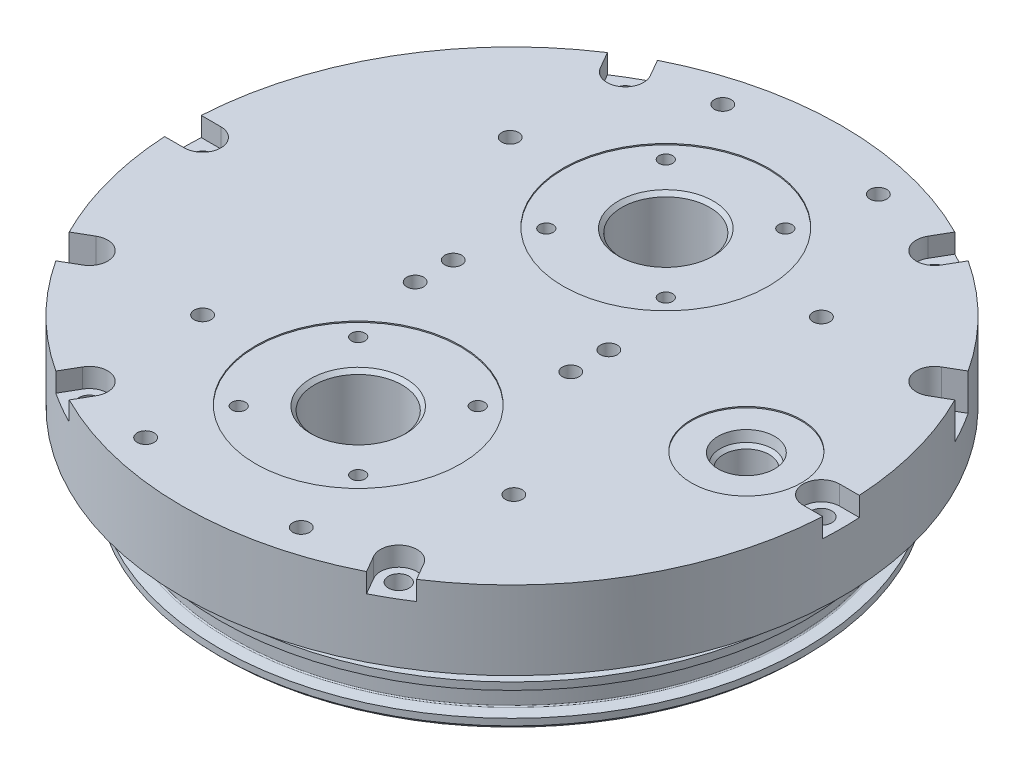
ISO-10303-21;
HEADER;
FILE_DESCRIPTION(('STEP AP214'),'2;1');
FILE_NAME('part.step','',(''),(''),'','','');
FILE_SCHEMA(('AUTOMOTIVE_DESIGN { 1 0 10303 214 1 1 1 1 }'));
ENDSEC;
DATA;
#1=APPLICATION_CONTEXT('core data for automotive mechanical design processes');
#2=APPLICATION_PROTOCOL_DEFINITION('international standard','automotive_design',2000,#1);
#3=PRODUCT_CONTEXT('',#1,'mechanical');
#4=PRODUCT('Part','Part','',(#3));
#5=PRODUCT_RELATED_PRODUCT_CATEGORY('part','',(#4));
#6=PRODUCT_DEFINITION_FORMATION('','',#4);
#7=PRODUCT_DEFINITION_CONTEXT('part definition',#1,'design');
#8=PRODUCT_DEFINITION('design','',#6,#7);
#9=PRODUCT_DEFINITION_SHAPE('','',#8);
#10=(LENGTH_UNIT() NAMED_UNIT(*) SI_UNIT(.MILLI.,.METRE.));
#11=(NAMED_UNIT(*) PLANE_ANGLE_UNIT() SI_UNIT($,.RADIAN.));
#12=(NAMED_UNIT(*) SI_UNIT($,.STERADIAN.) SOLID_ANGLE_UNIT());
#13=UNCERTAINTY_MEASURE_WITH_UNIT(LENGTH_MEASURE(1.E-05),#10,'distance_accuracy_value','');
#14=(GEOMETRIC_REPRESENTATION_CONTEXT(3) GLOBAL_UNCERTAINTY_ASSIGNED_CONTEXT((#13)) GLOBAL_UNIT_ASSIGNED_CONTEXT((#10,
#11,#12)) REPRESENTATION_CONTEXT('',''));
#15=CARTESIAN_POINT('',(0.,0.,0.));
#16=DIRECTION('',(0.,0.,1.));
#17=DIRECTION('',(1.,0.,0.));
#18=AXIS2_PLACEMENT_3D('',#15,#16,#17);
#19=CARTESIAN_POINT('',(58.0831979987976,17.018,-33.5343499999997));
#20=DIRECTION('',(0.,1.,0.));
#21=DIRECTION('',(0.,0.,1.));
#22=AXIS2_PLACEMENT_3D('',#19,#20,#21);
#23=CYLINDRICAL_SURFACE('',#22,1.8288);
#24=CARTESIAN_POINT('',(58.0831979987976,0.,-33.5343499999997));
#25=DIRECTION('',(0.,1.,0.));
#26=DIRECTION('',(0.,0.,1.));
#27=AXIS2_PLACEMENT_3D('',#24,#25,#26);
#28=CIRCLE('',#27,1.8288);
#29=CARTESIAN_POINT('',(58.0831979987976,0.,-31.7055499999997));
#30=VERTEX_POINT('',#29);
#31=EDGE_CURVE('E501',#30,#30,#28,.T.);
#32=ORIENTED_EDGE('',*,*,#31,.F.);
#33=EDGE_LOOP('',(#32));
#34=FACE_BOUND('',#33,.T.);
#35=CARTESIAN_POINT('',(58.0831979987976,9.0805,-33.5343499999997));
#36=DIRECTION('',(0.,1.,0.));
#37=DIRECTION('',(0.,0.,1.));
#38=AXIS2_PLACEMENT_3D('',#35,#36,#37);
#39=CIRCLE('',#38,1.8288);
#40=CARTESIAN_POINT('',(58.0831979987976,9.0805,-31.7055499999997));
#41=VERTEX_POINT('',#40);
#42=EDGE_CURVE('E461',#41,#41,#39,.F.);
#43=ORIENTED_EDGE('',*,*,#42,.F.);
#44=EDGE_LOOP('',(#43));
#45=FACE_BOUND('',#44,.T.);
#46=ADVANCED_FACE('F37',(#34,#45),#23,.F.);
#47=CARTESIAN_POINT('',(-58.0831979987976,17.018,33.5343499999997));
#48=DIRECTION('',(0.,1.,0.));
#49=DIRECTION('',(0.,0.,1.));
#50=AXIS2_PLACEMENT_3D('',#47,#48,#49);
#51=CYLINDRICAL_SURFACE('',#50,1.8288);
#52=CARTESIAN_POINT('',(-58.0831979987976,0.,33.5343499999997));
#53=DIRECTION('',(0.,1.,0.));
#54=DIRECTION('',(0.,0.,1.));
#55=AXIS2_PLACEMENT_3D('',#52,#53,#54);
#56=CIRCLE('',#55,1.8288);
#57=CARTESIAN_POINT('',(-58.0831979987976,0.,35.3631499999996));
#58=VERTEX_POINT('',#57);
#59=EDGE_CURVE('E498',#58,#58,#56,.T.);
#60=ORIENTED_EDGE('',*,*,#59,.F.);
#61=EDGE_LOOP('',(#60));
#62=FACE_BOUND('',#61,.T.);
#63=CARTESIAN_POINT('',(-58.0831979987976,9.0805,33.5343499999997));
#64=DIRECTION('',(0.,1.,0.));
#65=DIRECTION('',(0.,0.,1.));
#66=AXIS2_PLACEMENT_3D('',#63,#64,#65);
#67=CIRCLE('',#66,1.8288);
#68=CARTESIAN_POINT('',(-58.0831979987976,9.0805,35.3631499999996));
#69=VERTEX_POINT('',#68);
#70=EDGE_CURVE('E489',#69,#69,#67,.F.);
#71=ORIENTED_EDGE('',*,*,#70,.F.);
#72=EDGE_LOOP('',(#71));
#73=FACE_BOUND('',#72,.T.);
#74=ADVANCED_FACE('F970',(#62,#73),#51,.F.);
#75=CARTESIAN_POINT('',(33.5359375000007,17.018,-58.085947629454));
#76=DIRECTION('',(0.,1.,0.));
#77=DIRECTION('',(0.,0.,1.));
#78=AXIS2_PLACEMENT_3D('',#75,#76,#77);
#79=CYLINDRICAL_SURFACE('',#78,3.96875);
#80=DIRECTION('',(0.,1.,0.));
#81=VECTOR('',#80,1.);
#82=CARTESIAN_POINT('',(30.0988991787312,-11.8215457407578,-60.070322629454));
#83=LINE('',#82,#81);
#84=CARTESIAN_POINT('',(30.0988991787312,12.8524,-60.070322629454));
#85=VERTEX_POINT('',#84);
#86=CARTESIAN_POINT('',(30.0988991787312,17.018,-60.070322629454));
#87=VERTEX_POINT('',#86);
#88=EDGE_CURVE('E511',#85,#87,#83,.T.);
#89=ORIENTED_EDGE('',*,*,#88,.T.);
#90=CARTESIAN_POINT('',(33.5359375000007,17.018,-58.085947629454));
#91=DIRECTION('',(0.,1.,0.));
#92=DIRECTION('',(0.,0.,1.));
#93=AXIS2_PLACEMENT_3D('',#90,#91,#92);
#94=CIRCLE('',#93,3.96875);
#95=CARTESIAN_POINT('',(36.9729758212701,17.018,-56.101572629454));
#96=VERTEX_POINT('',#95);
#97=EDGE_CURVE('E630',#87,#96,#94,.T.);
#98=ORIENTED_EDGE('',*,*,#97,.T.);
#99=DIRECTION('',(0.,1.,0.));
#100=VECTOR('',#99,1.);
#101=CARTESIAN_POINT('',(36.9729758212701,-11.8215457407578,-56.101572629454));
#102=LINE('',#101,#100);
#103=CARTESIAN_POINT('',(36.9729758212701,12.8524,-56.101572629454));
#104=VERTEX_POINT('',#103);
#105=EDGE_CURVE('E516',#104,#96,#102,.T.);
#106=ORIENTED_EDGE('',*,*,#105,.F.);
#107=CARTESIAN_POINT('',(33.5359375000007,12.8524,-58.085947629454));
#108=DIRECTION('',(0.,1.,0.));
#109=DIRECTION('',(0.,0.,1.));
#110=AXIS2_PLACEMENT_3D('',#107,#108,#109);
#111=CIRCLE('',#110,3.96875);
#112=EDGE_CURVE('E627',#85,#104,#111,.T.);
#113=ORIENTED_EDGE('',*,*,#112,.F.);
#114=EDGE_LOOP('',(#89,#98,#106,#113));
#115=FACE_BOUND('',#114,.T.);
#116=ADVANCED_FACE('F973',(#115),#79,.F.);
#117=CARTESIAN_POINT('',(-33.5359374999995,17.018,-58.0859476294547));
#118=DIRECTION('',(0.,1.,0.));
#119=DIRECTION('',(0.,0.,1.));
#120=AXIS2_PLACEMENT_3D('',#117,#118,#119);
#121=CYLINDRICAL_SURFACE('',#120,3.96875);
#122=DIRECTION('',(0.,1.,0.));
#123=VECTOR('',#122,1.);
#124=CARTESIAN_POINT('',(-36.972975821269,-11.8215457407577,-56.1015726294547));
#125=LINE('',#124,#123);
#126=CARTESIAN_POINT('',(-36.972975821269,12.8524,-56.1015726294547));
#127=VERTEX_POINT('',#126);
#128=CARTESIAN_POINT('',(-36.972975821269,17.018,-56.1015726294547));
#129=VERTEX_POINT('',#128);
#130=EDGE_CURVE('E535',#127,#129,#125,.T.);
#131=ORIENTED_EDGE('',*,*,#130,.T.);
#132=CARTESIAN_POINT('',(-33.5359374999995,17.018,-58.0859476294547));
#133=DIRECTION('',(0.,1.,0.));
#134=DIRECTION('',(0.,0.,1.));
#135=AXIS2_PLACEMENT_3D('',#132,#133,#134);
#136=CIRCLE('',#135,3.96875);
#137=CARTESIAN_POINT('',(-30.09889917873,17.018,-60.0703226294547));
#138=VERTEX_POINT('',#137);
#139=EDGE_CURVE('E640',#129,#138,#136,.T.);
#140=ORIENTED_EDGE('',*,*,#139,.T.);
#141=DIRECTION('',(0.,1.,0.));
#142=VECTOR('',#141,1.);
#143=CARTESIAN_POINT('',(-30.09889917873,-11.8215457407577,-60.0703226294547));
#144=LINE('',#143,#142);
#145=CARTESIAN_POINT('',(-30.09889917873,12.8524,-60.0703226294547));
#146=VERTEX_POINT('',#145);
#147=EDGE_CURVE('E540',#146,#138,#144,.T.);
#148=ORIENTED_EDGE('',*,*,#147,.F.);
#149=CARTESIAN_POINT('',(-33.5359374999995,12.8524,-58.0859476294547));
#150=DIRECTION('',(0.,1.,0.));
#151=DIRECTION('',(0.,0.,1.));
#152=AXIS2_PLACEMENT_3D('',#149,#150,#151);
#153=CIRCLE('',#152,3.96875);
#154=EDGE_CURVE('E637',#127,#146,#153,.T.);
#155=ORIENTED_EDGE('',*,*,#154,.F.);
#156=EDGE_LOOP('',(#131,#140,#148,#155));
#157=FACE_BOUND('',#156,.T.);
#158=ADVANCED_FACE('F1028',(#157),#121,.F.);
#159=CARTESIAN_POINT('',(-67.071875,17.018,-4.60147006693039E-13));
#160=DIRECTION('',(0.,1.,0.));
#161=DIRECTION('',(0.,0.,1.));
#162=AXIS2_PLACEMENT_3D('',#159,#160,#161);
#163=CYLINDRICAL_SURFACE('',#162,3.96874999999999);
#164=DIRECTION('',(0.,1.,0.));
#165=VECTOR('',#164,1.);
#166=CARTESIAN_POINT('',(-67.071875,-8.24166352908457,3.96874999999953));
#167=LINE('',#166,#165);
#168=CARTESIAN_POINT('',(-67.071875,12.8524,3.96874999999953));
#169=VERTEX_POINT('',#168);
#170=CARTESIAN_POINT('',(-67.071875,17.018,3.96874999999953));
#171=VERTEX_POINT('',#170);
#172=EDGE_CURVE('E559',#169,#171,#167,.T.);
#173=ORIENTED_EDGE('',*,*,#172,.T.);
#174=CARTESIAN_POINT('',(-67.071875,17.018,-4.60147006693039E-13));
#175=DIRECTION('',(0.,1.,0.));
#176=DIRECTION('',(0.,0.,1.));
#177=AXIS2_PLACEMENT_3D('',#174,#175,#176);
#178=CIRCLE('',#177,3.96874999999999);
#179=CARTESIAN_POINT('',(-67.071875,17.018,-3.96875000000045));
#180=VERTEX_POINT('',#179);
#181=EDGE_CURVE('E650',#171,#180,#178,.T.);
#182=ORIENTED_EDGE('',*,*,#181,.T.);
#183=DIRECTION('',(0.,1.,0.));
#184=VECTOR('',#183,1.);
#185=CARTESIAN_POINT('',(-67.071875,-8.24166352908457,-3.96875000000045));
#186=LINE('',#185,#184);
#187=CARTESIAN_POINT('',(-67.071875,12.8524,-3.96875000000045));
#188=VERTEX_POINT('',#187);
#189=EDGE_CURVE('E564',#188,#180,#186,.T.);
#190=ORIENTED_EDGE('',*,*,#189,.F.);
#191=CARTESIAN_POINT('',(-67.071875,12.8524,-4.60147006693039E-13));
#192=DIRECTION('',(0.,1.,0.));
#193=DIRECTION('',(0.,0.,1.));
#194=AXIS2_PLACEMENT_3D('',#191,#192,#193);
#195=CIRCLE('',#194,3.96874999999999);
#196=EDGE_CURVE('E647',#169,#188,#195,.T.);
#197=ORIENTED_EDGE('',*,*,#196,.F.);
#198=EDGE_LOOP('',(#173,#182,#190,#197));
#199=FACE_BOUND('',#198,.T.);
#200=ADVANCED_FACE('F1040',(#199),#163,.F.);
#201=CARTESIAN_POINT('',(-33.5359375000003,17.018,58.0859476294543));
#202=DIRECTION('',(0.,1.,0.));
#203=DIRECTION('',(0.,0.,1.));
#204=AXIS2_PLACEMENT_3D('',#201,#202,#203);
#205=CYLINDRICAL_SURFACE('',#204,3.96875);
#206=DIRECTION('',(0.,1.,0.));
#207=VECTOR('',#206,1.);
#208=CARTESIAN_POINT('',(-30.0988991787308,-11.8215457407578,60.0703226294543));
#209=LINE('',#208,#207);
#210=CARTESIAN_POINT('',(-30.0988991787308,12.8524,60.0703226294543));
#211=VERTEX_POINT('',#210);
#212=CARTESIAN_POINT('',(-30.0988991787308,17.018,60.0703226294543));
#213=VERTEX_POINT('',#212);
#214=EDGE_CURVE('E583',#211,#213,#209,.T.);
#215=ORIENTED_EDGE('',*,*,#214,.T.);
#216=CARTESIAN_POINT('',(-33.5359375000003,17.018,58.0859476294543));
#217=DIRECTION('',(0.,1.,0.));
#218=DIRECTION('',(0.,0.,1.));
#219=AXIS2_PLACEMENT_3D('',#216,#217,#218);
#220=CIRCLE('',#219,3.96875);
#221=CARTESIAN_POINT('',(-36.9729758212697,17.018,56.1015726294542));
#222=VERTEX_POINT('',#221);
#223=EDGE_CURVE('E660',#213,#222,#220,.T.);
#224=ORIENTED_EDGE('',*,*,#223,.T.);
#225=DIRECTION('',(0.,1.,0.));
#226=VECTOR('',#225,1.);
#227=CARTESIAN_POINT('',(-36.9729758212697,-11.8215457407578,56.1015726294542));
#228=LINE('',#227,#226);
#229=CARTESIAN_POINT('',(-36.9729758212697,12.8524,56.1015726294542));
#230=VERTEX_POINT('',#229);
#231=EDGE_CURVE('E588',#230,#222,#228,.T.);
#232=ORIENTED_EDGE('',*,*,#231,.F.);
#233=CARTESIAN_POINT('',(-33.5359375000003,12.8524,58.0859476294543));
#234=DIRECTION('',(0.,1.,0.));
#235=DIRECTION('',(0.,0.,1.));
#236=AXIS2_PLACEMENT_3D('',#233,#234,#235);
#237=CIRCLE('',#236,3.96875);
#238=EDGE_CURVE('E657',#211,#230,#237,.T.);
#239=ORIENTED_EDGE('',*,*,#238,.F.);
#240=EDGE_LOOP('',(#215,#224,#232,#239));
#241=FACE_BOUND('',#240,.T.);
#242=ADVANCED_FACE('F1052',(#241),#205,.F.);
#243=CARTESIAN_POINT('',(33.5359374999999,17.018,58.0859476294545));
#244=DIRECTION('',(0.,1.,0.));
#245=DIRECTION('',(0.,0.,1.));
#246=AXIS2_PLACEMENT_3D('',#243,#244,#245);
#247=CYLINDRICAL_SURFACE('',#246,3.96875);
#248=DIRECTION('',(0.,1.,0.));
#249=VECTOR('',#248,1.);
#250=CARTESIAN_POINT('',(36.9729758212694,-11.8215457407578,56.1015726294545));
#251=LINE('',#250,#249);
#252=CARTESIAN_POINT('',(36.9729758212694,12.8524,56.1015726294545));
#253=VERTEX_POINT('',#252);
#254=CARTESIAN_POINT('',(36.9729758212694,17.018,56.1015726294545));
#255=VERTEX_POINT('',#254);
#256=EDGE_CURVE('E607',#253,#255,#251,.T.);
#257=ORIENTED_EDGE('',*,*,#256,.T.);
#258=CARTESIAN_POINT('',(33.5359374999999,17.018,58.0859476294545));
#259=DIRECTION('',(0.,1.,0.));
#260=DIRECTION('',(0.,0.,1.));
#261=AXIS2_PLACEMENT_3D('',#258,#259,#260);
#262=CIRCLE('',#261,3.96875);
#263=CARTESIAN_POINT('',(30.0988991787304,17.018,60.0703226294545));
#264=VERTEX_POINT('',#263);
#265=EDGE_CURVE('E670',#255,#264,#262,.T.);
#266=ORIENTED_EDGE('',*,*,#265,.T.);
#267=DIRECTION('',(0.,1.,0.));
#268=VECTOR('',#267,1.);
#269=CARTESIAN_POINT('',(30.0988991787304,-11.8215457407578,60.0703226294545));
#270=LINE('',#269,#268);
#271=CARTESIAN_POINT('',(30.0988991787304,12.8524,60.0703226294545));
#272=VERTEX_POINT('',#271);
#273=EDGE_CURVE('E612',#272,#264,#270,.T.);
#274=ORIENTED_EDGE('',*,*,#273,.F.);
#275=CARTESIAN_POINT('',(33.5359374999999,12.8524,58.0859476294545));
#276=DIRECTION('',(0.,1.,0.));
#277=DIRECTION('',(0.,0.,1.));
#278=AXIS2_PLACEMENT_3D('',#275,#276,#277);
#279=CIRCLE('',#278,3.96875);
#280=EDGE_CURVE('E667',#253,#272,#279,.T.);
#281=ORIENTED_EDGE('',*,*,#280,.F.);
#282=EDGE_LOOP('',(#257,#266,#274,#281));
#283=FACE_BOUND('',#282,.T.);
#284=ADVANCED_FACE('F1064',(#283),#247,.F.);
#285=CARTESIAN_POINT('',(67.071875,17.018,0.));
#286=DIRECTION('',(0.,1.,0.));
#287=DIRECTION('',(0.,0.,1.));
#288=AXIS2_PLACEMENT_3D('',#285,#286,#287);
#289=CYLINDRICAL_SURFACE('',#288,3.96874999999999);
#290=DIRECTION('',(0.,1.,0.));
#291=VECTOR('',#290,1.);
#292=CARTESIAN_POINT('',(67.071875,-8.24166352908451,-3.96875));
#293=LINE('',#292,#291);
#294=CARTESIAN_POINT('',(67.071875,12.8524,-3.96875));
#295=VERTEX_POINT('',#294);
#296=CARTESIAN_POINT('',(67.071875,17.018,-3.96875));
#297=VERTEX_POINT('',#296);
#298=EDGE_CURVE('E681',#295,#297,#293,.T.);
#299=ORIENTED_EDGE('',*,*,#298,.T.);
#300=CARTESIAN_POINT('',(67.071875,17.018,0.));
#301=DIRECTION('',(0.,1.,0.));
#302=DIRECTION('',(0.,0.,1.));
#303=AXIS2_PLACEMENT_3D('',#300,#301,#302);
#304=CIRCLE('',#303,3.96874999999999);
#305=CARTESIAN_POINT('',(67.071875,17.018,3.96874999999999));
#306=VERTEX_POINT('',#305);
#307=EDGE_CURVE('E704',#297,#306,#304,.T.);
#308=ORIENTED_EDGE('',*,*,#307,.T.);
#309=DIRECTION('',(0.,1.,0.));
#310=VECTOR('',#309,1.);
#311=CARTESIAN_POINT('',(67.071875,-8.24166352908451,3.96874999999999));
#312=LINE('',#311,#310);
#313=CARTESIAN_POINT('',(67.071875,12.8524,3.96874999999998));
#314=VERTEX_POINT('',#313);
#315=EDGE_CURVE('E686',#314,#306,#312,.T.);
#316=ORIENTED_EDGE('',*,*,#315,.F.);
#317=CARTESIAN_POINT('',(67.071875,12.8524,0.));
#318=DIRECTION('',(0.,1.,0.));
#319=DIRECTION('',(0.,0.,1.));
#320=AXIS2_PLACEMENT_3D('',#317,#318,#319);
#321=CIRCLE('',#320,3.96874999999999);
#322=EDGE_CURVE('E701',#295,#314,#321,.T.);
#323=ORIENTED_EDGE('',*,*,#322,.F.);
#324=EDGE_LOOP('',(#299,#308,#316,#323));
#325=FACE_BOUND('',#324,.T.);
#326=ADVANCED_FACE('F1076',(#325),#289,.F.);
#327=CARTESIAN_POINT('',(50.8,17.018,0.));
#328=DIRECTION('',(0.,1.,0.));
#329=DIRECTION('',(0.,0.,1.));
#330=AXIS2_PLACEMENT_3D('',#327,#328,#329);
#331=CONICAL_SURFACE('',#330,6.1849,0.20943951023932);
#332=CARTESIAN_POINT('',(50.8,14.6558,0.));
#333=DIRECTION('',(0.,1.,0.));
#334=DIRECTION('',(0.,0.,1.));
#335=AXIS2_PLACEMENT_3D('',#332,#333,#334);
#336=CIRCLE('',#335,5.68279889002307);
#337=CARTESIAN_POINT('',(50.8,14.6558,5.68279889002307));
#338=VERTEX_POINT('',#337);
#339=EDGE_CURVE('E721',#338,#338,#336,.T.);
#340=ORIENTED_EDGE('',*,*,#339,.F.);
#341=EDGE_LOOP('',(#340));
#342=FACE_BOUND('',#341,.T.);
#343=CARTESIAN_POINT('',(50.8,16.764,0.));
#344=DIRECTION('',(0.,1.,0.));
#345=DIRECTION('',(0.,0.,1.));
#346=AXIS2_PLACEMENT_3D('',#343,#344,#345);
#347=CIRCLE('',#346,6.13091063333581);
#348=CARTESIAN_POINT('',(50.8,16.764,6.13091063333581));
#349=VERTEX_POINT('',#348);
#350=EDGE_CURVE('E711',#349,#349,#347,.F.);
#351=ORIENTED_EDGE('',*,*,#350,.F.);
#352=EDGE_LOOP('',(#351));
#353=FACE_BOUND('',#352,.T.);
#354=ADVANCED_FACE('F1096',(#342,#353),#331,.F.);
#355=CARTESIAN_POINT('',(0.,-15.875,33.3375));
#356=DIRECTION('',(0.,1.,0.));
#357=DIRECTION('',(0.,0.,1.));
#358=AXIS2_PLACEMENT_3D('',#355,#356,#357);
#359=CYLINDRICAL_SURFACE('',#358,9.525);
#360=CARTESIAN_POINT('',(0.,15.97025,33.3375));
#361=DIRECTION('',(0.,1.,0.));
#362=DIRECTION('',(0.,0.,1.));
#363=AXIS2_PLACEMENT_3D('',#360,#361,#362);
#364=CIRCLE('',#363,9.525);
#365=CARTESIAN_POINT('',(0.,15.97025,42.8625));
#366=VERTEX_POINT('',#365);
#367=EDGE_CURVE('E861',#366,#366,#364,.T.);
#368=ORIENTED_EDGE('',*,*,#367,.T.);
#369=EDGE_LOOP('',(#368));
#370=FACE_BOUND('',#369,.T.);
#371=CARTESIAN_POINT('',(0.,0.,33.3375));
#372=DIRECTION('',(0.,1.,0.));
#373=DIRECTION('',(0.,0.,1.));
#374=AXIS2_PLACEMENT_3D('',#371,#372,#373);
#375=CIRCLE('',#374,9.525);
#376=CARTESIAN_POINT('',(0.,0.,42.8625));
#377=VERTEX_POINT('',#376);
#378=EDGE_CURVE('E788',#377,#377,#375,.T.);
#379=ORIENTED_EDGE('',*,*,#378,.F.);
#380=EDGE_LOOP('',(#379));
#381=FACE_BOUND('',#380,.T.);
#382=ADVANCED_FACE('F1112',(#370,#381),#359,.F.);
#383=CARTESIAN_POINT('',(0.,-15.875,-33.3375));
#384=DIRECTION('',(0.,1.,0.));
#385=DIRECTION('',(0.,0.,1.));
#386=AXIS2_PLACEMENT_3D('',#383,#384,#385);
#387=CYLINDRICAL_SURFACE('',#386,9.525);
#388=CARTESIAN_POINT('',(0.,15.97025,-33.3375));
#389=DIRECTION('',(0.,1.,0.));
#390=DIRECTION('',(0.,0.,1.));
#391=AXIS2_PLACEMENT_3D('',#388,#389,#390);
#392=CIRCLE('',#391,9.525);
#393=CARTESIAN_POINT('',(0.,15.97025,-23.8125));
#394=VERTEX_POINT('',#393);
#395=EDGE_CURVE('E867',#394,#394,#392,.T.);
#396=ORIENTED_EDGE('',*,*,#395,.T.);
#397=EDGE_LOOP('',(#396));
#398=FACE_BOUND('',#397,.T.);
#399=CARTESIAN_POINT('',(0.,0.,-33.3375));
#400=DIRECTION('',(0.,1.,0.));
#401=DIRECTION('',(0.,0.,1.));
#402=AXIS2_PLACEMENT_3D('',#399,#400,#401);
#403=CIRCLE('',#402,9.525);
#404=CARTESIAN_POINT('',(0.,0.,-23.8125));
#405=VERTEX_POINT('',#404);
#406=EDGE_CURVE('E795',#405,#405,#403,.T.);
#407=ORIENTED_EDGE('',*,*,#406,.F.);
#408=EDGE_LOOP('',(#407));
#409=FACE_BOUND('',#408,.T.);
#410=ADVANCED_FACE('F1209',(#398,#409),#387,.F.);
#411=CARTESIAN_POINT('',(0.,-15.875,0.));
#412=DIRECTION('',(0.,1.,0.));
#413=DIRECTION('',(0.,0.,1.));
#414=AXIS2_PLACEMENT_3D('',#411,#412,#413);
#415=CYLINDRICAL_SURFACE('',#414,63.4619);
#416=CARTESIAN_POINT('',(0.,-8.41146443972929,0.));
#417=DIRECTION('',(0.,-1.,0.));
#418=DIRECTION('',(0.,0.,-1.));
#419=AXIS2_PLACEMENT_3D('',#416,#417,#418);
#420=CIRCLE('',#419,63.4619);
#421=CARTESIAN_POINT('',(0.,-8.41146443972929,-63.4619));
#422=VERTEX_POINT('',#421);
#423=EDGE_CURVE('E807',#422,#422,#420,.T.);
#424=ORIENTED_EDGE('',*,*,#423,.F.);
#425=EDGE_LOOP('',(#424));
#426=FACE_BOUND('',#425,.T.);
#427=CARTESIAN_POINT('',(0.,-6.82396443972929,0.));
#428=DIRECTION('',(0.,-1.,0.));
#429=DIRECTION('',(0.,0.,-1.));
#430=AXIS2_PLACEMENT_3D('',#427,#428,#429);
#431=CIRCLE('',#430,63.4619);
#432=CARTESIAN_POINT('',(0.,-6.82396443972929,-63.4619));
#433=VERTEX_POINT('',#432);
#434=EDGE_CURVE('E825',#433,#433,#431,.T.);
#435=ORIENTED_EDGE('',*,*,#434,.T.);
#436=EDGE_LOOP('',(#435));
#437=FACE_BOUND('',#436,.T.);
#438=ADVANCED_FACE('F1213',(#426,#437),#415,.T.);
#439=CARTESIAN_POINT('',(0.,-1.5875,0.));
#440=DIRECTION('',(0.,-1.,0.));
#441=DIRECTION('',(0.,0.,-1.));
#442=AXIS2_PLACEMENT_3D('',#439,#440,#441);
#443=CIRCLE('',#442,63.4619);
#444=CARTESIAN_POINT('',(0.,-1.5875,-63.4619));
#445=VERTEX_POINT('',#444);
#446=EDGE_CURVE('E828',#445,#445,#443,.T.);
#447=ORIENTED_EDGE('',*,*,#446,.F.);
#448=EDGE_LOOP('',(#447));
#449=FACE_BOUND('',#448,.T.);
#450=CARTESIAN_POINT('',(0.,0.,0.));
#451=DIRECTION('',(0.,1.,0.));
#452=DIRECTION('',(0.,0.,1.));
#453=AXIS2_PLACEMENT_3D('',#450,#451,#452);
#454=CIRCLE('',#453,63.4619);
#455=CARTESIAN_POINT('',(0.,0.,63.4619));
#456=VERTEX_POINT('',#455);
#457=EDGE_CURVE('E835',#456,#456,#454,.F.);
#458=ORIENTED_EDGE('',*,*,#457,.T.);
#459=EDGE_LOOP('',(#458));
#460=FACE_BOUND('',#459,.T.);
#461=ADVANCED_FACE('F1273',(#449,#460),#415,.T.);
#462=CARTESIAN_POINT('',(0.,0.,0.));
#463=DIRECTION('',(0.,1.,0.));
#464=DIRECTION('',(0.,0.,1.));
#465=AXIS2_PLACEMENT_3D('',#462,#463,#464);
#466=PLANE('',#465);
#467=ORIENTED_EDGE('',*,*,#59,.T.);
#468=EDGE_LOOP('',(#467));
#469=FACE_BOUND('',#468,.T.);
#470=ORIENTED_EDGE('',*,*,#31,.T.);
#471=EDGE_LOOP('',(#470));
#472=FACE_BOUND('',#471,.T.);
#473=CARTESIAN_POINT('',(33.5359375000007,0.,-58.085947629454));
#474=DIRECTION('',(0.,1.,0.));
#475=DIRECTION('',(0.,0.,1.));
#476=AXIS2_PLACEMENT_3D('',#473,#474,#475);
#477=CIRCLE('',#476,2.2479);
#478=CARTESIAN_POINT('',(33.5359375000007,0.,-55.838047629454));
#479=VERTEX_POINT('',#478);
#480=EDGE_CURVE('E633',#479,#479,#477,.T.);
#481=ORIENTED_EDGE('',*,*,#480,.T.);
#482=EDGE_LOOP('',(#481));
#483=FACE_BOUND('',#482,.T.);
#484=CARTESIAN_POINT('',(-33.5359374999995,0.,-58.0859476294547));
#485=DIRECTION('',(0.,1.,0.));
#486=DIRECTION('',(0.,0.,1.));
#487=AXIS2_PLACEMENT_3D('',#484,#485,#486);
#488=CIRCLE('',#487,2.2479);
#489=CARTESIAN_POINT('',(-33.5359374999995,0.,-55.8380476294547));
#490=VERTEX_POINT('',#489);
#491=EDGE_CURVE('E643',#490,#490,#488,.T.);
#492=ORIENTED_EDGE('',*,*,#491,.T.);
#493=EDGE_LOOP('',(#492));
#494=FACE_BOUND('',#493,.T.);
#495=CARTESIAN_POINT('',(-67.071875,0.,-4.60147006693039E-13));
#496=DIRECTION('',(0.,1.,0.));
#497=DIRECTION('',(0.,0.,1.));
#498=AXIS2_PLACEMENT_3D('',#495,#496,#497);
#499=CIRCLE('',#498,2.2479);
#500=CARTESIAN_POINT('',(-67.071875,0.,2.24789999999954));
#501=VERTEX_POINT('',#500);
#502=EDGE_CURVE('E653',#501,#501,#499,.T.);
#503=ORIENTED_EDGE('',*,*,#502,.T.);
#504=EDGE_LOOP('',(#503));
#505=FACE_BOUND('',#504,.T.);
#506=CARTESIAN_POINT('',(-33.5359375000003,0.,58.0859476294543));
#507=DIRECTION('',(0.,1.,0.));
#508=DIRECTION('',(0.,0.,1.));
#509=AXIS2_PLACEMENT_3D('',#506,#507,#508);
#510=CIRCLE('',#509,2.2479);
#511=CARTESIAN_POINT('',(-33.5359375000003,0.,60.3338476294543));
#512=VERTEX_POINT('',#511);
#513=EDGE_CURVE('E663',#512,#512,#510,.T.);
#514=ORIENTED_EDGE('',*,*,#513,.T.);
#515=EDGE_LOOP('',(#514));
#516=FACE_BOUND('',#515,.T.);
#517=CARTESIAN_POINT('',(33.5359374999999,0.,58.0859476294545));
#518=DIRECTION('',(0.,1.,0.));
#519=DIRECTION('',(0.,0.,1.));
#520=AXIS2_PLACEMENT_3D('',#517,#518,#519);
#521=CIRCLE('',#520,2.2479);
#522=CARTESIAN_POINT('',(33.5359374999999,0.,60.3338476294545));
#523=VERTEX_POINT('',#522);
#524=EDGE_CURVE('E673',#523,#523,#521,.T.);
#525=ORIENTED_EDGE('',*,*,#524,.T.);
#526=EDGE_LOOP('',(#525));
#527=FACE_BOUND('',#526,.T.);
#528=CARTESIAN_POINT('',(67.071875,0.,0.));
#529=DIRECTION('',(0.,1.,0.));
#530=DIRECTION('',(0.,0.,1.));
#531=AXIS2_PLACEMENT_3D('',#528,#529,#530);
#532=CIRCLE('',#531,2.2479);
#533=CARTESIAN_POINT('',(67.071875,0.,2.24789999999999));
#534=VERTEX_POINT('',#533);
#535=EDGE_CURVE('E707',#534,#534,#532,.T.);
#536=ORIENTED_EDGE('',*,*,#535,.T.);
#537=EDGE_LOOP('',(#536));
#538=FACE_BOUND('',#537,.T.);
#539=CARTESIAN_POINT('',(0.,0.,0.));
#540=DIRECTION('',(0.,1.,0.));
#541=DIRECTION('',(0.,0.,1.));
#542=AXIS2_PLACEMENT_3D('',#539,#540,#541);
#543=CIRCLE('',#542,71.4375);
#544=CARTESIAN_POINT('',(0.,0.,71.4375));
#545=VERTEX_POINT('',#544);
#546=EDGE_CURVE('E831',#545,#545,#543,.T.);
#547=ORIENTED_EDGE('',*,*,#546,.F.);
#548=EDGE_LOOP('',(#547));
#549=FACE_BOUND('',#548,.T.);
#550=ORIENTED_EDGE('',*,*,#457,.F.);
#551=EDGE_LOOP('',(#550));
#552=FACE_BOUND('',#551,.T.);
#553=ADVANCED_FACE('F1276',(#469,#472,#483,#494,#505,#516,#527,#538,#549,#552),#466,.F.);
#554=CARTESIAN_POINT('',(0.,17.018,0.));
#555=DIRECTION('',(0.,-1.,0.));
#556=DIRECTION('',(0.,0.,-1.));
#557=AXIS2_PLACEMENT_3D('',#554,#555,#556);
#558=CYLINDRICAL_SURFACE('',#557,71.4375);
#559=CARTESIAN_POINT('',(-48.09950900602,10.668,-52.8181184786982));
#560=CARTESIAN_POINT('',(-48.0995041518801,10.5104117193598,-52.8181235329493));
#561=CARTESIAN_POINT('',(-48.0896579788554,10.3527107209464,-52.8270946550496));
#562=CARTESIAN_POINT('',(-48.0504902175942,10.0416563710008,-52.8627228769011));
#563=CARTESIAN_POINT('',(-48.0211454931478,9.88830841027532,-52.8894009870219));
#564=CARTESIAN_POINT('',(-47.9437369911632,9.59051125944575,-52.9595808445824));
#565=CARTESIAN_POINT('',(-47.8956825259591,9.44605768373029,-53.0030742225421));
#566=CARTESIAN_POINT('',(-47.7821049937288,9.17011378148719,-53.1054862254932));
#567=CARTESIAN_POINT('',(-47.7165861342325,9.03862034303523,-53.1644011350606));
#568=CARTESIAN_POINT('',(-47.5697312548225,8.79219999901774,-53.2958418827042));
#569=CARTESIAN_POINT('',(-47.4883859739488,8.67728286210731,-53.3683756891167));
#570=CARTESIAN_POINT('',(-47.3120338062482,8.46736003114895,-53.5247767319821));
#571=CARTESIAN_POINT('',(-47.2170263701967,8.37235513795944,-53.608644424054));
#572=CARTESIAN_POINT('',(-47.0158489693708,8.20493144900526,-53.7851674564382));
#573=CARTESIAN_POINT('',(-46.9096756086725,8.13251955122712,-53.8778254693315));
#574=CARTESIAN_POINT('',(-46.6890639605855,8.01238184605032,-54.0691132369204));
#575=CARTESIAN_POINT('',(-46.5746257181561,7.96465590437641,-54.1677429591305));
#576=CARTESIAN_POINT('',(-46.3406979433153,7.89526872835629,-54.368003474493));
#577=CARTESIAN_POINT('',(-46.2212110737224,7.87359392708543,-54.4696326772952));
#578=CARTESIAN_POINT('',(-45.9804794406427,7.85688246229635,-54.6729982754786));
#579=CARTESIAN_POINT('',(-45.8592346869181,7.86184565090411,-54.7747346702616));
#580=CARTESIAN_POINT('',(-45.618510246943,7.89825793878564,-54.9753806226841));
#581=CARTESIAN_POINT('',(-45.4990296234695,7.92969241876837,-55.0742917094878));
#582=CARTESIAN_POINT('',(-45.2652205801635,8.01813234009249,-55.2666186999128));
#583=CARTESIAN_POINT('',(-45.150892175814,8.07513785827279,-55.3600345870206));
#584=CARTESIAN_POINT('',(-44.930710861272,8.21311841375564,-55.5388852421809));
#585=CARTESIAN_POINT('',(-44.8248603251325,8.29410013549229,-55.6243177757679));
#586=CARTESIAN_POINT('',(-44.6248166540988,8.47772940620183,-55.7849319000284));
#587=CARTESIAN_POINT('',(-44.5306235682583,8.58037704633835,-55.8601134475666));
#588=CARTESIAN_POINT('',(-44.3566701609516,8.80450706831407,-55.9983446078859));
#589=CARTESIAN_POINT('',(-44.2769196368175,8.92600213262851,-56.0613859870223));
#590=CARTESIAN_POINT('',(-44.1343600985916,9.18433355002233,-56.1736853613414));
#591=CARTESIAN_POINT('',(-44.0715510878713,9.32116990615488,-56.2229433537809));
#592=CARTESIAN_POINT('',(-43.9648073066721,9.6063070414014,-56.3064538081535));
#593=CARTESIAN_POINT('',(-43.9208728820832,9.75460803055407,-56.3407059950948));
#594=CARTESIAN_POINT('',(-43.8532446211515,10.0584613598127,-56.3933612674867));
#595=CARTESIAN_POINT('',(-43.8295506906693,10.214013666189,-56.4117644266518));
#596=CARTESIAN_POINT('',(-43.8031520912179,10.5278426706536,-56.4322652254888));
#597=CARTESIAN_POINT('',(-43.8004333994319,10.6861174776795,-56.4343737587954));
#598=CARTESIAN_POINT('',(-43.8160333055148,11.0009965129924,-56.4222626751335));
#599=CARTESIAN_POINT('',(-43.834351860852,11.1576007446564,-56.4080430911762));
#600=CARTESIAN_POINT('',(-43.8914451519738,11.4646435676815,-56.3636296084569));
#601=CARTESIAN_POINT('',(-43.9302135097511,11.6150840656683,-56.3334406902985));
#602=CARTESIAN_POINT('',(-44.0269987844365,11.905587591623,-56.257830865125));
#603=CARTESIAN_POINT('',(-44.0850157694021,12.0456505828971,-56.2124099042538));
#604=CARTESIAN_POINT('',(-44.2185468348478,12.3115049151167,-56.1074300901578));
#605=CARTESIAN_POINT('',(-44.294070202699,12.4372886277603,-56.0478637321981));
#606=CARTESIAN_POINT('',(-44.4602915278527,12.6709371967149,-55.9160987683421));
#607=CARTESIAN_POINT('',(-44.5509895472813,12.7788019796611,-55.8439001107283));
#608=CARTESIAN_POINT('',(-44.7448748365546,12.9736101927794,-55.6886701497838));
#609=CARTESIAN_POINT('',(-44.8480688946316,13.0605421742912,-55.6056329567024));
#610=CARTESIAN_POINT('',(-45.0638240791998,13.210938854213,-55.430924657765));
#611=CARTESIAN_POINT('',(-45.1763851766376,13.2744036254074,-55.3392535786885));
#612=CARTESIAN_POINT('',(-45.4075205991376,13.3760442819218,-55.1497578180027));
#613=CARTESIAN_POINT('',(-45.5260931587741,13.4142275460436,-55.0519349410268));
#614=CARTESIAN_POINT('',(-45.7658334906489,13.4642454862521,-54.85279541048));
#615=CARTESIAN_POINT('',(-45.8870012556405,13.4760802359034,-54.7514787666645));
#616=CARTESIAN_POINT('',(-46.1283798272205,13.4730643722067,-54.5482708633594));
#617=CARTESIAN_POINT('',(-46.2485912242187,13.4582317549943,-54.4463800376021));
#618=CARTESIAN_POINT('',(-46.4847590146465,13.4023393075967,-54.2448863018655));
#619=CARTESIAN_POINT('',(-46.6007153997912,13.3612794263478,-54.1452833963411));
#620=CARTESIAN_POINT('',(-46.8251707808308,13.2541011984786,-53.951291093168));
#621=CARTESIAN_POINT('',(-46.9336696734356,13.1879825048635,-53.8569017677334));
#622=CARTESIAN_POINT('',(-47.1402610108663,13.0325677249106,-53.6761684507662));
#623=CARTESIAN_POINT('',(-47.238353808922,12.9432724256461,-53.5898241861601));
#624=CARTESIAN_POINT('',(-47.4215727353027,12.7439787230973,-53.4277628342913));
#625=CARTESIAN_POINT('',(-47.5066914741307,12.63396860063,-53.352051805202));
#626=CARTESIAN_POINT('',(-47.661674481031,12.3963602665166,-53.2136450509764));
#627=CARTESIAN_POINT('',(-47.7315349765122,12.2687577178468,-53.1509525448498));
#628=CARTESIAN_POINT('',(-47.8542014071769,11.9995166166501,-53.040537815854));
#629=CARTESIAN_POINT('',(-47.9069941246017,11.8578672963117,-52.9928271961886));
#630=CARTESIAN_POINT('',(-47.9940387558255,11.5647379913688,-52.9140069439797));
#631=CARTESIAN_POINT('',(-48.0283126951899,11.4132699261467,-52.8828775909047));
#632=CARTESIAN_POINT('',(-48.0683993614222,11.1620427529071,-52.8464359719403));
#633=CARTESIAN_POINT('',(-48.0800519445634,11.0639129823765,-52.8358318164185));
#634=CARTESIAN_POINT('',(-48.0956082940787,10.8665370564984,-52.821671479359));
#635=CARTESIAN_POINT('',(-48.099512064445,10.7672909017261,-52.8181152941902));
#636=CARTESIAN_POINT('',(-48.09950900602,10.668,-52.8181184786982));
#637=B_SPLINE_CURVE_WITH_KNOTS('',3,(#559,#560,#561,#562,#563,#564,#565,#566,#567,#568,#569,
#570,#571,#572,#573,#574,#575,#576,#577,#578,#579,#580,#581,#582,#583,#584,#585,#586,#587,#588,
#589,#590,#591,#592,#593,#594,#595,#596,#597,#598,#599,#600,#601,#602,#603,#604,#605,#606,#607,
#608,#609,#610,#611,#612,#613,#614,#615,#616,#617,#618,#619,#620,#621,#622,#623,#624,#625,#626,
#627,#628,#629,#630,#631,#632,#633,#634,#635,#636),.UNSPECIFIED.,.T.,.F.,(4,2,2,2,2,2,2,2,2,2,2,
2,2,2,2,2,2,2,2,2,2,2,2,2,2,2,2,2,2,2,2,2,2,2,2,2,2,2,4),(0.,0.472402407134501,
0.945366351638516,1.41809518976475,1.89071024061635,2.36360268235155,2.83651413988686,
3.30956984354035,3.78262297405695,4.25542964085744,4.72823368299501,5.20077678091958,
5.67332129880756,6.14599768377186,6.61867605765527,7.09167388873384,7.56467181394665,
8.03767840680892,8.51068279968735,8.98337094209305,9.45605812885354,9.92859797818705,
10.4011394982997,10.8739322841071,11.3467270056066,11.819779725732,12.2928309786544,
12.7657441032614,13.2386559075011,13.7112486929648,14.1838423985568,14.6564426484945,
15.1290268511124,15.6018792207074,16.0748483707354,16.5481829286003,17.0209532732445,
17.318597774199,17.6162421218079),.UNSPECIFIED.);
#638=CARTESIAN_POINT('',(-48.09950900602,10.668,-52.8181184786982));
#639=VERTEX_POINT('',#638);
#640=EDGE_CURVE('E11',#639,#639,#637,.T.);
#641=ORIENTED_EDGE('',*,*,#640,.T.);
#642=EDGE_LOOP('',(#641));
#643=FACE_BOUND('',#642,.T.);
#644=CARTESIAN_POINT('',(-63.263614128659,10.668,-33.1817952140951));
#645=CARTESIAN_POINT('',(-63.2636112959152,10.5104117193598,-33.1818016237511));
#646=CARTESIAN_POINT('',(-63.2574272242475,10.3527107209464,-33.1935993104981));
#647=CARTESIAN_POINT('',(-63.2328071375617,10.0416563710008,-33.240475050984));
#648=CARTESIAN_POINT('',(-63.2143565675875,9.88830841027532,-33.275580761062));
#649=CARTESIAN_POINT('',(-63.165619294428,9.59051125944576,-33.3680035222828));
#650=CARTESIAN_POINT('',(-63.1353384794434,9.44605768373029,-33.4253095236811));
#651=CARTESIAN_POINT('',(-63.0636374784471,9.17011378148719,-33.5603911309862));
#652=CARTESIAN_POINT('',(-63.0222199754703,9.03862034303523,-33.6381618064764));
#653=CARTESIAN_POINT('',(-62.9291769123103,8.79219999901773,-33.8119030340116));
#654=CARTESIAN_POINT('',(-62.8775453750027,8.6772828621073,-33.9078842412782));
#655=CARTESIAN_POINT('',(-62.765320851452,8.46736003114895,-34.1151691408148));
#656=CARTESIAN_POINT('',(-62.7047275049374,8.37235513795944,-34.2264734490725));
#657=CARTESIAN_POINT('',(-62.5760570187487,8.20493144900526,-34.461157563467));
#658=CARTESIAN_POINT('',(-62.5079776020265,8.13251955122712,-34.5845410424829));
#659=CARTESIAN_POINT('',(-62.3660947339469,8.01238184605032,-34.8397463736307));
#660=CARTESIAN_POINT('',(-62.2922913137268,7.96465590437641,-34.9715681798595));
#661=CARTESIAN_POINT('',(-62.1409642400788,7.89526872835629,-35.2397595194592));
#662=CARTESIAN_POINT('',(-62.06344254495,7.87359392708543,-35.3761266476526));
#663=CARTESIAN_POINT('',(-61.9067839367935,7.85688246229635,-35.6495628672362));
#664=CARTESIAN_POINT('',(-61.8276470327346,7.86184565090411,-35.7866319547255));
#665=CARTESIAN_POINT('',(-61.6700650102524,7.89825793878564,-36.0575100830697));
#666=CARTESIAN_POINT('',(-61.5916195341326,7.92969241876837,-36.1913208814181));
#667=CARTESIAN_POINT('',(-61.4376906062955,8.01813234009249,-36.4520165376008));
#668=CARTESIAN_POINT('',(-61.3622071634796,8.07513785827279,-36.578901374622));
#669=CARTESIAN_POINT('',(-61.2164749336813,8.21311841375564,-36.8222724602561));
#670=CARTESIAN_POINT('',(-61.1462276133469,8.29410013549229,-36.9387557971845));
#671=CARTESIAN_POINT('',(-61.0131813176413,8.47772940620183,-37.1581026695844));
#672=CARTESIAN_POINT('',(-60.9503823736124,8.58037704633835,-37.2609661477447));
#673=CARTESIAN_POINT('',(-60.8341974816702,8.80450706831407,-37.4503565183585));
#674=CARTESIAN_POINT('',(-60.7808179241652,8.92600213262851,-37.5368723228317));
#675=CARTESIAN_POINT('',(-60.6852644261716,9.18433355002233,-37.6911574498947));
#676=CARTESIAN_POINT('',(-60.6430904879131,9.32116990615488,-37.7589267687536));
#677=CARTESIAN_POINT('',(-60.5713464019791,9.6063070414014,-37.8739094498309));
#678=CARTESIAN_POINT('',(-60.5417764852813,9.75460803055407,-37.9211224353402));
#679=CARTESIAN_POINT('',(-60.4962358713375,10.0584613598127,-37.9937324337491));
#680=CARTESIAN_POINT('',(-60.4802651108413,10.214013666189,-38.0191295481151));
#681=CARTESIAN_POINT('',(-60.4624702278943,10.5278426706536,-38.0474228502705));
#682=CARTESIAN_POINT('',(-60.4606366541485,10.6861174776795,-38.0503340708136));
#683=CARTESIAN_POINT('',(-60.4711535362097,11.0009965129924,-38.0336178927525));
#684=CARTESIAN_POINT('',(-60.4835039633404,11.1576007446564,-38.0139905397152));
#685=CARTESIAN_POINT('',(-60.5219638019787,11.4646435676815,-37.9527284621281));
#686=CARTESIAN_POINT('',(-60.5480689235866,11.6150840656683,-37.9111005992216));
#687=CARTESIAN_POINT('',(-60.6131572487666,11.905587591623,-37.8069480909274));
#688=CARTESIAN_POINT('',(-60.6521404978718,12.0456505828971,-37.7444233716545));
#689=CARTESIAN_POINT('',(-60.7417134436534,12.3115049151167,-37.6001043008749));
#690=CARTESIAN_POINT('',(-60.7923093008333,12.4372886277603,-37.5182997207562));
#691=CARTESIAN_POINT('',(-60.9034399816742,12.6709371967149,-37.3376301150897));
#692=CARTESIAN_POINT('',(-60.9639748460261,12.7788019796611,-37.238765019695));
#693=CARTESIAN_POINT('',(-61.0930756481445,12.9736101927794,-37.0265838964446));
#694=CARTESIAN_POINT('',(-61.1616459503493,13.0605421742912,-36.9132600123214));
#695=CARTESIAN_POINT('',(-61.3046357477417,13.210938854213,-36.6752952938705));
#696=CARTESIAN_POINT('',(-61.3790552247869,13.2744036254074,-36.5506544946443));
#697=CARTESIAN_POINT('',(-61.5314401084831,13.3760442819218,-36.2935337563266));
#698=CARTESIAN_POINT('',(-61.6094044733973,13.4142275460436,-36.1610561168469));
#699=CARTESIAN_POINT('',(-61.7665769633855,13.4642454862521,-35.8919301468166));
#700=CARTESIAN_POINT('',(-61.8457850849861,13.4760802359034,-35.7552818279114));
#701=CARTESIAN_POINT('',(-62.0031055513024,13.4730643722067,-35.4817725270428));
#702=CARTESIAN_POINT('',(-62.0812185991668,13.4582317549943,-35.3449117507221));
#703=CARTESIAN_POINT('',(-62.2342288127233,13.4023393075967,-35.0747954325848));
#704=CARTESIAN_POINT('',(-62.3091259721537,13.3612794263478,-34.941539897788));
#705=CARTESIAN_POINT('',(-62.453695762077,13.2541011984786,-34.6824785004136));
#706=CARTESIAN_POINT('',(-62.5233683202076,13.1879825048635,-34.5566727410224));
#707=CARTESIAN_POINT('',(-62.6556862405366,13.0325677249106,-34.3161805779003));
#708=CARTESIAN_POINT('',(-62.7183318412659,12.9432724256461,-34.2014937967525));
#709=CARTESIAN_POINT('',(-62.8350730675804,12.7439787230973,-33.986541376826));
#710=CARTESIAN_POINT('',(-62.8891638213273,12.63396860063,-33.8862839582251));
#711=CARTESIAN_POINT('',(-62.9874623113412,12.3963602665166,-33.7032168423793));
#712=CARTESIAN_POINT('',(-63.0316676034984,12.2687577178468,-33.6204114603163));
#713=CARTESIAN_POINT('',(-63.1091722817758,11.9995166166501,-33.4747011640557));
#714=CARTESIAN_POINT('',(-63.142463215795,11.8578672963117,-33.4118116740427));
#715=CARTESIAN_POINT('',(-63.1973002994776,11.5647379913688,-33.3079738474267));
#716=CARTESIAN_POINT('',(-63.2188604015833,11.4132699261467,-33.2669994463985));
#717=CARTESIAN_POINT('',(-63.2440657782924,11.1620427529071,-33.2190450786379));
#718=CARTESIAN_POINT('',(-63.2513887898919,11.0639129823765,-33.2050950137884));
#719=CARTESIAN_POINT('',(-63.2611638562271,10.8665370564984,-33.1864680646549));
#720=CARTESIAN_POINT('',(-63.2636159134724,10.7672909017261,-33.1817911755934));
#721=CARTESIAN_POINT('',(-63.263614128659,10.668,-33.1817952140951));
#722=B_SPLINE_CURVE_WITH_KNOTS('',3,(#644,#645,#646,#647,#648,#649,#650,#651,#652,#653,#654,
#655,#656,#657,#658,#659,#660,#661,#662,#663,#664,#665,#666,#667,#668,#669,#670,#671,#672,#673,
#674,#675,#676,#677,#678,#679,#680,#681,#682,#683,#684,#685,#686,#687,#688,#689,#690,#691,#692,
#693,#694,#695,#696,#697,#698,#699,#700,#701,#702,#703,#704,#705,#706,#707,#708,#709,#710,#711,
#712,#713,#714,#715,#716,#717,#718,#719,#720,#721),.UNSPECIFIED.,.T.,.F.,(4,2,2,2,2,2,2,2,2,2,2,
2,2,2,2,2,2,2,2,2,2,2,2,2,2,2,2,2,2,2,2,2,2,2,2,2,2,2,4),(0.,0.4724024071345,0.94536635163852,
1.41809518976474,1.89071024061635,2.36360268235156,2.83651413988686,3.30956984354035,
3.78262297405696,4.25542964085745,4.72823368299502,5.20077678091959,5.67332129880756,
6.14599768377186,6.61867605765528,7.09167388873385,7.56467181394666,8.03767840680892,
8.51068279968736,8.98337094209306,9.45605812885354,9.92859797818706,10.4011394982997,
10.873932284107,11.3467270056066,11.819779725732,12.2928309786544,12.7657441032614,
13.2386559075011,13.7112486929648,14.1838423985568,14.6564426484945,15.1290268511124,
15.6018792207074,16.0748483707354,16.5481829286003,17.0209532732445,17.318597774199,
17.6162421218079),.UNSPECIFIED.);
#723=CARTESIAN_POINT('',(-63.263614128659,10.668,-33.1817952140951));
#724=VERTEX_POINT('',#723);
#725=EDGE_CURVE('E49',#724,#724,#722,.T.);
#726=ORIENTED_EDGE('',*,*,#725,.T.);
#727=EDGE_LOOP('',(#726));
#728=FACE_BOUND('',#727,.T.);
#729=CARTESIAN_POINT('',(-70.7971937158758,10.668,-9.54325773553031));
#730=CARTESIAN_POINT('',(-70.7971932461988,10.5104117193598,-9.54326472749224));
#731=CARTESIAN_POINT('',(-70.7954171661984,10.3527107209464,-9.55646600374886));
#732=CARTESIAN_POINT('',(-70.7883142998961,10.0416563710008,-9.60893535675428));
#733=CARTESIAN_POINT('',(-70.7829832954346,9.88830841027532,-9.64823440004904));
#734=CARTESIAN_POINT('',(-70.7687956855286,9.59051125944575,-9.75175251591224));
#735=CARTESIAN_POINT('',(-70.7599408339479,9.44605768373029,-9.81595919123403));
#736=CARTESIAN_POINT('',(-70.7387645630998,9.17011378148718,-9.96741756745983));
#737=CARTESIAN_POINT('',(-70.7264439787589,9.03862034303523,-10.0546637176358));
#738=CARTESIAN_POINT('',(-70.6984350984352,8.79219999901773,-10.2497496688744));
#739=CARTESIAN_POINT('',(-70.6827448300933,8.6772828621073,-10.357601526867));
#740=CARTESIAN_POINT('',(-70.6481838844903,8.46736003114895,-10.5907686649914));
#741=CARTESIAN_POINT('',(-70.6293130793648,8.37235513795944,-10.7160846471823));
#742=CARTESIAN_POINT('',(-70.5886690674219,8.20493144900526,-10.9806234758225));
#743=CARTESIAN_POINT('',(-70.5668949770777,8.13251955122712,-11.1198505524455));
#744=CARTESIAN_POINT('',(-70.520854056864,8.01238184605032,-11.4081919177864));
#745=CARTESIAN_POINT('',(-70.4965872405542,7.96465590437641,-11.5573061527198));
#746=CARTESIAN_POINT('',(-70.4461131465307,7.89526872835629,-11.8610804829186));
#747=CARTESIAN_POINT('',(-70.4199068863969,7.87359392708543,-12.0157376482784));
#748=CARTESIAN_POINT('',(-70.366216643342,7.85688246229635,-12.3262640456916));
#749=CARTESIAN_POINT('',(-70.3387326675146,7.86184565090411,-12.4821332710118));
#750=CARTESIAN_POINT('',(-70.2832997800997,7.89825793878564,-12.790571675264));
#751=CARTESIAN_POINT('',(-70.2553511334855,7.92969241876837,-12.9431426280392));
#752=CARTESIAN_POINT('',(-70.1998684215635,8.01813234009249,-13.2407632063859));
#753=CARTESIAN_POINT('',(-70.1723343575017,8.07513785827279,-13.3858128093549));
#754=CARTESIAN_POINT('',(-70.1186286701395,8.21311841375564,-13.6643501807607));
#755=CARTESIAN_POINT('',(-70.0924574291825,8.29410013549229,-13.7978347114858));
#756=CARTESIAN_POINT('',(-70.0424558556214,8.47772940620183,-14.0494578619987));
#757=CARTESIAN_POINT('',(-70.0186255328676,8.58037704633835,-14.1675964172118));
#758=CARTESIAN_POINT('',(-69.9742227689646,8.80450706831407,-14.3853027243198));
#759=CARTESIAN_POINT('',(-69.9536525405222,8.92600213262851,-14.4848578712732));
#760=CARTESIAN_POINT('',(-69.9166302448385,9.18433355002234,-14.6625196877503));
#761=CARTESIAN_POINT('',(-69.9001781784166,9.32116990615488,-14.7406263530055));
#762=CARTESIAN_POINT('',(-69.8720871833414,9.6063070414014,-14.8732126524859));
#763=CARTESIAN_POINT('',(-69.860448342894,9.75460803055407,-14.9276918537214));
#764=CARTESIAN_POINT('',(-69.8424882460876,10.0584613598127,-15.0114987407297));
#765=CARTESIAN_POINT('',(-69.8361669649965,10.214013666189,-15.0408265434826));
#766=CARTESIAN_POINT('',(-69.8291221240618,10.5278426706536,-15.0734997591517));
#767=CARTESIAN_POINT('',(-69.8283948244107,10.6861174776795,-15.0768625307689));
#768=CARTESIAN_POINT('',(-69.8325601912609,11.0009965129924,-15.0575574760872));
#769=CARTESIAN_POINT('',(-69.8374528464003,11.1576007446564,-15.0348897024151));
#770=CARTESIAN_POINT('',(-69.8526404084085,11.4646435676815,-14.9641681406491));
#771=CARTESIAN_POINT('',(-69.8629336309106,11.6150840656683,-14.916122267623));
#772=CARTESIAN_POINT('',(-69.888474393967,11.905587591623,-14.7959894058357));
#773=CARTESIAN_POINT('',(-69.9037219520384,12.0456505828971,-14.723902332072));
#774=CARTESIAN_POINT('',(-69.9385329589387,12.3115049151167,-14.5576510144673));
#775=CARTESIAN_POINT('',(-69.9580986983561,12.4372886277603,-14.4634750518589));
#776=CARTESIAN_POINT('',(-70.0007347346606,12.6709371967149,-14.2556922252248));
#777=CARTESIAN_POINT('',(-70.0238050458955,12.7788019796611,-14.1420852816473));
#778=CARTESIAN_POINT('',(-70.0725498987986,12.9736101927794,-13.8985451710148));
#779=CARTESIAN_POINT('',(-70.0982258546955,13.0605421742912,-13.7686031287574));
#780=CARTESIAN_POINT('',(-70.1512035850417,13.210938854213,-13.4960840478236));
#781=CARTESIAN_POINT('',(-70.1785053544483,13.2744036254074,-13.3535070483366));
#782=CARTESIAN_POINT('',(-70.2337598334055,13.3760442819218,-13.0597738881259));
#783=CARTESIAN_POINT('',(-70.2617123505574,13.4142275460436,-12.9086202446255));
#784=CARTESIAN_POINT('',(-70.3173596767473,13.4642454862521,-12.6019683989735));
#785=CARTESIAN_POINT('',(-70.3450544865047,13.4760802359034,-12.4464702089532));
#786=CARTESIAN_POINT('',(-70.3993416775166,13.4730643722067,-12.135648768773));
#787=CARTESIAN_POINT('',(-70.4259347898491,13.4582317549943,-11.9803254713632));
#788=CARTESIAN_POINT('',(-70.477332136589,13.4023393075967,-11.6741665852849));
#789=CARTESIAN_POINT('',(-70.5021363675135,13.3612794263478,-11.5233310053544));
#790=CARTESIAN_POINT('',(-70.5493833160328,13.2541011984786,-11.230447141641));
#791=CARTESIAN_POINT('',(-70.5718260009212,13.1879825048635,-11.0883989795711));
#792=CARTESIAN_POINT('',(-70.6139110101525,13.0325677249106,-10.8171548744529));
#793=CARTESIAN_POINT('',(-70.6335534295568,12.9432724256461,-10.6879584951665));
#794=CARTESIAN_POINT('',(-70.6697362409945,12.7439787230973,-10.4460414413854));
#795=CARTESIAN_POINT('',(-70.6862748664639,12.63396860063,-10.333330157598));
#796=CARTESIAN_POINT('',(-70.7160325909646,12.3963602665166,-10.1276832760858));
#797=CARTESIAN_POINT('',(-70.729250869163,12.2687577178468,-10.0347525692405));
#798=CARTESIAN_POINT('',(-70.7522455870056,11.9995166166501,-9.87132151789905));
#799=CARTESIAN_POINT('',(-70.7620193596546,11.8578672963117,-9.80083855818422));
#800=CARTESIAN_POINT('',(-70.7780347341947,11.5647379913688,-9.684507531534));
#801=CARTESIAN_POINT('',(-70.7842805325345,11.4132699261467,-9.6386302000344));
#802=CARTESIAN_POINT('',(-70.7915644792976,11.1620427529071,-9.58494708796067));
#803=CARTESIAN_POINT('',(-70.7936746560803,11.0639129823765,-9.56933369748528));
#804=CARTESIAN_POINT('',(-70.7964894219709,10.8665370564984,-9.54848682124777));
#805=CARTESIAN_POINT('',(-70.7971940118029,10.7672909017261,-9.54325333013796));
#806=CARTESIAN_POINT('',(-70.7971937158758,10.668,-9.54325773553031));
#807=B_SPLINE_CURVE_WITH_KNOTS('',3,(#729,#730,#731,#732,#733,#734,#735,#736,#737,#738,#739,
#740,#741,#742,#743,#744,#745,#746,#747,#748,#749,#750,#751,#752,#753,#754,#755,#756,#757,#758,
#759,#760,#761,#762,#763,#764,#765,#766,#767,#768,#769,#770,#771,#772,#773,#774,#775,#776,#777,
#778,#779,#780,#781,#782,#783,#784,#785,#786,#787,#788,#789,#790,#791,#792,#793,#794,#795,#796,
#797,#798,#799,#800,#801,#802,#803,#804,#805,#806),.UNSPECIFIED.,.T.,.F.,(4,2,2,2,2,2,2,2,2,2,2,
2,2,2,2,2,2,2,2,2,2,2,2,2,2,2,2,2,2,2,2,2,2,2,2,2,2,2,4),(0.,0.472402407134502,
0.945366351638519,1.41809518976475,1.89071024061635,2.36360268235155,2.83651413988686,
3.30956984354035,3.78262297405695,4.25542964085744,4.72823368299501,5.20077678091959,
5.67332129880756,6.14599768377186,6.61867605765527,7.09167388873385,7.56467181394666,
8.03767840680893,8.51068279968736,8.98337094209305,9.45605812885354,9.92859797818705,
10.4011394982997,10.8739322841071,11.3467270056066,11.819779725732,12.2928309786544,
12.7657441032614,13.2386559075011,13.7112486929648,14.1838423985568,14.6564426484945,
15.1290268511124,15.6018792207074,16.0748483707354,16.5481829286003,17.0209532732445,
17.318597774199,17.6162421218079),.UNSPECIFIED.);
#808=CARTESIAN_POINT('',(-70.7971937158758,10.668,-9.54325773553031));
#809=VERTEX_POINT('',#808);
#810=EDGE_CURVE('E870',#809,#809,#807,.T.);
#811=ORIENTED_EDGE('',*,*,#810,.T.);
#812=EDGE_LOOP('',(#811));
#813=FACE_BOUND('',#812,.T.);
#814=CARTESIAN_POINT('',(0.,17.018,0.));
#815=DIRECTION('',(0.,1.,0.));
#816=DIRECTION('',(0.,0.,1.));
#817=AXIS2_PLACEMENT_3D('',#814,#815,#816);
#818=CIRCLE('',#817,71.4375);
#819=CARTESIAN_POINT('',(59.7867677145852,17.018,-39.1006241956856));
#820=VERTEX_POINT('',#819);
#821=CARTESIAN_POINT('',(39.1006241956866,17.018,-59.7867677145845));
#822=VERTEX_POINT('',#821);
#823=EDGE_CURVE('E836',#820,#822,#818,.T.);
#824=ORIENTED_EDGE('',*,*,#823,.F.);
#825=DIRECTION('',(0.,-1.,0.));
#826=VECTOR('',#825,1.);
#827=CARTESIAN_POINT('',(59.7867677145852,17.018,-39.1006241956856));
#828=LINE('',#827,#826);
#829=CARTESIAN_POINT('',(59.7867677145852,9.0805,-39.1006241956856));
#830=VERTEX_POINT('',#829);
#831=EDGE_CURVE('E468',#820,#830,#828,.T.);
#832=ORIENTED_EDGE('',*,*,#831,.T.);
#833=CARTESIAN_POINT('',(0.,9.0805,0.));
#834=DIRECTION('',(0.,1.,0.));
#835=DIRECTION('',(0.,0.,1.));
#836=AXIS2_PLACEMENT_3D('',#833,#834,#835);
#837=CIRCLE('',#836,71.4375);
#838=CARTESIAN_POINT('',(63.7555177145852,9.0805,-32.2265475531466));
#839=VERTEX_POINT('',#838);
#840=EDGE_CURVE('E463',#839,#830,#837,.T.);
#841=ORIENTED_EDGE('',*,*,#840,.F.);
#842=DIRECTION('',(0.,-1.,0.));
#843=VECTOR('',#842,1.);
#844=CARTESIAN_POINT('',(63.7555177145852,17.018,-32.2265475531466));
#845=LINE('',#844,#843);
#846=CARTESIAN_POINT('',(63.7555177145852,17.018,-32.2265475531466));
#847=VERTEX_POINT('',#846);
#848=EDGE_CURVE('E465',#839,#847,#845,.F.);
#849=ORIENTED_EDGE('',*,*,#848,.T.);
#850=CARTESIAN_POINT('',(71.3271717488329,17.018,-3.96875));
#851=VERTEX_POINT('',#850);
#852=EDGE_CURVE('E832',#851,#847,#818,.T.);
#853=ORIENTED_EDGE('',*,*,#852,.F.);
#854=DIRECTION('',(0.,-1.,0.));
#855=VECTOR('',#854,1.);
#856=CARTESIAN_POINT('',(71.3271717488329,17.018,-3.96875));
#857=LINE('',#856,#855);
#858=CARTESIAN_POINT('',(71.3271717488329,12.8524,-3.96875));
#859=VERTEX_POINT('',#858);
#860=EDGE_CURVE('E692',#851,#859,#857,.T.);
#861=ORIENTED_EDGE('',*,*,#860,.T.);
#862=CARTESIAN_POINT('',(0.,12.8524,0.));
#863=DIRECTION('',(0.,-1.,0.));
#864=DIRECTION('',(0.,0.,-1.));
#865=AXIS2_PLACEMENT_3D('',#862,#863,#864);
#866=CIRCLE('',#865,71.4375);
#867=CARTESIAN_POINT('',(71.3271717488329,12.8524,3.96874999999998));
#868=VERTEX_POINT('',#867);
#869=EDGE_CURVE('E695',#859,#868,#866,.T.);
#870=ORIENTED_EDGE('',*,*,#869,.T.);
#871=DIRECTION('',(0.,-1.,0.));
#872=VECTOR('',#871,1.);
#873=CARTESIAN_POINT('',(71.3271717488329,17.018,3.96874999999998));
#874=LINE('',#873,#872);
#875=CARTESIAN_POINT('',(71.3271717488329,17.018,3.96874999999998));
#876=VERTEX_POINT('',#875);
#877=EDGE_CURVE('E685',#868,#876,#874,.F.);
#878=ORIENTED_EDGE('',*,*,#877,.T.);
#879=CARTESIAN_POINT('',(39.1006241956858,17.018,59.7867677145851));
#880=VERTEX_POINT('',#879);
#881=EDGE_CURVE('E837',#880,#876,#818,.T.);
#882=ORIENTED_EDGE('',*,*,#881,.F.);
#883=DIRECTION('',(0.,-1.,0.));
#884=VECTOR('',#883,1.);
#885=CARTESIAN_POINT('',(39.1006241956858,17.018,59.7867677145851));
#886=LINE('',#885,#884);
#887=CARTESIAN_POINT('',(39.1006241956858,12.8524,59.7867677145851));
#888=VERTEX_POINT('',#887);
#889=EDGE_CURVE('E618',#880,#888,#886,.T.);
#890=ORIENTED_EDGE('',*,*,#889,.T.);
#891=CARTESIAN_POINT('',(0.,12.8524,0.));
#892=DIRECTION('',(0.,-1.,0.));
#893=DIRECTION('',(0.,0.,-1.));
#894=AXIS2_PLACEMENT_3D('',#891,#892,#893);
#895=CIRCLE('',#894,71.4375);
#896=CARTESIAN_POINT('',(32.2265475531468,12.8524,63.755517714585));
#897=VERTEX_POINT('',#896);
#898=EDGE_CURVE('E621',#888,#897,#895,.T.);
#899=ORIENTED_EDGE('',*,*,#898,.T.);
#900=DIRECTION('',(0.,-1.,0.));
#901=VECTOR('',#900,1.);
#902=CARTESIAN_POINT('',(32.2265475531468,17.018,63.755517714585));
#903=LINE('',#902,#901);
#904=CARTESIAN_POINT('',(32.2265475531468,17.018,63.755517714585));
#905=VERTEX_POINT('',#904);
#906=EDGE_CURVE('E611',#897,#905,#903,.F.);
#907=ORIENTED_EDGE('',*,*,#906,.T.);
#908=CARTESIAN_POINT('',(-32.2265475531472,17.018,63.7555177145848));
#909=VERTEX_POINT('',#908);
#910=EDGE_CURVE('E1327',#909,#905,#818,.T.);
#911=ORIENTED_EDGE('',*,*,#910,.F.);
#912=DIRECTION('',(0.,-1.,0.));
#913=VECTOR('',#912,1.);
#914=CARTESIAN_POINT('',(-32.2265475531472,17.018,63.7555177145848));
#915=LINE('',#914,#913);
#916=CARTESIAN_POINT('',(-32.2265475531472,12.8524,63.7555177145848));
#917=VERTEX_POINT('',#916);
#918=EDGE_CURVE('E594',#909,#917,#915,.T.);
#919=ORIENTED_EDGE('',*,*,#918,.T.);
#920=CARTESIAN_POINT('',(0.,12.8524,0.));
#921=DIRECTION('',(0.,-1.,0.));
#922=DIRECTION('',(0.,0.,-1.));
#923=AXIS2_PLACEMENT_3D('',#920,#921,#922);
#924=CIRCLE('',#923,71.4375);
#925=CARTESIAN_POINT('',(-39.1006241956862,12.8524,59.7867677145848));
#926=VERTEX_POINT('',#925);
#927=EDGE_CURVE('E597',#917,#926,#924,.T.);
#928=ORIENTED_EDGE('',*,*,#927,.T.);
#929=DIRECTION('',(0.,-1.,0.));
#930=VECTOR('',#929,1.);
#931=CARTESIAN_POINT('',(-39.1006241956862,17.018,59.7867677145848));
#932=LINE('',#931,#930);
#933=CARTESIAN_POINT('',(-39.1006241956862,17.018,59.7867677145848));
#934=VERTEX_POINT('',#933);
#935=EDGE_CURVE('E587',#926,#934,#932,.F.);
#936=ORIENTED_EDGE('',*,*,#935,.T.);
#937=CARTESIAN_POINT('',(-59.7867677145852,17.018,39.1006241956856));
#938=VERTEX_POINT('',#937);
#939=EDGE_CURVE('E1324',#938,#934,#818,.T.);
#940=ORIENTED_EDGE('',*,*,#939,.F.);
#941=DIRECTION('',(0.,-1.,0.));
#942=VECTOR('',#941,1.);
#943=CARTESIAN_POINT('',(-59.7867677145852,17.018,39.1006241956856));
#944=LINE('',#943,#942);
#945=CARTESIAN_POINT('',(-59.7867677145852,9.0805,39.1006241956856));
#946=VERTEX_POINT('',#945);
#947=EDGE_CURVE('E64',#938,#946,#944,.T.);
#948=ORIENTED_EDGE('',*,*,#947,.T.);
#949=CARTESIAN_POINT('',(0.,9.0805,0.));
#950=DIRECTION('',(0.,1.,0.));
#951=DIRECTION('',(0.,0.,1.));
#952=AXIS2_PLACEMENT_3D('',#949,#950,#951);
#953=CIRCLE('',#952,71.4375);
#954=CARTESIAN_POINT('',(-63.7555177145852,9.0805,32.2265475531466));
#955=VERTEX_POINT('',#954);
#956=EDGE_CURVE('E492',#955,#946,#953,.T.);
#957=ORIENTED_EDGE('',*,*,#956,.F.);
#958=DIRECTION('',(0.,-1.,0.));
#959=VECTOR('',#958,1.);
#960=CARTESIAN_POINT('',(-63.7555177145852,17.018,32.2265475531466));
#961=LINE('',#960,#959);
#962=CARTESIAN_POINT('',(-63.7555177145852,17.018,32.2265475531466));
#963=VERTEX_POINT('',#962);
#964=EDGE_CURVE('E495',#955,#963,#961,.F.);
#965=ORIENTED_EDGE('',*,*,#964,.T.);
#966=CARTESIAN_POINT('',(-71.3271717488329,17.018,3.9687499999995));
#967=VERTEX_POINT('',#966);
#968=EDGE_CURVE('E1326',#967,#963,#818,.T.);
#969=ORIENTED_EDGE('',*,*,#968,.F.);
#970=DIRECTION('',(0.,-1.,0.));
#971=VECTOR('',#970,1.);
#972=CARTESIAN_POINT('',(-71.3271717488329,17.018,3.9687499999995));
#973=LINE('',#972,#971);
#974=CARTESIAN_POINT('',(-71.3271717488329,12.8524,3.9687499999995));
#975=VERTEX_POINT('',#974);
#976=EDGE_CURVE('E570',#967,#975,#973,.T.);
#977=ORIENTED_EDGE('',*,*,#976,.T.);
#978=CARTESIAN_POINT('',(0.,12.8524,0.));
#979=DIRECTION('',(0.,-1.,0.));
#980=DIRECTION('',(0.,0.,-1.));
#981=AXIS2_PLACEMENT_3D('',#978,#979,#980);
#982=CIRCLE('',#981,71.4375);
#983=CARTESIAN_POINT('',(-71.3271717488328,12.8524,-3.96875000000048));
#984=VERTEX_POINT('',#983);
#985=EDGE_CURVE('E573',#975,#984,#982,.T.);
#986=ORIENTED_EDGE('',*,*,#985,.T.);
#987=DIRECTION('',(0.,-1.,0.));
#988=VECTOR('',#987,1.);
#989=CARTESIAN_POINT('',(-71.3271717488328,17.018,-3.96875000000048));
#990=LINE('',#989,#988);
#991=CARTESIAN_POINT('',(-71.3271717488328,17.018,-3.96875000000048));
#992=VERTEX_POINT('',#991);
#993=EDGE_CURVE('E563',#984,#992,#990,.F.);
#994=ORIENTED_EDGE('',*,*,#993,.T.);
#995=CARTESIAN_POINT('',(-39.1006241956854,17.018,-59.7867677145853));
#996=VERTEX_POINT('',#995);
#997=EDGE_CURVE('E1325',#996,#992,#818,.T.);
#998=ORIENTED_EDGE('',*,*,#997,.F.);
#999=DIRECTION('',(0.,-1.,0.));
#1000=VECTOR('',#999,1.);
#1001=CARTESIAN_POINT('',(-39.1006241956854,17.018,-59.7867677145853));
#1002=LINE('',#1001,#1000);
#1003=CARTESIAN_POINT('',(-39.1006241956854,12.8524,-59.7867677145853));
#1004=VERTEX_POINT('',#1003);
#1005=EDGE_CURVE('E546',#996,#1004,#1002,.T.);
#1006=ORIENTED_EDGE('',*,*,#1005,.T.);
#1007=CARTESIAN_POINT('',(0.,12.8524,0.));
#1008=DIRECTION('',(0.,-1.,0.));
#1009=DIRECTION('',(0.,0.,-1.));
#1010=AXIS2_PLACEMENT_3D('',#1007,#1008,#1009);
#1011=CIRCLE('',#1010,71.4375);
#1012=CARTESIAN_POINT('',(-32.2265475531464,12.8524,-63.7555177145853));
#1013=VERTEX_POINT('',#1012);
#1014=EDGE_CURVE('E549',#1004,#1013,#1011,.T.);
#1015=ORIENTED_EDGE('',*,*,#1014,.T.);
#1016=DIRECTION('',(0.,-1.,0.));
#1017=VECTOR('',#1016,1.);
#1018=CARTESIAN_POINT('',(-32.2265475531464,17.018,-63.7555177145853));
#1019=LINE('',#1018,#1017);
#1020=CARTESIAN_POINT('',(-32.2265475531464,17.018,-63.7555177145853));
#1021=VERTEX_POINT('',#1020);
#1022=EDGE_CURVE('E539',#1013,#1021,#1019,.F.);
#1023=ORIENTED_EDGE('',*,*,#1022,.T.);
#1024=CARTESIAN_POINT('',(32.2265475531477,17.018,-63.7555177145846));
#1025=VERTEX_POINT('',#1024);
#1026=EDGE_CURVE('E1323',#1025,#1021,#818,.T.);
#1027=ORIENTED_EDGE('',*,*,#1026,.F.);
#1028=DIRECTION('',(0.,-1.,0.));
#1029=VECTOR('',#1028,1.);
#1030=CARTESIAN_POINT('',(32.2265475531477,17.018,-63.7555177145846));
#1031=LINE('',#1030,#1029);
#1032=CARTESIAN_POINT('',(32.2265475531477,12.8524,-63.7555177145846));
#1033=VERTEX_POINT('',#1032);
#1034=EDGE_CURVE('E522',#1025,#1033,#1031,.T.);
#1035=ORIENTED_EDGE('',*,*,#1034,.T.);
#1036=CARTESIAN_POINT('',(0.,12.8524,0.));
#1037=DIRECTION('',(0.,-1.,0.));
#1038=DIRECTION('',(0.,0.,-1.));
#1039=AXIS2_PLACEMENT_3D('',#1036,#1037,#1038);
#1040=CIRCLE('',#1039,71.4375);
#1041=CARTESIAN_POINT('',(39.1006241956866,12.8524,-59.7867677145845));
#1042=VERTEX_POINT('',#1041);
#1043=EDGE_CURVE('E525',#1033,#1042,#1040,.T.);
#1044=ORIENTED_EDGE('',*,*,#1043,.T.);
#1045=DIRECTION('',(0.,-1.,0.));
#1046=VECTOR('',#1045,1.);
#1047=CARTESIAN_POINT('',(39.1006241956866,17.018,-59.7867677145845));
#1048=LINE('',#1047,#1046);
#1049=EDGE_CURVE('E515',#1042,#822,#1048,.F.);
#1050=ORIENTED_EDGE('',*,*,#1049,.T.);
#1051=EDGE_LOOP('',(#824,#832,#841,#849,#853,#861,#870,#878,#882,#890,#899,#907,#911,#919,#928,
#936,#940,#948,#957,#965,#969,#977,#986,#994,#998,#1006,#1015,#1023,#1027,#1035,#1044,#1050));
#1052=FACE_BOUND('',#1051,.T.);
#1053=ORIENTED_EDGE('',*,*,#546,.T.);
#1054=EDGE_LOOP('',(#1053));
#1055=FACE_BOUND('',#1054,.T.);
#1056=ADVANCED_FACE('F896',(#643,#728,#813,#1052,#1055),#558,.T.);
#1057=CARTESIAN_POINT('',(0.,17.018,0.));
#1058=DIRECTION('',(0.,1.,0.));
#1059=DIRECTION('',(0.,0.,1.));
#1060=AXIS2_PLACEMENT_3D('',#1057,#1058,#1059);
#1061=PLANE('',#1060);
#1062=CARTESIAN_POINT('',(16.8656000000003,17.018,4.12542389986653));
#1063=DIRECTION('',(0.,1.,0.));
#1064=DIRECTION('',(0.,0.,1.));
#1065=AXIS2_PLACEMENT_3D('',#1062,#1063,#1064);
#1066=CIRCLE('',#1065,1.8288);
#1067=CARTESIAN_POINT('',(16.8656000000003,17.018,5.95422389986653));
#1068=VERTEX_POINT('',#1067);
#1069=EDGE_CURVE('E341',#1068,#1068,#1066,.T.);
#1070=ORIENTED_EDGE('',*,*,#1069,.F.);
#1071=EDGE_LOOP('',(#1070));
#1072=FACE_BOUND('',#1071,.T.);
#1073=CARTESIAN_POINT('',(-16.8655999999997,17.018,4.12542389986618));
#1074=DIRECTION('',(0.,1.,0.));
#1075=DIRECTION('',(0.,0.,1.));
#1076=AXIS2_PLACEMENT_3D('',#1073,#1074,#1075);
#1077=CIRCLE('',#1076,1.8288);
#1078=CARTESIAN_POINT('',(-16.8655999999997,17.018,5.95422389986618));
#1079=VERTEX_POINT('',#1078);
#1080=EDGE_CURVE('E349',#1079,#1079,#1077,.T.);
#1081=ORIENTED_EDGE('',*,*,#1080,.F.);
#1082=EDGE_LOOP('',(#1081));
#1083=FACE_BOUND('',#1082,.T.);
#1084=CARTESIAN_POINT('',(-33.7312,17.018,33.3374999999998));
#1085=DIRECTION('',(0.,1.,0.));
#1086=DIRECTION('',(0.,0.,1.));
#1087=AXIS2_PLACEMENT_3D('',#1084,#1085,#1086);
#1088=CIRCLE('',#1087,1.8288);
#1089=CARTESIAN_POINT('',(-33.7312,17.018,35.1662999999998));
#1090=VERTEX_POINT('',#1089);
#1091=EDGE_CURVE('E355',#1090,#1090,#1088,.T.);
#1092=ORIENTED_EDGE('',*,*,#1091,.F.);
#1093=EDGE_LOOP('',(#1092));
#1094=FACE_BOUND('',#1093,.T.);
#1095=CARTESIAN_POINT('',(-16.8656000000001,17.018,62.5495761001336));
#1096=DIRECTION('',(0.,1.,0.));
#1097=DIRECTION('',(0.,0.,1.));
#1098=AXIS2_PLACEMENT_3D('',#1095,#1096,#1097);
#1099=CIRCLE('',#1098,1.8288);
#1100=CARTESIAN_POINT('',(-16.8656000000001,17.018,64.3783761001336));
#1101=VERTEX_POINT('',#1100);
#1102=EDGE_CURVE('E361',#1101,#1101,#1099,.T.);
#1103=ORIENTED_EDGE('',*,*,#1102,.F.);
#1104=EDGE_LOOP('',(#1103));
#1105=FACE_BOUND('',#1104,.T.);
#1106=CARTESIAN_POINT('',(16.8655999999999,17.018,62.5495761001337));
#1107=DIRECTION('',(0.,1.,0.));
#1108=DIRECTION('',(0.,0.,1.));
#1109=AXIS2_PLACEMENT_3D('',#1106,#1107,#1108);
#1110=CIRCLE('',#1109,1.8288);
#1111=CARTESIAN_POINT('',(16.8655999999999,17.018,64.3783761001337));
#1112=VERTEX_POINT('',#1111);
#1113=EDGE_CURVE('E367',#1112,#1112,#1110,.T.);
#1114=ORIENTED_EDGE('',*,*,#1113,.F.);
#1115=EDGE_LOOP('',(#1114));
#1116=FACE_BOUND('',#1115,.T.);
#1117=CARTESIAN_POINT('',(33.7312,17.018,33.3375));
#1118=DIRECTION('',(0.,1.,0.));
#1119=DIRECTION('',(0.,0.,1.));
#1120=AXIS2_PLACEMENT_3D('',#1117,#1118,#1119);
#1121=CIRCLE('',#1120,1.8288);
#1122=CARTESIAN_POINT('',(33.7312,17.018,35.1663));
#1123=VERTEX_POINT('',#1122);
#1124=EDGE_CURVE('E373',#1123,#1123,#1121,.T.);
#1125=ORIENTED_EDGE('',*,*,#1124,.F.);
#1126=EDGE_LOOP('',(#1125));
#1127=FACE_BOUND('',#1126,.T.);
#1128=CARTESIAN_POINT('',(16.8656000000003,17.018,-4.12542389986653));
#1129=DIRECTION('',(0.,1.,0.));
#1130=DIRECTION('',(0.,0.,1.));
#1131=AXIS2_PLACEMENT_3D('',#1128,#1129,#1130);
#1132=CIRCLE('',#1131,1.8288);
#1133=CARTESIAN_POINT('',(16.8656000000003,17.018,-2.29662389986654));
#1134=VERTEX_POINT('',#1133);
#1135=EDGE_CURVE('E379',#1134,#1134,#1132,.T.);
#1136=ORIENTED_EDGE('',*,*,#1135,.F.);
#1137=EDGE_LOOP('',(#1136));
#1138=FACE_BOUND('',#1137,.T.);
#1139=CARTESIAN_POINT('',(-16.8655999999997,17.018,-4.12542389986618));
#1140=DIRECTION('',(0.,1.,0.));
#1141=DIRECTION('',(0.,0.,1.));
#1142=AXIS2_PLACEMENT_3D('',#1139,#1140,#1141);
#1143=CIRCLE('',#1142,1.8288);
#1144=CARTESIAN_POINT('',(-16.8655999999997,17.018,-2.29662389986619));
#1145=VERTEX_POINT('',#1144);
#1146=EDGE_CURVE('E385',#1145,#1145,#1143,.T.);
#1147=ORIENTED_EDGE('',*,*,#1146,.F.);
#1148=EDGE_LOOP('',(#1147));
#1149=FACE_BOUND('',#1148,.T.);
#1150=CARTESIAN_POINT('',(-33.7312,17.018,-33.3374999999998));
#1151=DIRECTION('',(0.,1.,0.));
#1152=DIRECTION('',(0.,0.,1.));
#1153=AXIS2_PLACEMENT_3D('',#1150,#1151,#1152);
#1154=CIRCLE('',#1153,1.8288);
#1155=CARTESIAN_POINT('',(-33.7312,17.018,-31.5086999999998));
#1156=VERTEX_POINT('',#1155);
#1157=EDGE_CURVE('E391',#1156,#1156,#1154,.T.);
#1158=ORIENTED_EDGE('',*,*,#1157,.F.);
#1159=EDGE_LOOP('',(#1158));
#1160=FACE_BOUND('',#1159,.T.);
#1161=CARTESIAN_POINT('',(-16.8656000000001,17.018,-62.5495761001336));
#1162=DIRECTION('',(0.,1.,0.));
#1163=DIRECTION('',(0.,0.,1.));
#1164=AXIS2_PLACEMENT_3D('',#1161,#1162,#1163);
#1165=CIRCLE('',#1164,1.8288);
#1166=CARTESIAN_POINT('',(-16.8656000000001,17.018,-60.7207761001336));
#1167=VERTEX_POINT('',#1166);
#1168=EDGE_CURVE('E397',#1167,#1167,#1165,.T.);
#1169=ORIENTED_EDGE('',*,*,#1168,.F.);
#1170=EDGE_LOOP('',(#1169));
#1171=FACE_BOUND('',#1170,.T.);
#1172=CARTESIAN_POINT('',(16.8655999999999,17.018,-62.5495761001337));
#1173=DIRECTION('',(0.,1.,0.));
#1174=DIRECTION('',(0.,0.,1.));
#1175=AXIS2_PLACEMENT_3D('',#1172,#1173,#1174);
#1176=CIRCLE('',#1175,1.8288);
#1177=CARTESIAN_POINT('',(16.8655999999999,17.018,-60.7207761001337));
#1178=VERTEX_POINT('',#1177);
#1179=EDGE_CURVE('E403',#1178,#1178,#1176,.T.);
#1180=ORIENTED_EDGE('',*,*,#1179,.F.);
#1181=EDGE_LOOP('',(#1180));
#1182=FACE_BOUND('',#1181,.T.);
#1183=CARTESIAN_POINT('',(33.7312,17.018,-33.3375));
#1184=DIRECTION('',(0.,1.,0.));
#1185=DIRECTION('',(0.,0.,1.));
#1186=AXIS2_PLACEMENT_3D('',#1183,#1184,#1185);
#1187=CIRCLE('',#1186,1.8288);
#1188=CARTESIAN_POINT('',(33.7312,17.018,-31.5087));
#1189=VERTEX_POINT('',#1188);
#1190=EDGE_CURVE('E409',#1189,#1189,#1187,.T.);
#1191=ORIENTED_EDGE('',*,*,#1190,.F.);
#1192=EDGE_LOOP('',(#1191));
#1193=FACE_BOUND('',#1192,.T.);
#1194=DIRECTION('',(-0.866025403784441,0.,0.499999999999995));
#1195=VECTOR('',#1194,1.);
#1196=CARTESIAN_POINT('',(56.0988229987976,17.018,-36.9713883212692));
#1197=LINE('',#1196,#1195);
#1198=CARTESIAN_POINT('',(56.0988229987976,17.018,-36.9713883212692));
#1199=VERTEX_POINT('',#1198);
#1200=EDGE_CURVE('E445',#820,#1199,#1197,.T.);
#1201=ORIENTED_EDGE('',*,*,#1200,.F.);
#1202=ORIENTED_EDGE('',*,*,#823,.T.);
#1203=DIRECTION('',(0.50000000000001,0.,-0.866025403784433));
#1204=VECTOR('',#1203,1.);
#1205=CARTESIAN_POINT('',(36.9729758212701,17.018,-56.101572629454));
#1206=LINE('',#1205,#1204);
#1207=EDGE_CURVE('E505',#96,#822,#1206,.T.);
#1208=ORIENTED_EDGE('',*,*,#1207,.F.);
#1209=ORIENTED_EDGE('',*,*,#97,.F.);
#1210=DIRECTION('',(-0.50000000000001,0.,0.866025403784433));
#1211=VECTOR('',#1210,1.);
#1212=CARTESIAN_POINT('',(30.0988991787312,17.018,-60.070322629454));
#1213=LINE('',#1212,#1211);
#1214=EDGE_CURVE('E504',#1025,#87,#1213,.T.);
#1215=ORIENTED_EDGE('',*,*,#1214,.F.);
#1216=ORIENTED_EDGE('',*,*,#1026,.T.);
#1217=DIRECTION('',(-0.499999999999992,0.,-0.866025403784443));
#1218=VECTOR('',#1217,1.);
#1219=CARTESIAN_POINT('',(-30.09889917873,17.018,-60.0703226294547));
#1220=LINE('',#1219,#1218);
#1221=EDGE_CURVE('E529',#138,#1021,#1220,.T.);
#1222=ORIENTED_EDGE('',*,*,#1221,.F.);
#1223=ORIENTED_EDGE('',*,*,#139,.F.);
#1224=DIRECTION('',(0.499999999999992,0.,0.866025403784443));
#1225=VECTOR('',#1224,1.);
#1226=CARTESIAN_POINT('',(-36.972975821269,17.018,-56.1015726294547));
#1227=LINE('',#1226,#1225);
#1228=EDGE_CURVE('E528',#996,#129,#1227,.T.);
#1229=ORIENTED_EDGE('',*,*,#1228,.F.);
#1230=ORIENTED_EDGE('',*,*,#997,.T.);
#1231=DIRECTION('',(-1.,0.,0.));
#1232=VECTOR('',#1231,1.);
#1233=CARTESIAN_POINT('',(-67.071875,17.018,-3.96875000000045));
#1234=LINE('',#1233,#1232);
#1235=EDGE_CURVE('E553',#180,#992,#1234,.T.);
#1236=ORIENTED_EDGE('',*,*,#1235,.F.);
#1237=ORIENTED_EDGE('',*,*,#181,.F.);
#1238=DIRECTION('',(1.,0.,0.));
#1239=VECTOR('',#1238,1.);
#1240=CARTESIAN_POINT('',(-67.071875,17.018,3.96874999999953));
#1241=LINE('',#1240,#1239);
#1242=EDGE_CURVE('E552',#967,#171,#1241,.T.);
#1243=ORIENTED_EDGE('',*,*,#1242,.F.);
#1244=ORIENTED_EDGE('',*,*,#968,.T.);
#1245=DIRECTION('',(-0.866025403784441,0.,0.499999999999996));
#1246=VECTOR('',#1245,1.);
#1247=CARTESIAN_POINT('',(-73.0583281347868,17.018,37.59752765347));
#1248=LINE('',#1247,#1246);
#1249=CARTESIAN_POINT('',(-60.0675729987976,17.018,30.0973116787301));
#1250=VERTEX_POINT('',#1249);
#1251=EDGE_CURVE('E475',#1250,#963,#1248,.T.);
#1252=ORIENTED_EDGE('',*,*,#1251,.F.);
#1253=CARTESIAN_POINT('',(-58.0831979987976,17.018,33.5343499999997));
#1254=DIRECTION('',(0.,1.,0.));
#1255=DIRECTION('',(0.,0.,1.));
#1256=AXIS2_PLACEMENT_3D('',#1253,#1254,#1255);
#1257=CIRCLE('',#1256,3.96875000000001);
#1258=CARTESIAN_POINT('',(-56.0988229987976,17.018,36.9713883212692));
#1259=VERTEX_POINT('',#1258);
#1260=EDGE_CURVE('E483',#1259,#1250,#1257,.T.);
#1261=ORIENTED_EDGE('',*,*,#1260,.F.);
#1262=DIRECTION('',(0.866025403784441,0.,-0.499999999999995));
#1263=VECTOR('',#1262,1.);
#1264=CARTESIAN_POINT('',(-70.2907135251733,17.018,45.1650801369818));
#1265=LINE('',#1264,#1263);
#1266=EDGE_CURVE('E471',#938,#1259,#1265,.T.);
#1267=ORIENTED_EDGE('',*,*,#1266,.F.);
#1268=ORIENTED_EDGE('',*,*,#939,.T.);
#1269=DIRECTION('',(-0.500000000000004,0.,0.866025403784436));
#1270=VECTOR('',#1269,1.);
#1271=CARTESIAN_POINT('',(-36.9729758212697,17.018,56.1015726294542));
#1272=LINE('',#1271,#1270);
#1273=EDGE_CURVE('E577',#222,#934,#1272,.T.);
#1274=ORIENTED_EDGE('',*,*,#1273,.F.);
#1275=ORIENTED_EDGE('',*,*,#223,.F.);
#1276=DIRECTION('',(0.500000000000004,0.,-0.866025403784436));
#1277=VECTOR('',#1276,1.);
#1278=CARTESIAN_POINT('',(-30.0988991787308,17.018,60.0703226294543));
#1279=LINE('',#1278,#1277);
#1280=EDGE_CURVE('E576',#909,#213,#1279,.T.);
#1281=ORIENTED_EDGE('',*,*,#1280,.F.);
#1282=ORIENTED_EDGE('',*,*,#910,.T.);
#1283=DIRECTION('',(0.499999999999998,0.,0.86602540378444));
#1284=VECTOR('',#1283,1.);
#1285=CARTESIAN_POINT('',(30.0988991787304,17.018,60.0703226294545));
#1286=LINE('',#1285,#1284);
#1287=EDGE_CURVE('E601',#264,#905,#1286,.T.);
#1288=ORIENTED_EDGE('',*,*,#1287,.F.);
#1289=ORIENTED_EDGE('',*,*,#265,.F.);
#1290=DIRECTION('',(-0.499999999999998,0.,-0.86602540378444));
#1291=VECTOR('',#1290,1.);
#1292=CARTESIAN_POINT('',(36.9729758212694,17.018,56.1015726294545));
#1293=LINE('',#1292,#1291);
#1294=EDGE_CURVE('E600',#880,#255,#1293,.T.);
#1295=ORIENTED_EDGE('',*,*,#1294,.F.);
#1296=ORIENTED_EDGE('',*,*,#881,.T.);
#1297=DIRECTION('',(1.,0.,0.));
#1298=VECTOR('',#1297,1.);
#1299=CARTESIAN_POINT('',(67.071875,17.018,3.96874999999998));
#1300=LINE('',#1299,#1298);
#1301=EDGE_CURVE('E674',#306,#876,#1300,.T.);
#1302=ORIENTED_EDGE('',*,*,#1301,.F.);
#1303=ORIENTED_EDGE('',*,*,#307,.F.);
#1304=DIRECTION('',(-1.,0.,0.));
#1305=VECTOR('',#1304,1.);
#1306=CARTESIAN_POINT('',(67.071875,17.018,-3.96875));
#1307=LINE('',#1306,#1305);
#1308=EDGE_CURVE('E678',#851,#297,#1307,.T.);
#1309=ORIENTED_EDGE('',*,*,#1308,.F.);
#1310=ORIENTED_EDGE('',*,*,#852,.T.);
#1311=DIRECTION('',(0.866025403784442,0.,-0.499999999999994));
#1312=VECTOR('',#1311,1.);
#1313=CARTESIAN_POINT('',(60.0675729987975,17.018,-30.0973116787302));
#1314=LINE('',#1313,#1312);
#1315=CARTESIAN_POINT('',(60.0675729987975,17.018,-30.0973116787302));
#1316=VERTEX_POINT('',#1315);
#1317=EDGE_CURVE('E449',#1316,#847,#1314,.T.);
#1318=ORIENTED_EDGE('',*,*,#1317,.F.);
#1319=CARTESIAN_POINT('',(58.0831979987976,17.018,-33.5343499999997));
#1320=DIRECTION('',(0.,1.,0.));
#1321=DIRECTION('',(0.,0.,1.));
#1322=AXIS2_PLACEMENT_3D('',#1319,#1320,#1321);
#1323=CIRCLE('',#1322,3.96875);
#1324=EDGE_CURVE('E456',#1199,#1316,#1323,.T.);
#1325=ORIENTED_EDGE('',*,*,#1324,.F.);
#1326=EDGE_LOOP('',(#1201,#1202,#1208,#1209,#1215,#1216,#1222,#1223,#1229,#1230,#1236,#1237,
#1243,#1244,#1252,#1261,#1267,#1268,#1274,#1275,#1281,#1282,#1288,#1289,#1295,#1296,#1302,#1303,
#1309,#1310,#1318,#1325));
#1327=FACE_BOUND('',#1326,.T.);
#1328=CARTESIAN_POINT('',(50.8,17.018,0.));
#1329=DIRECTION('',(0.,1.,0.));
#1330=DIRECTION('',(0.,0.,1.));
#1331=AXIS2_PLACEMENT_3D('',#1328,#1329,#1330);
#1332=CIRCLE('',#1331,11.90625);
#1333=CARTESIAN_POINT('',(50.8,17.018,11.90625));
#1334=VERTEX_POINT('',#1333);
#1335=EDGE_CURVE('E712',#1334,#1334,#1332,.T.);
#1336=ORIENTED_EDGE('',*,*,#1335,.F.);
#1337=EDGE_LOOP('',(#1336));
#1338=FACE_BOUND('',#1337,.T.);
#1339=CARTESIAN_POINT('',(0.,17.018,33.3375));
#1340=DIRECTION('',(0.,1.,0.));
#1341=DIRECTION('',(0.,0.,1.));
#1342=AXIS2_PLACEMENT_3D('',#1339,#1340,#1341);
#1343=CIRCLE('',#1342,22.225);
#1344=CARTESIAN_POINT('',(0.,17.018,55.5625));
#1345=VERTEX_POINT('',#1344);
#1346=EDGE_CURVE('E778',#1345,#1345,#1343,.T.);
#1347=ORIENTED_EDGE('',*,*,#1346,.F.);
#1348=EDGE_LOOP('',(#1347));
#1349=FACE_BOUND('',#1348,.T.);
#1350=CARTESIAN_POINT('',(0.,17.018,-33.3375));
#1351=DIRECTION('',(0.,1.,0.));
#1352=DIRECTION('',(0.,0.,1.));
#1353=AXIS2_PLACEMENT_3D('',#1350,#1351,#1352);
#1354=CIRCLE('',#1353,22.225);
#1355=CARTESIAN_POINT('',(0.,17.018,-11.1125));
#1356=VERTEX_POINT('',#1355);
#1357=EDGE_CURVE('E782',#1356,#1356,#1354,.T.);
#1358=ORIENTED_EDGE('',*,*,#1357,.F.);
#1359=EDGE_LOOP('',(#1358));
#1360=FACE_BOUND('',#1359,.T.);
#1361=ADVANCED_FACE('F1264',(#1072,#1083,#1094,#1105,#1116,#1127,#1138,#1149,#1160,#1171,#1182,
#1193,#1327,#1338,#1349,#1360),#1061,.T.);
#1362=CARTESIAN_POINT('',(0.,-1.5875,0.));
#1363=DIRECTION('',(0.,1.,0.));
#1364=DIRECTION('',(0.,0.,1.));
#1365=AXIS2_PLACEMENT_3D('',#1362,#1363,#1364);
#1366=CONICAL_SURFACE('',#1365,63.4619,1.48352986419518);
#1367=CARTESIAN_POINT('',(0.,-1.81054688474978,0.));
#1368=DIRECTION('',(0.,-1.,0.));
#1369=DIRECTION('',(0.,0.,-1.));
#1370=AXIS2_PLACEMENT_3D('',#1367,#1368,#1369);
#1371=CIRCLE('',#1370,60.9124624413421);
#1372=CARTESIAN_POINT('',(0.,-1.81054688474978,-60.9124624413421));
#1373=VERTEX_POINT('',#1372);
#1374=EDGE_CURVE('E813',#1373,#1373,#1371,.T.);
#1375=ORIENTED_EDGE('',*,*,#1374,.F.);
#1376=EDGE_LOOP('',(#1375));
#1377=FACE_BOUND('',#1376,.T.);
#1378=ORIENTED_EDGE('',*,*,#446,.T.);
#1379=EDGE_LOOP('',(#1378));
#1380=FACE_BOUND('',#1379,.T.);
#1381=ADVANCED_FACE('F1260',(#1377,#1380),#1366,.T.);
#1382=CARTESIAN_POINT('',(0.,-6.60091755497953,0.));
#1383=DIRECTION('',(0.,-1.,0.));
#1384=DIRECTION('',(0.,0.,-1.));
#1385=AXIS2_PLACEMENT_3D('',#1382,#1383,#1384);
#1386=CONICAL_SURFACE('',#1385,60.9124624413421,1.48352986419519);
#1387=ORIENTED_EDGE('',*,*,#434,.F.);
#1388=EDGE_LOOP('',(#1387));
#1389=FACE_BOUND('',#1388,.T.);
#1390=CARTESIAN_POINT('',(0.,-6.60091755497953,0.));
#1391=DIRECTION('',(0.,-1.,0.));
#1392=DIRECTION('',(0.,0.,-1.));
#1393=AXIS2_PLACEMENT_3D('',#1390,#1391,#1392);
#1394=CIRCLE('',#1393,60.9124624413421);
#1395=CARTESIAN_POINT('',(0.,-6.60091755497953,-60.9124624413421));
#1396=VERTEX_POINT('',#1395);
#1397=EDGE_CURVE('E822',#1396,#1396,#1394,.T.);
#1398=ORIENTED_EDGE('',*,*,#1397,.T.);
#1399=EDGE_LOOP('',(#1398));
#1400=FACE_BOUND('',#1399,.T.);
#1401=ADVANCED_FACE('F1256',(#1389,#1400),#1386,.T.);
#1402=CARTESIAN_POINT('',(0.,-6.34788410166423,0.));
#1403=DIRECTION('',(0.,-1.,0.));
#1404=DIRECTION('',(0.,0.,-1.));
#1405=AXIS2_PLACEMENT_3D('',#1402,#1403,#1404);
#1406=TOROIDAL_SURFACE('',#1405,60.9346,0.254000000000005);
#1407=ORIENTED_EDGE('',*,*,#1397,.F.);
#1408=EDGE_LOOP('',(#1407));
#1409=FACE_BOUND('',#1408,.T.);
#1410=CARTESIAN_POINT('',(0.,-6.34788410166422,0.));
#1411=DIRECTION('',(0.,-1.,0.));
#1412=DIRECTION('',(0.,0.,-1.));
#1413=AXIS2_PLACEMENT_3D('',#1410,#1411,#1412);
#1414=CIRCLE('',#1413,60.6806);
#1415=CARTESIAN_POINT('',(0.,-6.34788410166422,-60.6806));
#1416=VERTEX_POINT('',#1415);
#1417=EDGE_CURVE('E819',#1416,#1416,#1414,.T.);
#1418=ORIENTED_EDGE('',*,*,#1417,.T.);
#1419=EDGE_LOOP('',(#1418));
#1420=FACE_BOUND('',#1419,.T.);
#1421=ADVANCED_FACE('F1252',(#1409,#1420),#1406,.F.);
#1422=CARTESIAN_POINT('',(0.,36.03,0.));
#1423=DIRECTION('',(0.,-1.,0.));
#1424=DIRECTION('',(0.,0.,-1.));
#1425=AXIS2_PLACEMENT_3D('',#1422,#1423,#1424);
#1426=CYLINDRICAL_SURFACE('',#1425,60.6806);
#1427=ORIENTED_EDGE('',*,*,#1417,.F.);
#1428=EDGE_LOOP('',(#1427));
#1429=FACE_BOUND('',#1428,.T.);
#1430=CARTESIAN_POINT('',(0.,-2.06358033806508,0.));
#1431=DIRECTION('',(0.,-1.,0.));
#1432=DIRECTION('',(0.,0.,-1.));
#1433=AXIS2_PLACEMENT_3D('',#1430,#1431,#1432);
#1434=CIRCLE('',#1433,60.6806);
#1435=CARTESIAN_POINT('',(0.,-2.06358033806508,-60.6806));
#1436=VERTEX_POINT('',#1435);
#1437=EDGE_CURVE('E816',#1436,#1436,#1434,.T.);
#1438=ORIENTED_EDGE('',*,*,#1437,.T.);
#1439=EDGE_LOOP('',(#1438));
#1440=FACE_BOUND('',#1439,.T.);
#1441=ADVANCED_FACE('F1248',(#1429,#1440),#1426,.T.);
#1442=CARTESIAN_POINT('',(0.,-2.06358033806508,0.));
#1443=DIRECTION('',(0.,-1.,0.));
#1444=DIRECTION('',(0.,0.,-1.));
#1445=AXIS2_PLACEMENT_3D('',#1442,#1443,#1444);
#1446=TOROIDAL_SURFACE('',#1445,60.9346,0.253999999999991);
#1447=ORIENTED_EDGE('',*,*,#1437,.F.);
#1448=EDGE_LOOP('',(#1447));
#1449=FACE_BOUND('',#1448,.T.);
#1450=ORIENTED_EDGE('',*,*,#1374,.T.);
#1451=EDGE_LOOP('',(#1450));
#1452=FACE_BOUND('',#1451,.T.);
#1453=ADVANCED_FACE('F1244',(#1449,#1452),#1446,.F.);
#1454=CARTESIAN_POINT('',(0.,-8.88754477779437,0.));
#1455=DIRECTION('',(0.,-1.,0.));
#1456=DIRECTION('',(0.,0.,-1.));
#1457=AXIS2_PLACEMENT_3D('',#1454,#1455,#1456);
#1458=TOROIDAL_SURFACE('',#1457,60.9346,0.253999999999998);
#1459=CARTESIAN_POINT('',(0.,-8.88754477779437,0.));
#1460=DIRECTION('',(0.,-1.,0.));
#1461=DIRECTION('',(0.,0.,-1.));
#1462=AXIS2_PLACEMENT_3D('',#1459,#1460,#1461);
#1463=CIRCLE('',#1462,60.6806);
#1464=CARTESIAN_POINT('',(0.,-8.88754477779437,-60.6806));
#1465=VERTEX_POINT('',#1464);
#1466=EDGE_CURVE('E794',#1465,#1465,#1463,.T.);
#1467=ORIENTED_EDGE('',*,*,#1466,.F.);
#1468=EDGE_LOOP('',(#1467));
#1469=FACE_BOUND('',#1468,.T.);
#1470=CARTESIAN_POINT('',(0.,-8.63451132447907,0.));
#1471=DIRECTION('',(0.,-1.,0.));
#1472=DIRECTION('',(0.,0.,-1.));
#1473=AXIS2_PLACEMENT_3D('',#1470,#1471,#1472);
#1474=CIRCLE('',#1473,60.9124624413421);
#1475=CARTESIAN_POINT('',(0.,-8.63451132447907,-60.9124624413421));
#1476=VERTEX_POINT('',#1475);
#1477=EDGE_CURVE('E810',#1476,#1476,#1474,.T.);
#1478=ORIENTED_EDGE('',*,*,#1477,.T.);
#1479=EDGE_LOOP('',(#1478));
#1480=FACE_BOUND('',#1479,.T.);
#1481=ADVANCED_FACE('F1240',(#1469,#1480),#1458,.F.);
#1482=CARTESIAN_POINT('',(0.,-8.41146443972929,0.));
#1483=DIRECTION('',(0.,1.,0.));
#1484=DIRECTION('',(0.,0.,1.));
#1485=AXIS2_PLACEMENT_3D('',#1482,#1483,#1484);
#1486=CONICAL_SURFACE('',#1485,63.4619,1.48352986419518);
#1487=ORIENTED_EDGE('',*,*,#1477,.F.);
#1488=EDGE_LOOP('',(#1487));
#1489=FACE_BOUND('',#1488,.T.);
#1490=ORIENTED_EDGE('',*,*,#423,.T.);
#1491=EDGE_LOOP('',(#1490));
#1492=FACE_BOUND('',#1491,.T.);
#1493=ADVANCED_FACE('F1236',(#1489,#1492),#1486,.T.);
#1494=CARTESIAN_POINT('',(0.,-13.4248819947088,0.));
#1495=DIRECTION('',(0.,-1.,0.));
#1496=DIRECTION('',(0.,0.,-1.));
#1497=AXIS2_PLACEMENT_3D('',#1494,#1495,#1496);
#1498=CONICAL_SURFACE('',#1497,60.9124624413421,1.48352986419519);
#1499=CARTESIAN_POINT('',(0.,-13.6479288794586,0.));
#1500=DIRECTION('',(0.,-1.,0.));
#1501=DIRECTION('',(0.,0.,-1.));
#1502=AXIS2_PLACEMENT_3D('',#1499,#1500,#1501);
#1503=CIRCLE('',#1502,63.4619);
#1504=CARTESIAN_POINT('',(0.,-13.6479288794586,-63.4619));
#1505=VERTEX_POINT('',#1504);
#1506=EDGE_CURVE('E804',#1505,#1505,#1503,.T.);
#1507=ORIENTED_EDGE('',*,*,#1506,.F.);
#1508=EDGE_LOOP('',(#1507));
#1509=FACE_BOUND('',#1508,.T.);
#1510=CARTESIAN_POINT('',(0.,-13.4248819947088,0.));
#1511=DIRECTION('',(0.,-1.,0.));
#1512=DIRECTION('',(0.,0.,-1.));
#1513=AXIS2_PLACEMENT_3D('',#1510,#1511,#1512);
#1514=CIRCLE('',#1513,60.9124624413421);
#1515=CARTESIAN_POINT('',(0.,-13.4248819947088,-60.9124624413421));
#1516=VERTEX_POINT('',#1515);
#1517=EDGE_CURVE('E801',#1516,#1516,#1514,.T.);
#1518=ORIENTED_EDGE('',*,*,#1517,.T.);
#1519=EDGE_LOOP('',(#1518));
#1520=FACE_BOUND('',#1519,.T.);
#1521=ADVANCED_FACE('F1232',(#1509,#1520),#1498,.T.);
#1522=CARTESIAN_POINT('',(0.,-13.1718485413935,0.));
#1523=DIRECTION('',(0.,-1.,0.));
#1524=DIRECTION('',(0.,0.,-1.));
#1525=AXIS2_PLACEMENT_3D('',#1522,#1523,#1524);
#1526=TOROIDAL_SURFACE('',#1525,60.9346,0.253999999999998);
#1527=ORIENTED_EDGE('',*,*,#1517,.F.);
#1528=EDGE_LOOP('',(#1527));
#1529=FACE_BOUND('',#1528,.T.);
#1530=CARTESIAN_POINT('',(0.,-13.1718485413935,0.));
#1531=DIRECTION('',(0.,-1.,0.));
#1532=DIRECTION('',(0.,0.,-1.));
#1533=AXIS2_PLACEMENT_3D('',#1530,#1531,#1532);
#1534=CIRCLE('',#1533,60.6806);
#1535=CARTESIAN_POINT('',(0.,-13.1718485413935,-60.6806));
#1536=VERTEX_POINT('',#1535);
#1537=EDGE_CURVE('E798',#1536,#1536,#1534,.T.);
#1538=ORIENTED_EDGE('',*,*,#1537,.T.);
#1539=EDGE_LOOP('',(#1538));
#1540=FACE_BOUND('',#1539,.T.);
#1541=ADVANCED_FACE('F1228',(#1529,#1540),#1526,.F.);
#1542=CARTESIAN_POINT('',(0.,36.03,0.));
#1543=DIRECTION('',(0.,-1.,0.));
#1544=DIRECTION('',(0.,0.,-1.));
#1545=AXIS2_PLACEMENT_3D('',#1542,#1543,#1544);
#1546=CYLINDRICAL_SURFACE('',#1545,60.6806);
#1547=ORIENTED_EDGE('',*,*,#1537,.F.);
#1548=EDGE_LOOP('',(#1547));
#1549=FACE_BOUND('',#1548,.T.);
#1550=ORIENTED_EDGE('',*,*,#1466,.T.);
#1551=EDGE_LOOP('',(#1550));
#1552=FACE_BOUND('',#1551,.T.);
#1553=ADVANCED_FACE('F1224',(#1549,#1552),#1546,.T.);
#1554=CARTESIAN_POINT('',(0.,-15.875,0.));
#1555=DIRECTION('',(0.,-1.,0.));
#1556=DIRECTION('',(0.,0.,-1.));
#1557=AXIS2_PLACEMENT_3D('',#1554,#1555,#1556);
#1558=PLANE('',#1557);
#1559=CARTESIAN_POINT('',(0.,-15.875,0.));
#1560=DIRECTION('',(0.,-1.,0.));
#1561=DIRECTION('',(0.,0.,-1.));
#1562=AXIS2_PLACEMENT_3D('',#1559,#1560,#1561);
#1563=CIRCLE('',#1562,57.15);
#1564=CARTESIAN_POINT('',(0.,-15.875,-57.15));
#1565=VERTEX_POINT('',#1564);
#1566=EDGE_CURVE('E791',#1565,#1565,#1563,.T.);
#1567=ORIENTED_EDGE('',*,*,#1566,.F.);
#1568=EDGE_LOOP('',(#1567));
#1569=FACE_BOUND('',#1568,.T.);
#1570=CARTESIAN_POINT('',(0.,-15.875,0.));
#1571=DIRECTION('',(0.,-1.,0.));
#1572=DIRECTION('',(0.,0.,-1.));
#1573=AXIS2_PLACEMENT_3D('',#1570,#1571,#1572);
#1574=CIRCLE('',#1573,62.66815);
#1575=CARTESIAN_POINT('',(0.,-15.875,-62.66815));
#1576=VERTEX_POINT('',#1575);
#1577=EDGE_CURVE('E842',#1576,#1576,#1574,.T.);
#1578=ORIENTED_EDGE('',*,*,#1577,.T.);
#1579=EDGE_LOOP('',(#1578));
#1580=FACE_BOUND('',#1579,.T.);
#1581=ADVANCED_FACE('F1227',(#1569,#1580),#1558,.T.);
#1582=CARTESIAN_POINT('',(0.,-15.08125,0.));
#1583=DIRECTION('',(0.,-1.,0.));
#1584=DIRECTION('',(0.,0.,-1.));
#1585=AXIS2_PLACEMENT_3D('',#1582,#1583,#1584);
#1586=CIRCLE('',#1585,63.4619);
#1587=CARTESIAN_POINT('',(0.,-15.08125,-63.4619));
#1588=VERTEX_POINT('',#1587);
#1589=EDGE_CURVE('E845',#1588,#1588,#1586,.F.);
#1590=ORIENTED_EDGE('',*,*,#1589,.T.);
#1591=EDGE_LOOP('',(#1590));
#1592=FACE_BOUND('',#1591,.T.);
#1593=ORIENTED_EDGE('',*,*,#1506,.T.);
#1594=EDGE_LOOP('',(#1593));
#1595=FACE_BOUND('',#1594,.T.);
#1596=ADVANCED_FACE('F1268',(#1592,#1595),#415,.T.);
#1597=CARTESIAN_POINT('',(0.,-15.875,0.));
#1598=DIRECTION('',(0.,1.,0.));
#1599=DIRECTION('',(0.,0.,1.));
#1600=AXIS2_PLACEMENT_3D('',#1597,#1598,#1599);
#1601=CONICAL_SURFACE('',#1600,62.66815,0.785398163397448);
#1602=ORIENTED_EDGE('',*,*,#1589,.F.);
#1603=EDGE_LOOP('',(#1602));
#1604=FACE_BOUND('',#1603,.T.);
#1605=ORIENTED_EDGE('',*,*,#1577,.F.);
#1606=EDGE_LOOP('',(#1605));
#1607=FACE_BOUND('',#1606,.T.);
#1608=ADVANCED_FACE('F1222',(#1604,#1607),#1601,.T.);
#1609=CARTESIAN_POINT('',(0.,0.,0.));
#1610=DIRECTION('',(0.,1.,0.));
#1611=DIRECTION('',(0.,0.,1.));
#1612=AXIS2_PLACEMENT_3D('',#1609,#1610,#1611);
#1613=PLANE('',#1612);
#1614=CARTESIAN_POINT('',(-28.575,0.,34.925));
#1615=DIRECTION('',(0.,-1.,0.));
#1616=DIRECTION('',(0.,0.,-1.));
#1617=AXIS2_PLACEMENT_3D('',#1614,#1615,#1616);
#1618=CIRCLE('',#1617,1.8288);
#1619=CARTESIAN_POINT('',(-28.575,0.,33.0962));
#1620=VERTEX_POINT('',#1619);
#1621=EDGE_CURVE('E424',#1620,#1620,#1618,.T.);
#1622=ORIENTED_EDGE('',*,*,#1621,.F.);
#1623=EDGE_LOOP('',(#1622));
#1624=FACE_BOUND('',#1623,.T.);
#1625=CARTESIAN_POINT('',(-28.575,0.,-34.925));
#1626=DIRECTION('',(0.,-1.,0.));
#1627=DIRECTION('',(0.,0.,-1.));
#1628=AXIS2_PLACEMENT_3D('',#1625,#1626,#1627);
#1629=CIRCLE('',#1628,1.8288);
#1630=CARTESIAN_POINT('',(-28.575,0.,-36.7538));
#1631=VERTEX_POINT('',#1630);
#1632=EDGE_CURVE('E430',#1631,#1631,#1629,.T.);
#1633=ORIENTED_EDGE('',*,*,#1632,.F.);
#1634=EDGE_LOOP('',(#1633));
#1635=FACE_BOUND('',#1634,.T.);
#1636=CARTESIAN_POINT('',(15.875,0.,34.925));
#1637=DIRECTION('',(0.,-1.,0.));
#1638=DIRECTION('',(0.,0.,-1.));
#1639=AXIS2_PLACEMENT_3D('',#1636,#1637,#1638);
#1640=CIRCLE('',#1639,1.8288);
#1641=CARTESIAN_POINT('',(15.875,0.,33.0962));
#1642=VERTEX_POINT('',#1641);
#1643=EDGE_CURVE('E436',#1642,#1642,#1640,.T.);
#1644=ORIENTED_EDGE('',*,*,#1643,.F.);
#1645=EDGE_LOOP('',(#1644));
#1646=FACE_BOUND('',#1645,.T.);
#1647=CARTESIAN_POINT('',(15.875,0.,-34.925));
#1648=DIRECTION('',(0.,-1.,0.));
#1649=DIRECTION('',(0.,0.,-1.));
#1650=AXIS2_PLACEMENT_3D('',#1647,#1648,#1649);
#1651=CIRCLE('',#1650,1.8288);
#1652=CARTESIAN_POINT('',(15.875,0.,-36.7538));
#1653=VERTEX_POINT('',#1652);
#1654=EDGE_CURVE('E442',#1653,#1653,#1651,.T.);
#1655=ORIENTED_EDGE('',*,*,#1654,.F.);
#1656=EDGE_LOOP('',(#1655));
#1657=FACE_BOUND('',#1656,.T.);
#1658=CARTESIAN_POINT('',(50.8,0.,0.));
#1659=DIRECTION('',(0.,1.,0.));
#1660=DIRECTION('',(0.,0.,1.));
#1661=AXIS2_PLACEMENT_3D('',#1658,#1659,#1660);
#1662=CIRCLE('',#1661,2.1844);
#1663=CARTESIAN_POINT('',(50.8,0.,2.1844));
#1664=VERTEX_POINT('',#1663);
#1665=EDGE_CURVE('E718',#1664,#1664,#1662,.T.);
#1666=ORIENTED_EDGE('',*,*,#1665,.T.);
#1667=EDGE_LOOP('',(#1666));
#1668=FACE_BOUND('',#1667,.T.);
#1669=ORIENTED_EDGE('',*,*,#378,.T.);
#1670=EDGE_LOOP('',(#1669));
#1671=FACE_BOUND('',#1670,.T.);
#1672=ORIENTED_EDGE('',*,*,#406,.T.);
#1673=EDGE_LOOP('',(#1672));
#1674=FACE_BOUND('',#1673,.T.);
#1675=CARTESIAN_POINT('',(0.,0.,0.));
#1676=DIRECTION('',(0.,1.,0.));
#1677=DIRECTION('',(0.,0.,1.));
#1678=AXIS2_PLACEMENT_3D('',#1675,#1676,#1677);
#1679=CIRCLE('',#1678,53.975);
#1680=CARTESIAN_POINT('',(0.,0.,53.975));
#1681=VERTEX_POINT('',#1680);
#1682=EDGE_CURVE('E848',#1681,#1681,#1679,.F.);
#1683=ORIENTED_EDGE('',*,*,#1682,.T.);
#1684=EDGE_LOOP('',(#1683));
#1685=FACE_BOUND('',#1684,.T.);
#1686=ADVANCED_FACE('F1218',(#1624,#1635,#1646,#1657,#1668,#1671,#1674,#1685),#1613,.F.);
#1687=CARTESIAN_POINT('',(0.,161.644610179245,0.));
#1688=DIRECTION('',(0.,-1.,0.));
#1689=DIRECTION('',(0.,0.,-1.));
#1690=AXIS2_PLACEMENT_3D('',#1687,#1688,#1689);
#1691=CYLINDRICAL_SURFACE('',#1690,57.15);
#1692=CARTESIAN_POINT('',(0.,-3.17500000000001,0.));
#1693=DIRECTION('',(0.,1.,0.));
#1694=DIRECTION('',(0.,0.,1.));
#1695=AXIS2_PLACEMENT_3D('',#1692,#1693,#1694);
#1696=CIRCLE('',#1695,57.15);
#1697=CARTESIAN_POINT('',(0.,-3.17500000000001,57.15));
#1698=VERTEX_POINT('',#1697);
#1699=EDGE_CURVE('E851',#1698,#1698,#1696,.T.);
#1700=ORIENTED_EDGE('',*,*,#1699,.T.);
#1701=EDGE_LOOP('',(#1700));
#1702=FACE_BOUND('',#1701,.T.);
#1703=ORIENTED_EDGE('',*,*,#1566,.T.);
#1704=EDGE_LOOP('',(#1703));
#1705=FACE_BOUND('',#1704,.T.);
#1706=ADVANCED_FACE('F1215',(#1702,#1705),#1691,.F.);
#1707=CARTESIAN_POINT('',(0.,-3.17500000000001,0.));
#1708=DIRECTION('',(0.,1.,0.));
#1709=DIRECTION('',(0.,0.,1.));
#1710=AXIS2_PLACEMENT_3D('',#1707,#1708,#1709);
#1711=TOROIDAL_SURFACE('',#1710,53.975,3.175);
#1712=ORIENTED_EDGE('',*,*,#1699,.F.);
#1713=EDGE_LOOP('',(#1712));
#1714=FACE_BOUND('',#1713,.T.);
#1715=ORIENTED_EDGE('',*,*,#1682,.F.);
#1716=EDGE_LOOP('',(#1715));
#1717=FACE_BOUND('',#1716,.T.);
#1718=ADVANCED_FACE('F1202',(#1714,#1717),#1711,.F.);
#1719=CARTESIAN_POINT('',(0.,16.764,-33.3375));
#1720=DIRECTION('',(0.,1.,0.));
#1721=DIRECTION('',(0.,0.,1.));
#1722=AXIS2_PLACEMENT_3D('',#1719,#1720,#1721);
#1723=PLANE('',#1722);
#1724=CARTESIAN_POINT('',(12.954,16.764,-46.2915));
#1725=DIRECTION('',(0.,1.,0.));
#1726=DIRECTION('',(0.,0.,1.));
#1727=AXIS2_PLACEMENT_3D('',#1724,#1725,#1726);
#1728=CIRCLE('',#1727,1.4732);
#1729=CARTESIAN_POINT('',(12.954,16.764,-44.8183));
#1730=VERTEX_POINT('',#1729);
#1731=EDGE_CURVE('E733',#1730,#1730,#1728,.T.);
#1732=ORIENTED_EDGE('',*,*,#1731,.F.);
#1733=EDGE_LOOP('',(#1732));
#1734=FACE_BOUND('',#1733,.T.);
#1735=CARTESIAN_POINT('',(12.954,16.764,-20.3835));
#1736=DIRECTION('',(0.,1.,0.));
#1737=DIRECTION('',(0.,0.,1.));
#1738=AXIS2_PLACEMENT_3D('',#1735,#1736,#1737);
#1739=CIRCLE('',#1738,1.4732);
#1740=CARTESIAN_POINT('',(12.954,16.764,-18.9103));
#1741=VERTEX_POINT('',#1740);
#1742=EDGE_CURVE('E739',#1741,#1741,#1739,.T.);
#1743=ORIENTED_EDGE('',*,*,#1742,.F.);
#1744=EDGE_LOOP('',(#1743));
#1745=FACE_BOUND('',#1744,.T.);
#1746=CARTESIAN_POINT('',(-12.954,16.764,-20.3835));
#1747=DIRECTION('',(0.,1.,0.));
#1748=DIRECTION('',(0.,0.,1.));
#1749=AXIS2_PLACEMENT_3D('',#1746,#1747,#1748);
#1750=CIRCLE('',#1749,1.4732);
#1751=CARTESIAN_POINT('',(-12.954,16.764,-18.9103));
#1752=VERTEX_POINT('',#1751);
#1753=EDGE_CURVE('E745',#1752,#1752,#1750,.T.);
#1754=ORIENTED_EDGE('',*,*,#1753,.F.);
#1755=EDGE_LOOP('',(#1754));
#1756=FACE_BOUND('',#1755,.T.);
#1757=CARTESIAN_POINT('',(-12.954,16.764,-46.2915));
#1758=DIRECTION('',(0.,1.,0.));
#1759=DIRECTION('',(0.,0.,1.));
#1760=AXIS2_PLACEMENT_3D('',#1757,#1758,#1759);
#1761=CIRCLE('',#1760,1.4732);
#1762=CARTESIAN_POINT('',(-12.954,16.764,-44.8183));
#1763=VERTEX_POINT('',#1762);
#1764=EDGE_CURVE('E751',#1763,#1763,#1761,.T.);
#1765=ORIENTED_EDGE('',*,*,#1764,.F.);
#1766=EDGE_LOOP('',(#1765));
#1767=FACE_BOUND('',#1766,.T.);
#1768=CARTESIAN_POINT('',(0.,16.764,-33.3375));
#1769=DIRECTION('',(0.,1.,0.));
#1770=DIRECTION('',(0.,0.,1.));
#1771=AXIS2_PLACEMENT_3D('',#1768,#1769,#1770);
#1772=CIRCLE('',#1771,10.31875);
#1773=CARTESIAN_POINT('',(0.,16.764,-23.01875));
#1774=VERTEX_POINT('',#1773);
#1775=EDGE_CURVE('E864',#1774,#1774,#1772,.F.);
#1776=ORIENTED_EDGE('',*,*,#1775,.T.);
#1777=EDGE_LOOP('',(#1776));
#1778=FACE_BOUND('',#1777,.T.);
#1779=CARTESIAN_POINT('',(0.,16.764,-33.3375));
#1780=DIRECTION('',(0.,1.,0.));
#1781=DIRECTION('',(0.,0.,1.));
#1782=AXIS2_PLACEMENT_3D('',#1779,#1780,#1781);
#1783=CIRCLE('',#1782,22.225);
#1784=CARTESIAN_POINT('',(0.,16.764,-11.1125));
#1785=VERTEX_POINT('',#1784);
#1786=EDGE_CURVE('E785',#1785,#1785,#1783,.T.);
#1787=ORIENTED_EDGE('',*,*,#1786,.T.);
#1788=EDGE_LOOP('',(#1787));
#1789=FACE_BOUND('',#1788,.T.);
#1790=ADVANCED_FACE('F1199',(#1734,#1745,#1756,#1767,#1778,#1789),#1723,.T.);
#1791=CARTESIAN_POINT('',(0.,16.764,-33.3375));
#1792=DIRECTION('',(0.,1.,0.));
#1793=DIRECTION('',(0.,0.,1.));
#1794=AXIS2_PLACEMENT_3D('',#1791,#1792,#1793);
#1795=CYLINDRICAL_SURFACE('',#1794,22.225);
#1796=ORIENTED_EDGE('',*,*,#1786,.F.);
#1797=EDGE_LOOP('',(#1796));
#1798=FACE_BOUND('',#1797,.T.);
#1799=ORIENTED_EDGE('',*,*,#1357,.T.);
#1800=EDGE_LOOP('',(#1799));
#1801=FACE_BOUND('',#1800,.T.);
#1802=ADVANCED_FACE('F1193',(#1798,#1801),#1795,.F.);
#1803=CARTESIAN_POINT('',(0.,16.764,33.3375));
#1804=DIRECTION('',(0.,1.,0.));
#1805=DIRECTION('',(0.,0.,1.));
#1806=AXIS2_PLACEMENT_3D('',#1803,#1804,#1805);
#1807=PLANE('',#1806);
#1808=CARTESIAN_POINT('',(12.954,16.764,20.3835));
#1809=DIRECTION('',(0.,1.,0.));
#1810=DIRECTION('',(0.,0.,1.));
#1811=AXIS2_PLACEMENT_3D('',#1808,#1809,#1810);
#1812=CIRCLE('',#1811,1.4732);
#1813=CARTESIAN_POINT('',(12.954,16.764,21.8567));
#1814=VERTEX_POINT('',#1813);
#1815=EDGE_CURVE('E757',#1814,#1814,#1812,.T.);
#1816=ORIENTED_EDGE('',*,*,#1815,.F.);
#1817=EDGE_LOOP('',(#1816));
#1818=FACE_BOUND('',#1817,.T.);
#1819=CARTESIAN_POINT('',(12.954,16.764,46.2915));
#1820=DIRECTION('',(0.,1.,0.));
#1821=DIRECTION('',(0.,0.,1.));
#1822=AXIS2_PLACEMENT_3D('',#1819,#1820,#1821);
#1823=CIRCLE('',#1822,1.4732);
#1824=CARTESIAN_POINT('',(12.954,16.764,47.7647));
#1825=VERTEX_POINT('',#1824);
#1826=EDGE_CURVE('E763',#1825,#1825,#1823,.T.);
#1827=ORIENTED_EDGE('',*,*,#1826,.F.);
#1828=EDGE_LOOP('',(#1827));
#1829=FACE_BOUND('',#1828,.T.);
#1830=CARTESIAN_POINT('',(-12.954,16.764,46.2915));
#1831=DIRECTION('',(0.,1.,0.));
#1832=DIRECTION('',(0.,0.,1.));
#1833=AXIS2_PLACEMENT_3D('',#1830,#1831,#1832);
#1834=CIRCLE('',#1833,1.4732);
#1835=CARTESIAN_POINT('',(-12.954,16.764,47.7647));
#1836=VERTEX_POINT('',#1835);
#1837=EDGE_CURVE('E769',#1836,#1836,#1834,.T.);
#1838=ORIENTED_EDGE('',*,*,#1837,.F.);
#1839=EDGE_LOOP('',(#1838));
#1840=FACE_BOUND('',#1839,.T.);
#1841=CARTESIAN_POINT('',(-12.954,16.764,20.3835));
#1842=DIRECTION('',(0.,1.,0.));
#1843=DIRECTION('',(0.,0.,1.));
#1844=AXIS2_PLACEMENT_3D('',#1841,#1842,#1843);
#1845=CIRCLE('',#1844,1.4732);
#1846=CARTESIAN_POINT('',(-12.954,16.764,21.8567));
#1847=VERTEX_POINT('',#1846);
#1848=EDGE_CURVE('E775',#1847,#1847,#1845,.T.);
#1849=ORIENTED_EDGE('',*,*,#1848,.F.);
#1850=EDGE_LOOP('',(#1849));
#1851=FACE_BOUND('',#1850,.T.);
#1852=CARTESIAN_POINT('',(0.,16.764,33.3375));
#1853=DIRECTION('',(0.,1.,0.));
#1854=DIRECTION('',(0.,0.,1.));
#1855=AXIS2_PLACEMENT_3D('',#1852,#1853,#1854);
#1856=CIRCLE('',#1855,10.31875);
#1857=CARTESIAN_POINT('',(0.,16.764,43.65625));
#1858=VERTEX_POINT('',#1857);
#1859=EDGE_CURVE('E854',#1858,#1858,#1856,.F.);
#1860=ORIENTED_EDGE('',*,*,#1859,.T.);
#1861=EDGE_LOOP('',(#1860));
#1862=FACE_BOUND('',#1861,.T.);
#1863=CARTESIAN_POINT('',(0.,16.764,33.3375));
#1864=DIRECTION('',(0.,1.,0.));
#1865=DIRECTION('',(0.,0.,1.));
#1866=AXIS2_PLACEMENT_3D('',#1863,#1864,#1865);
#1867=CIRCLE('',#1866,22.225);
#1868=CARTESIAN_POINT('',(0.,16.764,55.5625));
#1869=VERTEX_POINT('',#1868);
#1870=EDGE_CURVE('E779',#1869,#1869,#1867,.T.);
#1871=ORIENTED_EDGE('',*,*,#1870,.T.);
#1872=EDGE_LOOP('',(#1871));
#1873=FACE_BOUND('',#1872,.T.);
#1874=ADVANCED_FACE('F1189',(#1818,#1829,#1840,#1851,#1862,#1873),#1807,.T.);
#1875=CARTESIAN_POINT('',(0.,16.764,33.3375));
#1876=DIRECTION('',(0.,1.,0.));
#1877=DIRECTION('',(0.,0.,1.));
#1878=AXIS2_PLACEMENT_3D('',#1875,#1876,#1877);
#1879=CYLINDRICAL_SURFACE('',#1878,22.225);
#1880=ORIENTED_EDGE('',*,*,#1870,.F.);
#1881=EDGE_LOOP('',(#1880));
#1882=FACE_BOUND('',#1881,.T.);
#1883=ORIENTED_EDGE('',*,*,#1346,.T.);
#1884=EDGE_LOOP('',(#1883));
#1885=FACE_BOUND('',#1884,.T.);
#1886=ADVANCED_FACE('F1192',(#1882,#1885),#1879,.F.);
#1887=CARTESIAN_POINT('',(0.,16.764,33.3375));
#1888=DIRECTION('',(0.,1.,0.));
#1889=DIRECTION('',(0.,0.,1.));
#1890=AXIS2_PLACEMENT_3D('',#1887,#1888,#1889);
#1891=CONICAL_SURFACE('',#1890,10.31875,0.785398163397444);
#1892=ORIENTED_EDGE('',*,*,#367,.F.);
#1893=EDGE_LOOP('',(#1892));
#1894=FACE_BOUND('',#1893,.T.);
#1895=ORIENTED_EDGE('',*,*,#1859,.F.);
#1896=EDGE_LOOP('',(#1895));
#1897=FACE_BOUND('',#1896,.T.);
#1898=ADVANCED_FACE('F1197',(#1894,#1897),#1891,.F.);
#1899=CARTESIAN_POINT('',(0.,16.764,-33.3375));
#1900=DIRECTION('',(0.,1.,0.));
#1901=DIRECTION('',(0.,0.,1.));
#1902=AXIS2_PLACEMENT_3D('',#1899,#1900,#1901);
#1903=CONICAL_SURFACE('',#1902,10.31875,0.785398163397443);
#1904=ORIENTED_EDGE('',*,*,#395,.F.);
#1905=EDGE_LOOP('',(#1904));
#1906=FACE_BOUND('',#1905,.T.);
#1907=ORIENTED_EDGE('',*,*,#1775,.F.);
#1908=EDGE_LOOP('',(#1907));
#1909=FACE_BOUND('',#1908,.T.);
#1910=ADVANCED_FACE('F39',(#1906,#1909),#1903,.F.);
#1911=CARTESIAN_POINT('',(-12.954,16.764,20.3835));
#1912=DIRECTION('',(0.,1.,0.));
#1913=DIRECTION('',(0.,0.,1.));
#1914=AXIS2_PLACEMENT_3D('',#1911,#1912,#1913);
#1915=CYLINDRICAL_SURFACE('',#1914,1.4732);
#1916=CARTESIAN_POINT('',(-12.954,7.366,20.3835));
#1917=DIRECTION('',(0.,1.,0.));
#1918=DIRECTION('',(0.,0.,1.));
#1919=AXIS2_PLACEMENT_3D('',#1916,#1917,#1918);
#1920=CIRCLE('',#1919,1.4732);
#1921=CARTESIAN_POINT('',(-12.954,7.366,21.8567));
#1922=VERTEX_POINT('',#1921);
#1923=EDGE_CURVE('E772',#1922,#1922,#1920,.T.);
#1924=ORIENTED_EDGE('',*,*,#1923,.F.);
#1925=EDGE_LOOP('',(#1924));
#1926=FACE_BOUND('',#1925,.T.);
#1927=ORIENTED_EDGE('',*,*,#1848,.T.);
#1928=EDGE_LOOP('',(#1927));
#1929=FACE_BOUND('',#1928,.T.);
#1930=ADVANCED_FACE('F1184',(#1926,#1929),#1915,.F.);
#1931=CARTESIAN_POINT('',(-12.954,7.366,20.3835));
#1932=DIRECTION('',(0.,1.,0.));
#1933=DIRECTION('',(0.,0.,1.));
#1934=AXIS2_PLACEMENT_3D('',#1931,#1932,#1933);
#1935=CONICAL_SURFACE('',#1934,1.4732,1.02974425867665);
#1936=CARTESIAN_POINT('',(-12.954,6.4808121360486,20.3835));
#1937=VERTEX_POINT('',#1936);
#1938=VERTEX_LOOP('',#1937);
#1939=FACE_BOUND('',#1938,.T.);
#1940=ORIENTED_EDGE('',*,*,#1923,.T.);
#1941=EDGE_LOOP('',(#1940));
#1942=FACE_BOUND('',#1941,.T.);
#1943=ADVANCED_FACE('F1180',(#1939,#1942),#1935,.F.);
#1944=CARTESIAN_POINT('',(-12.954,16.764,46.2915));
#1945=DIRECTION('',(0.,1.,0.));
#1946=DIRECTION('',(0.,0.,1.));
#1947=AXIS2_PLACEMENT_3D('',#1944,#1945,#1946);
#1948=CYLINDRICAL_SURFACE('',#1947,1.4732);
#1949=CARTESIAN_POINT('',(-12.954,7.366,46.2915));
#1950=DIRECTION('',(0.,1.,0.));
#1951=DIRECTION('',(0.,0.,1.));
#1952=AXIS2_PLACEMENT_3D('',#1949,#1950,#1951);
#1953=CIRCLE('',#1952,1.4732);
#1954=CARTESIAN_POINT('',(-12.954,7.366,47.7647));
#1955=VERTEX_POINT('',#1954);
#1956=EDGE_CURVE('E766',#1955,#1955,#1953,.T.);
#1957=ORIENTED_EDGE('',*,*,#1956,.F.);
#1958=EDGE_LOOP('',(#1957));
#1959=FACE_BOUND('',#1958,.T.);
#1960=ORIENTED_EDGE('',*,*,#1837,.T.);
#1961=EDGE_LOOP('',(#1960));
#1962=FACE_BOUND('',#1961,.T.);
#1963=ADVANCED_FACE('F1176',(#1959,#1962),#1948,.F.);
#1964=CARTESIAN_POINT('',(-12.954,7.366,46.2915));
#1965=DIRECTION('',(0.,1.,0.));
#1966=DIRECTION('',(0.,0.,1.));
#1967=AXIS2_PLACEMENT_3D('',#1964,#1965,#1966);
#1968=CONICAL_SURFACE('',#1967,1.4732,1.02974425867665);
#1969=CARTESIAN_POINT('',(-12.954,6.4808121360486,46.2915));
#1970=VERTEX_POINT('',#1969);
#1971=VERTEX_LOOP('',#1970);
#1972=FACE_BOUND('',#1971,.T.);
#1973=ORIENTED_EDGE('',*,*,#1956,.T.);
#1974=EDGE_LOOP('',(#1973));
#1975=FACE_BOUND('',#1974,.T.);
#1976=ADVANCED_FACE('F1172',(#1972,#1975),#1968,.F.);
#1977=CARTESIAN_POINT('',(12.954,16.764,46.2915));
#1978=DIRECTION('',(0.,1.,0.));
#1979=DIRECTION('',(0.,0.,1.));
#1980=AXIS2_PLACEMENT_3D('',#1977,#1978,#1979);
#1981=CYLINDRICAL_SURFACE('',#1980,1.4732);
#1982=CARTESIAN_POINT('',(12.954,7.366,46.2915));
#1983=DIRECTION('',(0.,1.,0.));
#1984=DIRECTION('',(0.,0.,1.));
#1985=AXIS2_PLACEMENT_3D('',#1982,#1983,#1984);
#1986=CIRCLE('',#1985,1.4732);
#1987=CARTESIAN_POINT('',(12.954,7.366,47.7647));
#1988=VERTEX_POINT('',#1987);
#1989=EDGE_CURVE('E760',#1988,#1988,#1986,.T.);
#1990=ORIENTED_EDGE('',*,*,#1989,.F.);
#1991=EDGE_LOOP('',(#1990));
#1992=FACE_BOUND('',#1991,.T.);
#1993=ORIENTED_EDGE('',*,*,#1826,.T.);
#1994=EDGE_LOOP('',(#1993));
#1995=FACE_BOUND('',#1994,.T.);
#1996=ADVANCED_FACE('F1168',(#1992,#1995),#1981,.F.);
#1997=CARTESIAN_POINT('',(12.954,7.366,46.2915));
#1998=DIRECTION('',(0.,1.,0.));
#1999=DIRECTION('',(0.,0.,1.));
#2000=AXIS2_PLACEMENT_3D('',#1997,#1998,#1999);
#2001=CONICAL_SURFACE('',#2000,1.4732,1.02974425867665);
#2002=CARTESIAN_POINT('',(12.954,6.4808121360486,46.2915));
#2003=VERTEX_POINT('',#2002);
#2004=VERTEX_LOOP('',#2003);
#2005=FACE_BOUND('',#2004,.T.);
#2006=ORIENTED_EDGE('',*,*,#1989,.T.);
#2007=EDGE_LOOP('',(#2006));
#2008=FACE_BOUND('',#2007,.T.);
#2009=ADVANCED_FACE('F1164',(#2005,#2008),#2001,.F.);
#2010=CARTESIAN_POINT('',(12.954,16.764,20.3835));
#2011=DIRECTION('',(0.,1.,0.));
#2012=DIRECTION('',(0.,0.,1.));
#2013=AXIS2_PLACEMENT_3D('',#2010,#2011,#2012);
#2014=CYLINDRICAL_SURFACE('',#2013,1.4732);
#2015=CARTESIAN_POINT('',(12.954,7.366,20.3835));
#2016=DIRECTION('',(0.,1.,0.));
#2017=DIRECTION('',(0.,0.,1.));
#2018=AXIS2_PLACEMENT_3D('',#2015,#2016,#2017);
#2019=CIRCLE('',#2018,1.4732);
#2020=CARTESIAN_POINT('',(12.954,7.366,21.8567));
#2021=VERTEX_POINT('',#2020);
#2022=EDGE_CURVE('E754',#2021,#2021,#2019,.T.);
#2023=ORIENTED_EDGE('',*,*,#2022,.F.);
#2024=EDGE_LOOP('',(#2023));
#2025=FACE_BOUND('',#2024,.T.);
#2026=ORIENTED_EDGE('',*,*,#1815,.T.);
#2027=EDGE_LOOP('',(#2026));
#2028=FACE_BOUND('',#2027,.T.);
#2029=ADVANCED_FACE('F1160',(#2025,#2028),#2014,.F.);
#2030=CARTESIAN_POINT('',(12.954,7.366,20.3835));
#2031=DIRECTION('',(0.,1.,0.));
#2032=DIRECTION('',(0.,0.,1.));
#2033=AXIS2_PLACEMENT_3D('',#2030,#2031,#2032);
#2034=CONICAL_SURFACE('',#2033,1.4732,1.02974425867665);
#2035=CARTESIAN_POINT('',(12.954,6.4808121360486,20.3835));
#2036=VERTEX_POINT('',#2035);
#2037=VERTEX_LOOP('',#2036);
#2038=FACE_BOUND('',#2037,.T.);
#2039=ORIENTED_EDGE('',*,*,#2022,.T.);
#2040=EDGE_LOOP('',(#2039));
#2041=FACE_BOUND('',#2040,.T.);
#2042=ADVANCED_FACE('F1156',(#2038,#2041),#2034,.F.);
#2043=CARTESIAN_POINT('',(-12.954,16.764,-46.2915));
#2044=DIRECTION('',(0.,1.,0.));
#2045=DIRECTION('',(0.,0.,1.));
#2046=AXIS2_PLACEMENT_3D('',#2043,#2044,#2045);
#2047=CYLINDRICAL_SURFACE('',#2046,1.4732);
#2048=CARTESIAN_POINT('',(-12.954,7.366,-46.2915));
#2049=DIRECTION('',(0.,1.,0.));
#2050=DIRECTION('',(0.,0.,1.));
#2051=AXIS2_PLACEMENT_3D('',#2048,#2049,#2050);
#2052=CIRCLE('',#2051,1.4732);
#2053=CARTESIAN_POINT('',(-12.954,7.366,-44.8183));
#2054=VERTEX_POINT('',#2053);
#2055=EDGE_CURVE('E748',#2054,#2054,#2052,.T.);
#2056=ORIENTED_EDGE('',*,*,#2055,.F.);
#2057=EDGE_LOOP('',(#2056));
#2058=FACE_BOUND('',#2057,.T.);
#2059=ORIENTED_EDGE('',*,*,#1764,.T.);
#2060=EDGE_LOOP('',(#2059));
#2061=FACE_BOUND('',#2060,.T.);
#2062=ADVANCED_FACE('F1152',(#2058,#2061),#2047,.F.);
#2063=CARTESIAN_POINT('',(-12.954,7.366,-46.2915));
#2064=DIRECTION('',(0.,1.,0.));
#2065=DIRECTION('',(0.,0.,1.));
#2066=AXIS2_PLACEMENT_3D('',#2063,#2064,#2065);
#2067=CONICAL_SURFACE('',#2066,1.4732,1.02974425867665);
#2068=CARTESIAN_POINT('',(-12.954,6.4808121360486,-46.2915));
#2069=VERTEX_POINT('',#2068);
#2070=VERTEX_LOOP('',#2069);
#2071=FACE_BOUND('',#2070,.T.);
#2072=ORIENTED_EDGE('',*,*,#2055,.T.);
#2073=EDGE_LOOP('',(#2072));
#2074=FACE_BOUND('',#2073,.T.);
#2075=ADVANCED_FACE('F1148',(#2071,#2074),#2067,.F.);
#2076=CARTESIAN_POINT('',(-12.954,16.764,-20.3835));
#2077=DIRECTION('',(0.,1.,0.));
#2078=DIRECTION('',(0.,0.,1.));
#2079=AXIS2_PLACEMENT_3D('',#2076,#2077,#2078);
#2080=CYLINDRICAL_SURFACE('',#2079,1.4732);
#2081=CARTESIAN_POINT('',(-12.954,7.366,-20.3835));
#2082=DIRECTION('',(0.,1.,0.));
#2083=DIRECTION('',(0.,0.,1.));
#2084=AXIS2_PLACEMENT_3D('',#2081,#2082,#2083);
#2085=CIRCLE('',#2084,1.4732);
#2086=CARTESIAN_POINT('',(-12.954,7.366,-18.9103));
#2087=VERTEX_POINT('',#2086);
#2088=EDGE_CURVE('E742',#2087,#2087,#2085,.T.);
#2089=ORIENTED_EDGE('',*,*,#2088,.F.);
#2090=EDGE_LOOP('',(#2089));
#2091=FACE_BOUND('',#2090,.T.);
#2092=ORIENTED_EDGE('',*,*,#1753,.T.);
#2093=EDGE_LOOP('',(#2092));
#2094=FACE_BOUND('',#2093,.T.);
#2095=ADVANCED_FACE('F1144',(#2091,#2094),#2080,.F.);
#2096=CARTESIAN_POINT('',(-12.954,7.366,-20.3835));
#2097=DIRECTION('',(0.,1.,0.));
#2098=DIRECTION('',(0.,0.,1.));
#2099=AXIS2_PLACEMENT_3D('',#2096,#2097,#2098);
#2100=CONICAL_SURFACE('',#2099,1.4732,1.02974425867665);
#2101=CARTESIAN_POINT('',(-12.954,6.4808121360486,-20.3835));
#2102=VERTEX_POINT('',#2101);
#2103=VERTEX_LOOP('',#2102);
#2104=FACE_BOUND('',#2103,.T.);
#2105=ORIENTED_EDGE('',*,*,#2088,.T.);
#2106=EDGE_LOOP('',(#2105));
#2107=FACE_BOUND('',#2106,.T.);
#2108=ADVANCED_FACE('F1140',(#2104,#2107),#2100,.F.);
#2109=CARTESIAN_POINT('',(12.954,16.764,-20.3835));
#2110=DIRECTION('',(0.,1.,0.));
#2111=DIRECTION('',(0.,0.,1.));
#2112=AXIS2_PLACEMENT_3D('',#2109,#2110,#2111);
#2113=CYLINDRICAL_SURFACE('',#2112,1.4732);
#2114=CARTESIAN_POINT('',(12.954,7.366,-20.3835));
#2115=DIRECTION('',(0.,1.,0.));
#2116=DIRECTION('',(0.,0.,1.));
#2117=AXIS2_PLACEMENT_3D('',#2114,#2115,#2116);
#2118=CIRCLE('',#2117,1.4732);
#2119=CARTESIAN_POINT('',(12.954,7.366,-18.9103));
#2120=VERTEX_POINT('',#2119);
#2121=EDGE_CURVE('E736',#2120,#2120,#2118,.T.);
#2122=ORIENTED_EDGE('',*,*,#2121,.F.);
#2123=EDGE_LOOP('',(#2122));
#2124=FACE_BOUND('',#2123,.T.);
#2125=ORIENTED_EDGE('',*,*,#1742,.T.);
#2126=EDGE_LOOP('',(#2125));
#2127=FACE_BOUND('',#2126,.T.);
#2128=ADVANCED_FACE('F1136',(#2124,#2127),#2113,.F.);
#2129=CARTESIAN_POINT('',(12.954,7.366,-20.3835));
#2130=DIRECTION('',(0.,1.,0.));
#2131=DIRECTION('',(0.,0.,1.));
#2132=AXIS2_PLACEMENT_3D('',#2129,#2130,#2131);
#2133=CONICAL_SURFACE('',#2132,1.4732,1.02974425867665);
#2134=CARTESIAN_POINT('',(12.954,6.4808121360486,-20.3835));
#2135=VERTEX_POINT('',#2134);
#2136=VERTEX_LOOP('',#2135);
#2137=FACE_BOUND('',#2136,.T.);
#2138=ORIENTED_EDGE('',*,*,#2121,.T.);
#2139=EDGE_LOOP('',(#2138));
#2140=FACE_BOUND('',#2139,.T.);
#2141=ADVANCED_FACE('F1132',(#2137,#2140),#2133,.F.);
#2142=CARTESIAN_POINT('',(12.954,16.764,-46.2915));
#2143=DIRECTION('',(0.,1.,0.));
#2144=DIRECTION('',(0.,0.,1.));
#2145=AXIS2_PLACEMENT_3D('',#2142,#2143,#2144);
#2146=CYLINDRICAL_SURFACE('',#2145,1.4732);
#2147=CARTESIAN_POINT('',(12.954,7.366,-46.2915));
#2148=DIRECTION('',(0.,1.,0.));
#2149=DIRECTION('',(0.,0.,1.));
#2150=AXIS2_PLACEMENT_3D('',#2147,#2148,#2149);
#2151=CIRCLE('',#2150,1.4732);
#2152=CARTESIAN_POINT('',(12.954,7.366,-44.8183));
#2153=VERTEX_POINT('',#2152);
#2154=EDGE_CURVE('E730',#2153,#2153,#2151,.T.);
#2155=ORIENTED_EDGE('',*,*,#2154,.F.);
#2156=EDGE_LOOP('',(#2155));
#2157=FACE_BOUND('',#2156,.T.);
#2158=ORIENTED_EDGE('',*,*,#1731,.T.);
#2159=EDGE_LOOP('',(#2158));
#2160=FACE_BOUND('',#2159,.T.);
#2161=ADVANCED_FACE('F1128',(#2157,#2160),#2146,.F.);
#2162=CARTESIAN_POINT('',(12.954,7.366,-46.2915));
#2163=DIRECTION('',(0.,1.,0.));
#2164=DIRECTION('',(0.,0.,1.));
#2165=AXIS2_PLACEMENT_3D('',#2162,#2163,#2164);
#2166=CONICAL_SURFACE('',#2165,1.4732,1.02974425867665);
#2167=CARTESIAN_POINT('',(12.954,6.4808121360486,-46.2915));
#2168=VERTEX_POINT('',#2167);
#2169=VERTEX_LOOP('',#2168);
#2170=FACE_BOUND('',#2169,.T.);
#2171=ORIENTED_EDGE('',*,*,#2154,.T.);
#2172=EDGE_LOOP('',(#2171));
#2173=FACE_BOUND('',#2172,.T.);
#2174=ADVANCED_FACE('F1124',(#2170,#2173),#2166,.F.);
#2175=CARTESIAN_POINT('',(50.8,3.1242,0.));
#2176=DIRECTION('',(0.,-1.,0.));
#2177=DIRECTION('',(0.,0.,-1.));
#2178=AXIS2_PLACEMENT_3D('',#2175,#2176,#2177);
#2179=PLANE('',#2178);
#2180=CARTESIAN_POINT('',(50.8,3.1242,0.));
#2181=DIRECTION('',(0.,1.,0.));
#2182=DIRECTION('',(0.,0.,1.));
#2183=AXIS2_PLACEMENT_3D('',#2180,#2181,#2182);
#2184=CIRCLE('',#2183,2.1844);
#2185=CARTESIAN_POINT('',(50.8,3.1242,2.1844));
#2186=VERTEX_POINT('',#2185);
#2187=EDGE_CURVE('E715',#2186,#2186,#2184,.T.);
#2188=ORIENTED_EDGE('',*,*,#2187,.F.);
#2189=EDGE_LOOP('',(#2188));
#2190=FACE_BOUND('',#2189,.T.);
#2191=CARTESIAN_POINT('',(50.8,3.1242,0.));
#2192=DIRECTION('',(0.,1.,0.));
#2193=DIRECTION('',(0.,0.,1.));
#2194=AXIS2_PLACEMENT_3D('',#2191,#2192,#2193);
#2195=CIRCLE('',#2194,4.96062);
#2196=CARTESIAN_POINT('',(50.8,3.1242,4.96062));
#2197=VERTEX_POINT('',#2196);
#2198=EDGE_CURVE('E727',#2197,#2197,#2195,.T.);
#2199=ORIENTED_EDGE('',*,*,#2198,.T.);
#2200=EDGE_LOOP('',(#2199));
#2201=FACE_BOUND('',#2200,.T.);
#2202=ADVANCED_FACE('F1120',(#2190,#2201),#2179,.F.);
#2203=CARTESIAN_POINT('',(50.8,17.018,0.));
#2204=DIRECTION('',(0.,1.,0.));
#2205=DIRECTION('',(0.,0.,1.));
#2206=AXIS2_PLACEMENT_3D('',#2203,#2204,#2205);
#2207=CYLINDRICAL_SURFACE('',#2206,4.96062);
#2208=ORIENTED_EDGE('',*,*,#2198,.F.);
#2209=EDGE_LOOP('',(#2208));
#2210=FACE_BOUND('',#2209,.T.);
#2211=CARTESIAN_POINT('',(50.8,13.9336211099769,0.));
#2212=DIRECTION('',(0.,1.,0.));
#2213=DIRECTION('',(0.,0.,1.));
#2214=AXIS2_PLACEMENT_3D('',#2211,#2212,#2213);
#2215=CIRCLE('',#2214,4.96062);
#2216=CARTESIAN_POINT('',(50.8,13.9336211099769,4.96062));
#2217=VERTEX_POINT('',#2216);
#2218=EDGE_CURVE('E724',#2217,#2217,#2215,.T.);
#2219=ORIENTED_EDGE('',*,*,#2218,.T.);
#2220=EDGE_LOOP('',(#2219));
#2221=FACE_BOUND('',#2220,.T.);
#2222=ADVANCED_FACE('F1116',(#2210,#2221),#2207,.F.);
#2223=CARTESIAN_POINT('',(50.8,14.6558,0.));
#2224=DIRECTION('',(0.,1.,0.));
#2225=DIRECTION('',(0.,0.,1.));
#2226=AXIS2_PLACEMENT_3D('',#2223,#2224,#2225);
#2227=CONICAL_SURFACE('',#2226,5.68279889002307,0.785398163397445);
#2228=ORIENTED_EDGE('',*,*,#2218,.F.);
#2229=EDGE_LOOP('',(#2228));
#2230=FACE_BOUND('',#2229,.T.);
#2231=ORIENTED_EDGE('',*,*,#339,.T.);
#2232=EDGE_LOOP('',(#2231));
#2233=FACE_BOUND('',#2232,.T.);
#2234=ADVANCED_FACE('F1108',(#2230,#2233),#2227,.F.);
#2235=CARTESIAN_POINT('',(50.8,-15.875,0.));
#2236=DIRECTION('',(0.,1.,0.));
#2237=DIRECTION('',(0.,0.,1.));
#2238=AXIS2_PLACEMENT_3D('',#2235,#2236,#2237);
#2239=CYLINDRICAL_SURFACE('',#2238,2.1844);
#2240=ORIENTED_EDGE('',*,*,#2187,.T.);
#2241=EDGE_LOOP('',(#2240));
#2242=FACE_BOUND('',#2241,.T.);
#2243=ORIENTED_EDGE('',*,*,#1665,.F.);
#2244=EDGE_LOOP('',(#2243));
#2245=FACE_BOUND('',#2244,.T.);
#2246=ADVANCED_FACE('F1101',(#2242,#2245),#2239,.F.);
#2247=CARTESIAN_POINT('',(50.8,16.764,0.));
#2248=DIRECTION('',(0.,1.,0.));
#2249=DIRECTION('',(0.,0.,1.));
#2250=AXIS2_PLACEMENT_3D('',#2247,#2248,#2249);
#2251=PLANE('',#2250);
#2252=CARTESIAN_POINT('',(50.8,16.764,0.));
#2253=DIRECTION('',(0.,1.,0.));
#2254=DIRECTION('',(0.,0.,1.));
#2255=AXIS2_PLACEMENT_3D('',#2252,#2253,#2254);
#2256=CIRCLE('',#2255,11.90625);
#2257=CARTESIAN_POINT('',(50.8,16.764,11.90625));
#2258=VERTEX_POINT('',#2257);
#2259=EDGE_CURVE('E708',#2258,#2258,#2256,.T.);
#2260=ORIENTED_EDGE('',*,*,#2259,.T.);
#2261=EDGE_LOOP('',(#2260));
#2262=FACE_BOUND('',#2261,.T.);
#2263=ORIENTED_EDGE('',*,*,#350,.T.);
#2264=EDGE_LOOP('',(#2263));
#2265=FACE_BOUND('',#2264,.T.);
#2266=ADVANCED_FACE('F1098',(#2262,#2265),#2251,.T.);
#2267=CARTESIAN_POINT('',(50.8,16.764,0.));
#2268=DIRECTION('',(0.,1.,0.));
#2269=DIRECTION('',(0.,0.,1.));
#2270=AXIS2_PLACEMENT_3D('',#2267,#2268,#2269);
#2271=CYLINDRICAL_SURFACE('',#2270,11.90625);
#2272=ORIENTED_EDGE('',*,*,#2259,.F.);
#2273=EDGE_LOOP('',(#2272));
#2274=FACE_BOUND('',#2273,.T.);
#2275=ORIENTED_EDGE('',*,*,#1335,.T.);
#2276=EDGE_LOOP('',(#2275));
#2277=FACE_BOUND('',#2276,.T.);
#2278=ADVANCED_FACE('F1089',(#2274,#2277),#2271,.F.);
#2279=CARTESIAN_POINT('',(67.071875,17.018,0.));
#2280=DIRECTION('',(0.,1.,0.));
#2281=DIRECTION('',(0.,0.,1.));
#2282=AXIS2_PLACEMENT_3D('',#2279,#2280,#2281);
#2283=CYLINDRICAL_SURFACE('',#2282,2.2479);
#2284=CARTESIAN_POINT('',(67.071875,12.8524,0.));
#2285=DIRECTION('',(0.,1.,0.));
#2286=DIRECTION('',(0.,0.,1.));
#2287=AXIS2_PLACEMENT_3D('',#2284,#2285,#2286);
#2288=CIRCLE('',#2287,2.2479);
#2289=CARTESIAN_POINT('',(67.071875,12.8524,2.24789999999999));
#2290=VERTEX_POINT('',#2289);
#2291=EDGE_CURVE('E698',#2290,#2290,#2288,.T.);
#2292=ORIENTED_EDGE('',*,*,#2291,.T.);
#2293=EDGE_LOOP('',(#2292));
#2294=FACE_BOUND('',#2293,.T.);
#2295=ORIENTED_EDGE('',*,*,#535,.F.);
#2296=EDGE_LOOP('',(#2295));
#2297=FACE_BOUND('',#2296,.T.);
#2298=ADVANCED_FACE('F1086',(#2294,#2297),#2283,.F.);
#2299=CARTESIAN_POINT('',(69.319775,12.8524,0.));
#2300=DIRECTION('',(0.,-1.,0.));
#2301=DIRECTION('',(0.,0.,-1.));
#2302=AXIS2_PLACEMENT_3D('',#2299,#2300,#2301);
#2303=PLANE('',#2302);
#2304=ORIENTED_EDGE('',*,*,#2291,.F.);
#2305=EDGE_LOOP('',(#2304));
#2306=FACE_BOUND('',#2305,.T.);
#2307=ORIENTED_EDGE('',*,*,#322,.T.);
#2308=DIRECTION('',(1.,0.,0.));
#2309=VECTOR('',#2308,1.);
#2310=CARTESIAN_POINT('',(67.071875,12.8524,3.96874999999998));
#2311=LINE('',#2310,#2309);
#2312=EDGE_CURVE('E682',#314,#868,#2311,.T.);
#2313=ORIENTED_EDGE('',*,*,#2312,.T.);
#2314=ORIENTED_EDGE('',*,*,#869,.F.);
#2315=DIRECTION('',(-1.,0.,0.));
#2316=VECTOR('',#2315,1.);
#2317=CARTESIAN_POINT('',(67.071875,12.8524,-3.96875));
#2318=LINE('',#2317,#2316);
#2319=EDGE_CURVE('E677',#859,#295,#2318,.T.);
#2320=ORIENTED_EDGE('',*,*,#2319,.T.);
#2321=EDGE_LOOP('',(#2307,#2313,#2314,#2320));
#2322=FACE_BOUND('',#2321,.T.);
#2323=ADVANCED_FACE('F1084',(#2306,#2322),#2303,.F.);
#2324=CARTESIAN_POINT('',(67.071875,-8.24166352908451,-3.96875));
#2325=DIRECTION('',(0.,0.,-1.));
#2326=DIRECTION('',(-1.,0.,0.));
#2327=AXIS2_PLACEMENT_3D('',#2324,#2325,#2326);
#2328=PLANE('',#2327);
#2329=ORIENTED_EDGE('',*,*,#1308,.T.);
#2330=ORIENTED_EDGE('',*,*,#298,.F.);
#2331=ORIENTED_EDGE('',*,*,#2319,.F.);
#2332=ORIENTED_EDGE('',*,*,#860,.F.);
#2333=EDGE_LOOP('',(#2329,#2330,#2331,#2332));
#2334=FACE_BOUND('',#2333,.T.);
#2335=ADVANCED_FACE('F1080',(#2334),#2328,.F.);
#2336=CARTESIAN_POINT('',(67.071875,-8.24166352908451,3.96874999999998));
#2337=DIRECTION('',(0.,0.,1.));
#2338=DIRECTION('',(1.,0.,0.));
#2339=AXIS2_PLACEMENT_3D('',#2336,#2337,#2338);
#2340=PLANE('',#2339);
#2341=ORIENTED_EDGE('',*,*,#2312,.F.);
#2342=ORIENTED_EDGE('',*,*,#315,.T.);
#2343=ORIENTED_EDGE('',*,*,#1301,.T.);
#2344=ORIENTED_EDGE('',*,*,#877,.F.);
#2345=EDGE_LOOP('',(#2341,#2342,#2343,#2344));
#2346=FACE_BOUND('',#2345,.T.);
#2347=ADVANCED_FACE('F1069',(#2346),#2340,.F.);
#2348=CARTESIAN_POINT('',(33.5359374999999,17.018,58.0859476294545));
#2349=DIRECTION('',(0.,1.,0.));
#2350=DIRECTION('',(0.,0.,1.));
#2351=AXIS2_PLACEMENT_3D('',#2348,#2349,#2350);
#2352=CYLINDRICAL_SURFACE('',#2351,2.2479);
#2353=CARTESIAN_POINT('',(33.5359374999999,12.8524,58.0859476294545));
#2354=DIRECTION('',(0.,1.,0.));
#2355=DIRECTION('',(0.,0.,1.));
#2356=AXIS2_PLACEMENT_3D('',#2353,#2354,#2355);
#2357=CIRCLE('',#2356,2.2479);
#2358=CARTESIAN_POINT('',(33.5359374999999,12.8524,60.3338476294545));
#2359=VERTEX_POINT('',#2358);
#2360=EDGE_CURVE('E664',#2359,#2359,#2357,.T.);
#2361=ORIENTED_EDGE('',*,*,#2360,.T.);
#2362=EDGE_LOOP('',(#2361));
#2363=FACE_BOUND('',#2362,.T.);
#2364=ORIENTED_EDGE('',*,*,#524,.F.);
#2365=EDGE_LOOP('',(#2364));
#2366=FACE_BOUND('',#2365,.T.);
#2367=ADVANCED_FACE('F1066',(#2363,#2366),#2352,.F.);
#2368=CARTESIAN_POINT('',(35.7838374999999,12.8524,58.0859476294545));
#2369=DIRECTION('',(0.,-1.,0.));
#2370=DIRECTION('',(0.,0.,-1.));
#2371=AXIS2_PLACEMENT_3D('',#2368,#2369,#2370);
#2372=PLANE('',#2371);
#2373=ORIENTED_EDGE('',*,*,#2360,.F.);
#2374=EDGE_LOOP('',(#2373));
#2375=FACE_BOUND('',#2374,.T.);
#2376=ORIENTED_EDGE('',*,*,#280,.T.);
#2377=DIRECTION('',(0.499999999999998,0.,0.86602540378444));
#2378=VECTOR('',#2377,1.);
#2379=CARTESIAN_POINT('',(30.0988991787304,12.8524,60.0703226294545));
#2380=LINE('',#2379,#2378);
#2381=EDGE_CURVE('E608',#272,#897,#2380,.T.);
#2382=ORIENTED_EDGE('',*,*,#2381,.T.);
#2383=ORIENTED_EDGE('',*,*,#898,.F.);
#2384=DIRECTION('',(-0.499999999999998,0.,-0.86602540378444));
#2385=VECTOR('',#2384,1.);
#2386=CARTESIAN_POINT('',(36.9729758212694,12.8524,56.1015726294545));
#2387=LINE('',#2386,#2385);
#2388=EDGE_CURVE('E604',#888,#253,#2387,.T.);
#2389=ORIENTED_EDGE('',*,*,#2388,.T.);
#2390=EDGE_LOOP('',(#2376,#2382,#2383,#2389));
#2391=FACE_BOUND('',#2390,.T.);
#2392=ADVANCED_FACE('F1057',(#2375,#2391),#2372,.F.);
#2393=CARTESIAN_POINT('',(-33.5359375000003,17.018,58.0859476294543));
#2394=DIRECTION('',(0.,1.,0.));
#2395=DIRECTION('',(0.,0.,1.));
#2396=AXIS2_PLACEMENT_3D('',#2393,#2394,#2395);
#2397=CYLINDRICAL_SURFACE('',#2396,2.2479);
#2398=CARTESIAN_POINT('',(-33.5359375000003,12.8524,58.0859476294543));
#2399=DIRECTION('',(0.,1.,0.));
#2400=DIRECTION('',(0.,0.,1.));
#2401=AXIS2_PLACEMENT_3D('',#2398,#2399,#2400);
#2402=CIRCLE('',#2401,2.2479);
#2403=CARTESIAN_POINT('',(-33.5359375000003,12.8524,60.3338476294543));
#2404=VERTEX_POINT('',#2403);
#2405=EDGE_CURVE('E654',#2404,#2404,#2402,.T.);
#2406=ORIENTED_EDGE('',*,*,#2405,.T.);
#2407=EDGE_LOOP('',(#2406));
#2408=FACE_BOUND('',#2407,.T.);
#2409=ORIENTED_EDGE('',*,*,#513,.F.);
#2410=EDGE_LOOP('',(#2409));
#2411=FACE_BOUND('',#2410,.T.);
#2412=ADVANCED_FACE('F1054',(#2408,#2411),#2397,.F.);
#2413=CARTESIAN_POINT('',(-31.2880375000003,12.8524,58.0859476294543));
#2414=DIRECTION('',(0.,-1.,0.));
#2415=DIRECTION('',(0.,0.,-1.));
#2416=AXIS2_PLACEMENT_3D('',#2413,#2414,#2415);
#2417=PLANE('',#2416);
#2418=ORIENTED_EDGE('',*,*,#2405,.F.);
#2419=EDGE_LOOP('',(#2418));
#2420=FACE_BOUND('',#2419,.T.);
#2421=ORIENTED_EDGE('',*,*,#238,.T.);
#2422=DIRECTION('',(-0.500000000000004,0.,0.866025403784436));
#2423=VECTOR('',#2422,1.);
#2424=CARTESIAN_POINT('',(-36.9729758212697,12.8524,56.1015726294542));
#2425=LINE('',#2424,#2423);
#2426=EDGE_CURVE('E584',#230,#926,#2425,.T.);
#2427=ORIENTED_EDGE('',*,*,#2426,.T.);
#2428=ORIENTED_EDGE('',*,*,#927,.F.);
#2429=DIRECTION('',(0.500000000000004,0.,-0.866025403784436));
#2430=VECTOR('',#2429,1.);
#2431=CARTESIAN_POINT('',(-30.0988991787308,12.8524,60.0703226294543));
#2432=LINE('',#2431,#2430);
#2433=EDGE_CURVE('E580',#917,#211,#2432,.T.);
#2434=ORIENTED_EDGE('',*,*,#2433,.T.);
#2435=EDGE_LOOP('',(#2421,#2427,#2428,#2434));
#2436=FACE_BOUND('',#2435,.T.);
#2437=ADVANCED_FACE('F1045',(#2420,#2436),#2417,.F.);
#2438=CARTESIAN_POINT('',(-67.071875,17.018,-4.60147006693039E-13));
#2439=DIRECTION('',(0.,1.,0.));
#2440=DIRECTION('',(0.,0.,1.));
#2441=AXIS2_PLACEMENT_3D('',#2438,#2439,#2440);
#2442=CYLINDRICAL_SURFACE('',#2441,2.2479);
#2443=CARTESIAN_POINT('',(-67.071875,12.8524,-4.60147006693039E-13));
#2444=DIRECTION('',(0.,1.,0.));
#2445=DIRECTION('',(0.,0.,1.));
#2446=AXIS2_PLACEMENT_3D('',#2443,#2444,#2445);
#2447=CIRCLE('',#2446,2.2479);
#2448=CARTESIAN_POINT('',(-67.071875,12.8524,2.24789999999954));
#2449=VERTEX_POINT('',#2448);
#2450=EDGE_CURVE('E644',#2449,#2449,#2447,.T.);
#2451=ORIENTED_EDGE('',*,*,#2450,.T.);
#2452=EDGE_LOOP('',(#2451));
#2453=FACE_BOUND('',#2452,.T.);
#2454=ORIENTED_EDGE('',*,*,#502,.F.);
#2455=EDGE_LOOP('',(#2454));
#2456=FACE_BOUND('',#2455,.T.);
#2457=ADVANCED_FACE('F1042',(#2453,#2456),#2442,.F.);
#2458=CARTESIAN_POINT('',(-64.823975,12.8524,-4.60147006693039E-13));
#2459=DIRECTION('',(0.,-1.,0.));
#2460=DIRECTION('',(0.,0.,-1.));
#2461=AXIS2_PLACEMENT_3D('',#2458,#2459,#2460);
#2462=PLANE('',#2461);
#2463=ORIENTED_EDGE('',*,*,#2450,.F.);
#2464=EDGE_LOOP('',(#2463));
#2465=FACE_BOUND('',#2464,.T.);
#2466=ORIENTED_EDGE('',*,*,#196,.T.);
#2467=DIRECTION('',(-1.,0.,0.));
#2468=VECTOR('',#2467,1.);
#2469=CARTESIAN_POINT('',(-67.071875,12.8524,-3.96875000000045));
#2470=LINE('',#2469,#2468);
#2471=EDGE_CURVE('E560',#188,#984,#2470,.T.);
#2472=ORIENTED_EDGE('',*,*,#2471,.T.);
#2473=ORIENTED_EDGE('',*,*,#985,.F.);
#2474=DIRECTION('',(1.,0.,0.));
#2475=VECTOR('',#2474,1.);
#2476=CARTESIAN_POINT('',(-67.071875,12.8524,3.96874999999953));
#2477=LINE('',#2476,#2475);
#2478=EDGE_CURVE('E556',#975,#169,#2477,.T.);
#2479=ORIENTED_EDGE('',*,*,#2478,.T.);
#2480=EDGE_LOOP('',(#2466,#2472,#2473,#2479));
#2481=FACE_BOUND('',#2480,.T.);
#2482=ADVANCED_FACE('F1033',(#2465,#2481),#2462,.F.);
#2483=CARTESIAN_POINT('',(-33.5359374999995,17.018,-58.0859476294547));
#2484=DIRECTION('',(0.,1.,0.));
#2485=DIRECTION('',(0.,0.,1.));
#2486=AXIS2_PLACEMENT_3D('',#2483,#2484,#2485);
#2487=CYLINDRICAL_SURFACE('',#2486,2.2479);
#2488=CARTESIAN_POINT('',(-33.5359374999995,12.8524,-58.0859476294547));
#2489=DIRECTION('',(0.,1.,0.));
#2490=DIRECTION('',(0.,0.,1.));
#2491=AXIS2_PLACEMENT_3D('',#2488,#2489,#2490);
#2492=CIRCLE('',#2491,2.2479);
#2493=CARTESIAN_POINT('',(-33.5359374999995,12.8524,-55.8380476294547));
#2494=VERTEX_POINT('',#2493);
#2495=EDGE_CURVE('E634',#2494,#2494,#2492,.T.);
#2496=ORIENTED_EDGE('',*,*,#2495,.T.);
#2497=EDGE_LOOP('',(#2496));
#2498=FACE_BOUND('',#2497,.T.);
#2499=ORIENTED_EDGE('',*,*,#491,.F.);
#2500=EDGE_LOOP('',(#2499));
#2501=FACE_BOUND('',#2500,.T.);
#2502=ADVANCED_FACE('F1030',(#2498,#2501),#2487,.F.);
#2503=CARTESIAN_POINT('',(-31.2880374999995,12.8524,-58.0859476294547));
#2504=DIRECTION('',(0.,-1.,0.));
#2505=DIRECTION('',(0.,0.,-1.));
#2506=AXIS2_PLACEMENT_3D('',#2503,#2504,#2505);
#2507=PLANE('',#2506);
#2508=ORIENTED_EDGE('',*,*,#2495,.F.);
#2509=EDGE_LOOP('',(#2508));
#2510=FACE_BOUND('',#2509,.T.);
#2511=ORIENTED_EDGE('',*,*,#154,.T.);
#2512=DIRECTION('',(-0.499999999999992,0.,-0.866025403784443));
#2513=VECTOR('',#2512,1.);
#2514=CARTESIAN_POINT('',(-30.09889917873,12.8524,-60.0703226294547));
#2515=LINE('',#2514,#2513);
#2516=EDGE_CURVE('E536',#146,#1013,#2515,.T.);
#2517=ORIENTED_EDGE('',*,*,#2516,.T.);
#2518=ORIENTED_EDGE('',*,*,#1014,.F.);
#2519=DIRECTION('',(0.499999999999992,0.,0.866025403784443));
#2520=VECTOR('',#2519,1.);
#2521=CARTESIAN_POINT('',(-36.972975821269,12.8524,-56.1015726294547));
#2522=LINE('',#2521,#2520);
#2523=EDGE_CURVE('E532',#1004,#127,#2522,.T.);
#2524=ORIENTED_EDGE('',*,*,#2523,.T.);
#2525=EDGE_LOOP('',(#2511,#2517,#2518,#2524));
#2526=FACE_BOUND('',#2525,.T.);
#2527=ADVANCED_FACE('F1021',(#2510,#2526),#2507,.F.);
#2528=CARTESIAN_POINT('',(33.5359375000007,17.018,-58.085947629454));
#2529=DIRECTION('',(0.,1.,0.));
#2530=DIRECTION('',(0.,0.,1.));
#2531=AXIS2_PLACEMENT_3D('',#2528,#2529,#2530);
#2532=CYLINDRICAL_SURFACE('',#2531,2.2479);
#2533=CARTESIAN_POINT('',(33.5359375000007,12.8524,-58.085947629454));
#2534=DIRECTION('',(0.,1.,0.));
#2535=DIRECTION('',(0.,0.,1.));
#2536=AXIS2_PLACEMENT_3D('',#2533,#2534,#2535);
#2537=CIRCLE('',#2536,2.2479);
#2538=CARTESIAN_POINT('',(33.5359375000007,12.8524,-55.838047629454));
#2539=VERTEX_POINT('',#2538);
#2540=EDGE_CURVE('E624',#2539,#2539,#2537,.T.);
#2541=ORIENTED_EDGE('',*,*,#2540,.T.);
#2542=EDGE_LOOP('',(#2541));
#2543=FACE_BOUND('',#2542,.T.);
#2544=ORIENTED_EDGE('',*,*,#480,.F.);
#2545=EDGE_LOOP('',(#2544));
#2546=FACE_BOUND('',#2545,.T.);
#2547=ADVANCED_FACE('F1018',(#2543,#2546),#2532,.F.);
#2548=CARTESIAN_POINT('',(35.7838375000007,12.8524,-58.085947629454));
#2549=DIRECTION('',(0.,-1.,0.));
#2550=DIRECTION('',(0.,0.,-1.));
#2551=AXIS2_PLACEMENT_3D('',#2548,#2549,#2550);
#2552=PLANE('',#2551);
#2553=ORIENTED_EDGE('',*,*,#2540,.F.);
#2554=EDGE_LOOP('',(#2553));
#2555=FACE_BOUND('',#2554,.T.);
#2556=ORIENTED_EDGE('',*,*,#112,.T.);
#2557=DIRECTION('',(0.50000000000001,0.,-0.866025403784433));
#2558=VECTOR('',#2557,1.);
#2559=CARTESIAN_POINT('',(36.9729758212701,12.8524,-56.101572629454));
#2560=LINE('',#2559,#2558);
#2561=EDGE_CURVE('E512',#104,#1042,#2560,.T.);
#2562=ORIENTED_EDGE('',*,*,#2561,.T.);
#2563=ORIENTED_EDGE('',*,*,#1043,.F.);
#2564=DIRECTION('',(-0.50000000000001,0.,0.866025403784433));
#2565=VECTOR('',#2564,1.);
#2566=CARTESIAN_POINT('',(30.0988991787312,12.8524,-60.070322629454));
#2567=LINE('',#2566,#2565);
#2568=EDGE_CURVE('E508',#1033,#85,#2567,.T.);
#2569=ORIENTED_EDGE('',*,*,#2568,.T.);
#2570=EDGE_LOOP('',(#2556,#2562,#2563,#2569));
#2571=FACE_BOUND('',#2570,.T.);
#2572=ADVANCED_FACE('F1016',(#2555,#2571),#2552,.F.);
#2573=CARTESIAN_POINT('',(36.9729758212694,-11.8215457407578,56.1015726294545));
#2574=DIRECTION('',(0.86602540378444,0.,-0.499999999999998));
#2575=DIRECTION('',(-0.499999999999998,0.,-0.86602540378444));
#2576=AXIS2_PLACEMENT_3D('',#2573,#2574,#2575);
#2577=PLANE('',#2576);
#2578=ORIENTED_EDGE('',*,*,#1294,.T.);
#2579=ORIENTED_EDGE('',*,*,#256,.F.);
#2580=ORIENTED_EDGE('',*,*,#2388,.F.);
#2581=ORIENTED_EDGE('',*,*,#889,.F.);
#2582=EDGE_LOOP('',(#2578,#2579,#2580,#2581));
#2583=FACE_BOUND('',#2582,.T.);
#2584=ADVANCED_FACE('F1012',(#2583),#2577,.F.);
#2585=CARTESIAN_POINT('',(30.0988991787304,-11.8215457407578,60.0703226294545));
#2586=DIRECTION('',(-0.86602540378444,0.,0.499999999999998));
#2587=DIRECTION('',(0.499999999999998,0.,0.86602540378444));
#2588=AXIS2_PLACEMENT_3D('',#2585,#2586,#2587);
#2589=PLANE('',#2588);
#2590=ORIENTED_EDGE('',*,*,#2381,.F.);
#2591=ORIENTED_EDGE('',*,*,#273,.T.);
#2592=ORIENTED_EDGE('',*,*,#1287,.T.);
#2593=ORIENTED_EDGE('',*,*,#906,.F.);
#2594=EDGE_LOOP('',(#2590,#2591,#2592,#2593));
#2595=FACE_BOUND('',#2594,.T.);
#2596=ADVANCED_FACE('F1008',(#2595),#2589,.F.);
#2597=CARTESIAN_POINT('',(-30.0988991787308,-11.8215457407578,60.0703226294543));
#2598=DIRECTION('',(0.866025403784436,0.,0.500000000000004));
#2599=DIRECTION('',(0.500000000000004,0.,-0.866025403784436));
#2600=AXIS2_PLACEMENT_3D('',#2597,#2598,#2599);
#2601=PLANE('',#2600);
#2602=ORIENTED_EDGE('',*,*,#1280,.T.);
#2603=ORIENTED_EDGE('',*,*,#214,.F.);
#2604=ORIENTED_EDGE('',*,*,#2433,.F.);
#2605=ORIENTED_EDGE('',*,*,#918,.F.);
#2606=EDGE_LOOP('',(#2602,#2603,#2604,#2605));
#2607=FACE_BOUND('',#2606,.T.);
#2608=ADVANCED_FACE('F1004',(#2607),#2601,.F.);
#2609=CARTESIAN_POINT('',(-36.9729758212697,-11.8215457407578,56.1015726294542));
#2610=DIRECTION('',(-0.866025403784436,0.,-0.500000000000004));
#2611=DIRECTION('',(-0.500000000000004,0.,0.866025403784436));
#2612=AXIS2_PLACEMENT_3D('',#2609,#2610,#2611);
#2613=PLANE('',#2612);
#2614=ORIENTED_EDGE('',*,*,#2426,.F.);
#2615=ORIENTED_EDGE('',*,*,#231,.T.);
#2616=ORIENTED_EDGE('',*,*,#1273,.T.);
#2617=ORIENTED_EDGE('',*,*,#935,.F.);
#2618=EDGE_LOOP('',(#2614,#2615,#2616,#2617));
#2619=FACE_BOUND('',#2618,.T.);
#2620=ADVANCED_FACE('F1000',(#2619),#2613,.F.);
#2621=CARTESIAN_POINT('',(-67.071875,-8.24166352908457,3.96874999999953));
#2622=DIRECTION('',(0.,0.,1.));
#2623=DIRECTION('',(1.,0.,0.));
#2624=AXIS2_PLACEMENT_3D('',#2621,#2622,#2623);
#2625=PLANE('',#2624);
#2626=ORIENTED_EDGE('',*,*,#1242,.T.);
#2627=ORIENTED_EDGE('',*,*,#172,.F.);
#2628=ORIENTED_EDGE('',*,*,#2478,.F.);
#2629=ORIENTED_EDGE('',*,*,#976,.F.);
#2630=EDGE_LOOP('',(#2626,#2627,#2628,#2629));
#2631=FACE_BOUND('',#2630,.T.);
#2632=ADVANCED_FACE('F996',(#2631),#2625,.F.);
#2633=CARTESIAN_POINT('',(-67.071875,-8.24166352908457,-3.96875000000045));
#2634=DIRECTION('',(0.,0.,-1.));
#2635=DIRECTION('',(-1.,0.,0.));
#2636=AXIS2_PLACEMENT_3D('',#2633,#2634,#2635);
#2637=PLANE('',#2636);
#2638=ORIENTED_EDGE('',*,*,#2471,.F.);
#2639=ORIENTED_EDGE('',*,*,#189,.T.);
#2640=ORIENTED_EDGE('',*,*,#1235,.T.);
#2641=ORIENTED_EDGE('',*,*,#993,.F.);
#2642=EDGE_LOOP('',(#2638,#2639,#2640,#2641));
#2643=FACE_BOUND('',#2642,.T.);
#2644=ADVANCED_FACE('F992',(#2643),#2637,.F.);
#2645=CARTESIAN_POINT('',(-36.972975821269,-11.8215457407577,-56.1015726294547));
#2646=DIRECTION('',(-0.866025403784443,0.,0.499999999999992));
#2647=DIRECTION('',(0.499999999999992,0.,0.866025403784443));
#2648=AXIS2_PLACEMENT_3D('',#2645,#2646,#2647);
#2649=PLANE('',#2648);
#2650=ORIENTED_EDGE('',*,*,#1228,.T.);
#2651=ORIENTED_EDGE('',*,*,#130,.F.);
#2652=ORIENTED_EDGE('',*,*,#2523,.F.);
#2653=ORIENTED_EDGE('',*,*,#1005,.F.);
#2654=EDGE_LOOP('',(#2650,#2651,#2652,#2653));
#2655=FACE_BOUND('',#2654,.T.);
#2656=ADVANCED_FACE('F988',(#2655),#2649,.F.);
#2657=CARTESIAN_POINT('',(-30.09889917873,-11.8215457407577,-60.0703226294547));
#2658=DIRECTION('',(0.866025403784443,0.,-0.499999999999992));
#2659=DIRECTION('',(-0.499999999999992,0.,-0.866025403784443));
#2660=AXIS2_PLACEMENT_3D('',#2657,#2658,#2659);
#2661=PLANE('',#2660);
#2662=ORIENTED_EDGE('',*,*,#2516,.F.);
#2663=ORIENTED_EDGE('',*,*,#147,.T.);
#2664=ORIENTED_EDGE('',*,*,#1221,.T.);
#2665=ORIENTED_EDGE('',*,*,#1022,.F.);
#2666=EDGE_LOOP('',(#2662,#2663,#2664,#2665));
#2667=FACE_BOUND('',#2666,.T.);
#2668=ADVANCED_FACE('F984',(#2667),#2661,.F.);
#2669=CARTESIAN_POINT('',(30.0988991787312,-11.8215457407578,-60.070322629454));
#2670=DIRECTION('',(-0.866025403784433,0.,-0.50000000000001));
#2671=DIRECTION('',(-0.50000000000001,0.,0.866025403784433));
#2672=AXIS2_PLACEMENT_3D('',#2669,#2670,#2671);
#2673=PLANE('',#2672);
#2674=ORIENTED_EDGE('',*,*,#1214,.T.);
#2675=ORIENTED_EDGE('',*,*,#88,.F.);
#2676=ORIENTED_EDGE('',*,*,#2568,.F.);
#2677=ORIENTED_EDGE('',*,*,#1034,.F.);
#2678=EDGE_LOOP('',(#2674,#2675,#2676,#2677));
#2679=FACE_BOUND('',#2678,.T.);
#2680=ADVANCED_FACE('F980',(#2679),#2673,.F.);
#2681=CARTESIAN_POINT('',(36.9729758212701,-11.8215457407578,-56.101572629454));
#2682=DIRECTION('',(0.866025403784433,0.,0.50000000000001));
#2683=DIRECTION('',(0.50000000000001,0.,-0.866025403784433));
#2684=AXIS2_PLACEMENT_3D('',#2681,#2682,#2683);
#2685=PLANE('',#2684);
#2686=ORIENTED_EDGE('',*,*,#2561,.F.);
#2687=ORIENTED_EDGE('',*,*,#105,.T.);
#2688=ORIENTED_EDGE('',*,*,#1207,.T.);
#2689=ORIENTED_EDGE('',*,*,#1049,.F.);
#2690=EDGE_LOOP('',(#2686,#2687,#2688,#2689));
#2691=FACE_BOUND('',#2690,.T.);
#2692=ADVANCED_FACE('F963',(#2691),#2685,.F.);
#2693=CARTESIAN_POINT('',(-73.0583281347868,9.0805,37.59752765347));
#2694=DIRECTION('',(-0.499999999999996,0.,-0.866025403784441));
#2695=DIRECTION('',(-0.866025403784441,0.,0.499999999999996));
#2696=AXIS2_PLACEMENT_3D('',#2693,#2694,#2695);
#2697=PLANE('',#2696);
#2698=DIRECTION('',(-0.866025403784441,0.,0.499999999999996));
#2699=VECTOR('',#2698,1.);
#2700=CARTESIAN_POINT('',(-73.0583281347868,9.0805,37.59752765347));
#2701=LINE('',#2700,#2699);
#2702=CARTESIAN_POINT('',(-60.0675729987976,9.0805,30.0973116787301));
#2703=VERTEX_POINT('',#2702);
#2704=EDGE_CURVE('E478',#2703,#955,#2701,.T.);
#2705=ORIENTED_EDGE('',*,*,#2704,.F.);
#2706=DIRECTION('',(0.,1.,0.));
#2707=VECTOR('',#2706,1.);
#2708=CARTESIAN_POINT('',(-60.0675729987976,9.0805,30.0973116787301));
#2709=LINE('',#2708,#2707);
#2710=EDGE_CURVE('E487',#2703,#1250,#2709,.T.);
#2711=ORIENTED_EDGE('',*,*,#2710,.T.);
#2712=ORIENTED_EDGE('',*,*,#1251,.T.);
#2713=ORIENTED_EDGE('',*,*,#964,.F.);
#2714=EDGE_LOOP('',(#2705,#2711,#2712,#2713));
#2715=FACE_BOUND('',#2714,.T.);
#2716=ADVANCED_FACE('F960',(#2715),#2697,.F.);
#2717=CARTESIAN_POINT('',(-70.2907135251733,9.0805,45.1650801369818));
#2718=DIRECTION('',(0.499999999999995,0.,0.866025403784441));
#2719=DIRECTION('',(0.866025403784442,0.,-0.499999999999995));
#2720=AXIS2_PLACEMENT_3D('',#2717,#2718,#2719);
#2721=PLANE('',#2720);
#2722=ORIENTED_EDGE('',*,*,#1266,.T.);
#2723=DIRECTION('',(0.,1.,0.));
#2724=VECTOR('',#2723,1.);
#2725=CARTESIAN_POINT('',(-56.0988229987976,9.0805,36.9713883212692));
#2726=LINE('',#2725,#2724);
#2727=CARTESIAN_POINT('',(-56.0988229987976,9.0805,36.9713883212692));
#2728=VERTEX_POINT('',#2727);
#2729=EDGE_CURVE('E481',#2728,#1259,#2726,.T.);
#2730=ORIENTED_EDGE('',*,*,#2729,.F.);
#2731=DIRECTION('',(0.866025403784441,0.,-0.499999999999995));
#2732=VECTOR('',#2731,1.);
#2733=CARTESIAN_POINT('',(-70.2907135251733,9.0805,45.1650801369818));
#2734=LINE('',#2733,#2732);
#2735=EDGE_CURVE('E472',#946,#2728,#2734,.T.);
#2736=ORIENTED_EDGE('',*,*,#2735,.F.);
#2737=ORIENTED_EDGE('',*,*,#947,.F.);
#2738=EDGE_LOOP('',(#2722,#2730,#2736,#2737));
#2739=FACE_BOUND('',#2738,.T.);
#2740=ADVANCED_FACE('F958',(#2739),#2721,.F.);
#2741=CARTESIAN_POINT('',(-58.0831979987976,9.0805,33.5343499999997));
#2742=DIRECTION('',(0.,1.,0.));
#2743=DIRECTION('',(0.,0.,1.));
#2744=AXIS2_PLACEMENT_3D('',#2741,#2742,#2743);
#2745=PLANE('',#2744);
#2746=ORIENTED_EDGE('',*,*,#70,.T.);
#2747=EDGE_LOOP('',(#2746));
#2748=FACE_BOUND('',#2747,.T.);
#2749=ORIENTED_EDGE('',*,*,#956,.T.);
#2750=ORIENTED_EDGE('',*,*,#2735,.T.);
#2751=CARTESIAN_POINT('',(-58.0831979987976,9.0805,33.5343499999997));
#2752=DIRECTION('',(0.,1.,0.));
#2753=DIRECTION('',(0.,0.,1.));
#2754=AXIS2_PLACEMENT_3D('',#2751,#2752,#2753);
#2755=CIRCLE('',#2754,3.96875000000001);
#2756=EDGE_CURVE('E474',#2728,#2703,#2755,.T.);
#2757=ORIENTED_EDGE('',*,*,#2756,.T.);
#2758=ORIENTED_EDGE('',*,*,#2704,.T.);
#2759=EDGE_LOOP('',(#2749,#2750,#2757,#2758));
#2760=FACE_BOUND('',#2759,.T.);
#2761=ADVANCED_FACE('F955',(#2748,#2760),#2745,.T.);
#2762=CARTESIAN_POINT('',(-58.0831979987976,9.0805,33.5343499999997));
#2763=DIRECTION('',(0.,1.,0.));
#2764=DIRECTION('',(0.,0.,1.));
#2765=AXIS2_PLACEMENT_3D('',#2762,#2763,#2764);
#2766=CYLINDRICAL_SURFACE('',#2765,3.96875000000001);
#2767=ORIENTED_EDGE('',*,*,#1260,.T.);
#2768=ORIENTED_EDGE('',*,*,#2710,.F.);
#2769=ORIENTED_EDGE('',*,*,#2756,.F.);
#2770=ORIENTED_EDGE('',*,*,#2729,.T.);
#2771=EDGE_LOOP('',(#2767,#2768,#2769,#2770));
#2772=FACE_BOUND('',#2771,.T.);
#2773=ADVANCED_FACE('F953',(#2772),#2766,.F.);
#2774=CARTESIAN_POINT('',(56.0988229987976,9.0805,-36.9713883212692));
#2775=DIRECTION('',(-0.499999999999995,0.,-0.866025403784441));
#2776=DIRECTION('',(-0.866025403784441,0.,0.499999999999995));
#2777=AXIS2_PLACEMENT_3D('',#2774,#2775,#2776);
#2778=PLANE('',#2777);
#2779=ORIENTED_EDGE('',*,*,#1200,.T.);
#2780=DIRECTION('',(0.,1.,0.));
#2781=VECTOR('',#2780,1.);
#2782=CARTESIAN_POINT('',(56.0988229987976,9.0805,-36.9713883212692));
#2783=LINE('',#2782,#2781);
#2784=CARTESIAN_POINT('',(56.0988229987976,9.0805,-36.9713883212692));
#2785=VERTEX_POINT('',#2784);
#2786=EDGE_CURVE('E56',#2785,#1199,#2783,.T.);
#2787=ORIENTED_EDGE('',*,*,#2786,.F.);
#2788=DIRECTION('',(-0.866025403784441,0.,0.499999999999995));
#2789=VECTOR('',#2788,1.);
#2790=CARTESIAN_POINT('',(56.0988229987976,9.0805,-36.9713883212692));
#2791=LINE('',#2790,#2789);
#2792=EDGE_CURVE('E446',#830,#2785,#2791,.T.);
#2793=ORIENTED_EDGE('',*,*,#2792,.F.);
#2794=ORIENTED_EDGE('',*,*,#831,.F.);
#2795=EDGE_LOOP('',(#2779,#2787,#2793,#2794));
#2796=FACE_BOUND('',#2795,.T.);
#2797=ADVANCED_FACE('F947',(#2796),#2778,.F.);
#2798=CARTESIAN_POINT('',(60.0675729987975,9.0805,-30.0973116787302));
#2799=DIRECTION('',(0.499999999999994,0.,0.866025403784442));
#2800=DIRECTION('',(0.866025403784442,0.,-0.499999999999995));
#2801=AXIS2_PLACEMENT_3D('',#2798,#2799,#2800);
#2802=PLANE('',#2801);
#2803=DIRECTION('',(0.866025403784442,0.,-0.499999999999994));
#2804=VECTOR('',#2803,1.);
#2805=CARTESIAN_POINT('',(60.0675729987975,9.0805,-30.0973116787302));
#2806=LINE('',#2805,#2804);
#2807=CARTESIAN_POINT('',(60.0675729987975,9.0805,-30.0973116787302));
#2808=VERTEX_POINT('',#2807);
#2809=EDGE_CURVE('E452',#2808,#839,#2806,.T.);
#2810=ORIENTED_EDGE('',*,*,#2809,.F.);
#2811=DIRECTION('',(0.,1.,0.));
#2812=VECTOR('',#2811,1.);
#2813=CARTESIAN_POINT('',(60.0675729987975,9.0805,-30.0973116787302));
#2814=LINE('',#2813,#2812);
#2815=EDGE_CURVE('E459',#2808,#1316,#2814,.T.);
#2816=ORIENTED_EDGE('',*,*,#2815,.T.);
#2817=ORIENTED_EDGE('',*,*,#1317,.T.);
#2818=ORIENTED_EDGE('',*,*,#848,.F.);
#2819=EDGE_LOOP('',(#2810,#2816,#2817,#2818));
#2820=FACE_BOUND('',#2819,.T.);
#2821=ADVANCED_FACE('F943',(#2820),#2802,.F.);
#2822=CARTESIAN_POINT('',(58.0831979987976,9.0805,-33.5343499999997));
#2823=DIRECTION('',(0.,1.,0.));
#2824=DIRECTION('',(0.,0.,1.));
#2825=AXIS2_PLACEMENT_3D('',#2822,#2823,#2824);
#2826=PLANE('',#2825);
#2827=ORIENTED_EDGE('',*,*,#42,.T.);
#2828=EDGE_LOOP('',(#2827));
#2829=FACE_BOUND('',#2828,.T.);
#2830=ORIENTED_EDGE('',*,*,#840,.T.);
#2831=ORIENTED_EDGE('',*,*,#2792,.T.);
#2832=CARTESIAN_POINT('',(58.0831979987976,9.0805,-33.5343499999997));
#2833=DIRECTION('',(0.,1.,0.));
#2834=DIRECTION('',(0.,0.,1.));
#2835=AXIS2_PLACEMENT_3D('',#2832,#2833,#2834);
#2836=CIRCLE('',#2835,3.96875);
#2837=EDGE_CURVE('E448',#2785,#2808,#2836,.T.);
#2838=ORIENTED_EDGE('',*,*,#2837,.T.);
#2839=ORIENTED_EDGE('',*,*,#2809,.T.);
#2840=EDGE_LOOP('',(#2830,#2831,#2838,#2839));
#2841=FACE_BOUND('',#2840,.T.);
#2842=ADVANCED_FACE('F940',(#2829,#2841),#2826,.T.);
#2843=CARTESIAN_POINT('',(58.0831979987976,9.0805,-33.5343499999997));
#2844=DIRECTION('',(0.,1.,0.));
#2845=DIRECTION('',(0.,0.,1.));
#2846=AXIS2_PLACEMENT_3D('',#2843,#2844,#2845);
#2847=CYLINDRICAL_SURFACE('',#2846,3.96875);
#2848=ORIENTED_EDGE('',*,*,#1324,.T.);
#2849=ORIENTED_EDGE('',*,*,#2815,.F.);
#2850=ORIENTED_EDGE('',*,*,#2837,.F.);
#2851=ORIENTED_EDGE('',*,*,#2786,.T.);
#2852=EDGE_LOOP('',(#2848,#2849,#2850,#2851));
#2853=FACE_BOUND('',#2852,.T.);
#2854=ADVANCED_FACE('F938',(#2853),#2847,.F.);
#2855=CARTESIAN_POINT('',(15.875,0.,-34.925));
#2856=DIRECTION('',(0.,-1.,0.));
#2857=DIRECTION('',(0.,0.,-1.));
#2858=AXIS2_PLACEMENT_3D('',#2855,#2856,#2857);
#2859=CYLINDRICAL_SURFACE('',#2858,1.8288);
#2860=CARTESIAN_POINT('',(15.875,10.7188,-34.925));
#2861=DIRECTION('',(0.,-1.,0.));
#2862=DIRECTION('',(0.,0.,-1.));
#2863=AXIS2_PLACEMENT_3D('',#2860,#2861,#2862);
#2864=CIRCLE('',#2863,1.8288);
#2865=CARTESIAN_POINT('',(15.875,10.7188,-36.7538));
#2866=VERTEX_POINT('',#2865);
#2867=EDGE_CURVE('E439',#2866,#2866,#2864,.T.);
#2868=ORIENTED_EDGE('',*,*,#2867,.F.);
#2869=EDGE_LOOP('',(#2868));
#2870=FACE_BOUND('',#2869,.T.);
#2871=ORIENTED_EDGE('',*,*,#1654,.T.);
#2872=EDGE_LOOP('',(#2871));
#2873=FACE_BOUND('',#2872,.T.);
#2874=ADVANCED_FACE('F934',(#2870,#2873),#2859,.F.);
#2875=CARTESIAN_POINT('',(15.875,10.7188,-34.925));
#2876=DIRECTION('',(0.,-1.,0.));
#2877=DIRECTION('',(0.,0.,-1.));
#2878=AXIS2_PLACEMENT_3D('',#2875,#2876,#2877);
#2879=CONICAL_SURFACE('',#2878,1.8288,1.02974425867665);
#2880=CARTESIAN_POINT('',(15.875,11.8176539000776,-34.925));
#2881=VERTEX_POINT('',#2880);
#2882=VERTEX_LOOP('',#2881);
#2883=FACE_BOUND('',#2882,.T.);
#2884=ORIENTED_EDGE('',*,*,#2867,.T.);
#2885=EDGE_LOOP('',(#2884));
#2886=FACE_BOUND('',#2885,.T.);
#2887=ADVANCED_FACE('F930',(#2883,#2886),#2879,.F.);
#2888=CARTESIAN_POINT('',(15.875,0.,34.925));
#2889=DIRECTION('',(0.,-1.,0.));
#2890=DIRECTION('',(0.,0.,-1.));
#2891=AXIS2_PLACEMENT_3D('',#2888,#2889,#2890);
#2892=CYLINDRICAL_SURFACE('',#2891,1.8288);
#2893=CARTESIAN_POINT('',(15.875,10.7188,34.925));
#2894=DIRECTION('',(0.,-1.,0.));
#2895=DIRECTION('',(0.,0.,-1.));
#2896=AXIS2_PLACEMENT_3D('',#2893,#2894,#2895);
#2897=CIRCLE('',#2896,1.8288);
#2898=CARTESIAN_POINT('',(15.875,10.7188,33.0962));
#2899=VERTEX_POINT('',#2898);
#2900=EDGE_CURVE('E433',#2899,#2899,#2897,.T.);
#2901=ORIENTED_EDGE('',*,*,#2900,.F.);
#2902=EDGE_LOOP('',(#2901));
#2903=FACE_BOUND('',#2902,.T.);
#2904=ORIENTED_EDGE('',*,*,#1643,.T.);
#2905=EDGE_LOOP('',(#2904));
#2906=FACE_BOUND('',#2905,.T.);
#2907=ADVANCED_FACE('F926',(#2903,#2906),#2892,.F.);
#2908=CARTESIAN_POINT('',(15.875,10.7188,34.925));
#2909=DIRECTION('',(0.,-1.,0.));
#2910=DIRECTION('',(0.,0.,-1.));
#2911=AXIS2_PLACEMENT_3D('',#2908,#2909,#2910);
#2912=CONICAL_SURFACE('',#2911,1.8288,1.02974425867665);
#2913=CARTESIAN_POINT('',(15.875,11.8176539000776,34.925));
#2914=VERTEX_POINT('',#2913);
#2915=VERTEX_LOOP('',#2914);
#2916=FACE_BOUND('',#2915,.T.);
#2917=ORIENTED_EDGE('',*,*,#2900,.T.);
#2918=EDGE_LOOP('',(#2917));
#2919=FACE_BOUND('',#2918,.T.);
#2920=ADVANCED_FACE('F922',(#2916,#2919),#2912,.F.);
#2921=CARTESIAN_POINT('',(-28.575,0.,-34.925));
#2922=DIRECTION('',(0.,-1.,0.));
#2923=DIRECTION('',(0.,0.,-1.));
#2924=AXIS2_PLACEMENT_3D('',#2921,#2922,#2923);
#2925=CYLINDRICAL_SURFACE('',#2924,1.8288);
#2926=CARTESIAN_POINT('',(-28.575,10.7188,-34.925));
#2927=DIRECTION('',(0.,-1.,0.));
#2928=DIRECTION('',(0.,0.,-1.));
#2929=AXIS2_PLACEMENT_3D('',#2926,#2927,#2928);
#2930=CIRCLE('',#2929,1.8288);
#2931=CARTESIAN_POINT('',(-28.575,10.7188,-36.7538));
#2932=VERTEX_POINT('',#2931);
#2933=EDGE_CURVE('E427',#2932,#2932,#2930,.T.);
#2934=ORIENTED_EDGE('',*,*,#2933,.F.);
#2935=EDGE_LOOP('',(#2934));
#2936=FACE_BOUND('',#2935,.T.);
#2937=ORIENTED_EDGE('',*,*,#1632,.T.);
#2938=EDGE_LOOP('',(#2937));
#2939=FACE_BOUND('',#2938,.T.);
#2940=ADVANCED_FACE('F918',(#2936,#2939),#2925,.F.);
#2941=CARTESIAN_POINT('',(-28.575,10.7188,-34.925));
#2942=DIRECTION('',(0.,-1.,0.));
#2943=DIRECTION('',(0.,0.,-1.));
#2944=AXIS2_PLACEMENT_3D('',#2941,#2942,#2943);
#2945=CONICAL_SURFACE('',#2944,1.8288,1.02974425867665);
#2946=CARTESIAN_POINT('',(-28.575,11.8176539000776,-34.925));
#2947=VERTEX_POINT('',#2946);
#2948=VERTEX_LOOP('',#2947);
#2949=FACE_BOUND('',#2948,.T.);
#2950=ORIENTED_EDGE('',*,*,#2933,.T.);
#2951=EDGE_LOOP('',(#2950));
#2952=FACE_BOUND('',#2951,.T.);
#2953=ADVANCED_FACE('F914',(#2949,#2952),#2945,.F.);
#2954=CARTESIAN_POINT('',(-28.575,0.,34.925));
#2955=DIRECTION('',(0.,-1.,0.));
#2956=DIRECTION('',(0.,0.,-1.));
#2957=AXIS2_PLACEMENT_3D('',#2954,#2955,#2956);
#2958=CYLINDRICAL_SURFACE('',#2957,1.8288);
#2959=CARTESIAN_POINT('',(-28.575,10.7188,34.925));
#2960=DIRECTION('',(0.,-1.,0.));
#2961=DIRECTION('',(0.,0.,-1.));
#2962=AXIS2_PLACEMENT_3D('',#2959,#2960,#2961);
#2963=CIRCLE('',#2962,1.8288);
#2964=CARTESIAN_POINT('',(-28.575,10.7188,33.0962));
#2965=VERTEX_POINT('',#2964);
#2966=EDGE_CURVE('E421',#2965,#2965,#2963,.T.);
#2967=ORIENTED_EDGE('',*,*,#2966,.F.);
#2968=EDGE_LOOP('',(#2967));
#2969=FACE_BOUND('',#2968,.T.);
#2970=ORIENTED_EDGE('',*,*,#1621,.T.);
#2971=EDGE_LOOP('',(#2970));
#2972=FACE_BOUND('',#2971,.T.);
#2973=ADVANCED_FACE('F910',(#2969,#2972),#2958,.F.);
#2974=CARTESIAN_POINT('',(-28.575,10.7188,34.925));
#2975=DIRECTION('',(0.,-1.,0.));
#2976=DIRECTION('',(0.,0.,-1.));
#2977=AXIS2_PLACEMENT_3D('',#2974,#2975,#2976);
#2978=CONICAL_SURFACE('',#2977,1.8288,1.02974425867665);
#2979=CARTESIAN_POINT('',(-28.575,11.8176539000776,34.925));
#2980=VERTEX_POINT('',#2979);
#2981=VERTEX_LOOP('',#2980);
#2982=FACE_BOUND('',#2981,.T.);
#2983=ORIENTED_EDGE('',*,*,#2966,.T.);
#2984=EDGE_LOOP('',(#2983));
#2985=FACE_BOUND('',#2984,.T.);
#2986=ADVANCED_FACE('F906',(#2982,#2985),#2978,.F.);
#2987=CARTESIAN_POINT('',(-70.3675867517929,10.668,-12.3174324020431));
#2988=DIRECTION('',(-0.985023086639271,0.,-0.172422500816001));
#2989=DIRECTION('',(-0.172422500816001,0.,0.985023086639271));
#2990=AXIS2_PLACEMENT_3D('',#2987,#2988,#2989);
#2991=CYLINDRICAL_SURFACE('',#2990,2.8067);
#2992=CARTESIAN_POINT('',(-57.8552915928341,10.668,-10.1272286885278));
#2993=DIRECTION('',(-0.985023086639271,0.,-0.172422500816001));
#2994=DIRECTION('',(-0.172422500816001,0.,0.985023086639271));
#2995=AXIS2_PLACEMENT_3D('',#2992,#2993,#2994);
#2996=CIRCLE('',#2995,2.8067);
#2997=CARTESIAN_POINT('',(-58.3392298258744,10.668,-7.36256439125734));
#2998=VERTEX_POINT('',#2997);
#2999=EDGE_CURVE('E418',#2998,#2998,#2996,.T.);
#3000=ORIENTED_EDGE('',*,*,#2999,.F.);
#3001=EDGE_LOOP('',(#3000));
#3002=FACE_BOUND('',#3001,.T.);
#3003=ORIENTED_EDGE('',*,*,#810,.F.);
#3004=EDGE_LOOP('',(#3003));
#3005=FACE_BOUND('',#3004,.T.);
#3006=ADVANCED_FACE('F900',(#3002,#3005),#2991,.F.);
#3007=CARTESIAN_POINT('',(-57.8552915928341,10.668,-10.1272286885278));
#3008=DIRECTION('',(-0.985023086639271,0.,-0.172422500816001));
#3009=DIRECTION('',(-0.172422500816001,0.,0.985023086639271));
#3010=AXIS2_PLACEMENT_3D('',#3007,#3008,#3009);
#3011=CONICAL_SURFACE('',#3010,2.8067,1.02974425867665);
#3012=CARTESIAN_POINT('',(-56.1941136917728,10.668,-9.8364492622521));
#3013=VERTEX_POINT('',#3012);
#3014=VERTEX_LOOP('',#3013);
#3015=FACE_BOUND('',#3014,.T.);
#3016=ORIENTED_EDGE('',*,*,#2999,.T.);
#3017=EDGE_LOOP('',(#3016));
#3018=FACE_BOUND('',#3017,.T.);
#3019=ADVANCED_FACE('F905',(#3015,#3018),#3011,.F.);
#3020=CARTESIAN_POINT('',(-61.9110920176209,10.668,-35.641732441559));
#3021=DIRECTION('',(-0.866646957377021,0.,-0.498921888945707));
#3022=DIRECTION('',(-0.498921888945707,0.,0.866646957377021));
#3023=AXIS2_PLACEMENT_3D('',#3020,#3021,#3022);
#3024=CYLINDRICAL_SURFACE('',#3023,2.8067);
#3025=CARTESIAN_POINT('',(-50.902474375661,10.668,-29.3041571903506));
#3026=DIRECTION('',(-0.866646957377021,0.,-0.498921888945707));
#3027=DIRECTION('',(-0.498921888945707,0.,0.866646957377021));
#3028=AXIS2_PLACEMENT_3D('',#3025,#3026,#3027);
#3029=CIRCLE('',#3028,2.8067);
#3030=CARTESIAN_POINT('',(-52.3027984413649,10.668,-26.8717391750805));
#3031=VERTEX_POINT('',#3030);
#3032=EDGE_CURVE('E415',#3031,#3031,#3029,.T.);
#3033=ORIENTED_EDGE('',*,*,#3032,.F.);
#3034=EDGE_LOOP('',(#3033));
#3035=FACE_BOUND('',#3034,.T.);
#3036=ORIENTED_EDGE('',*,*,#725,.F.);
#3037=EDGE_LOOP('',(#3036));
#3038=FACE_BOUND('',#3037,.T.);
#3039=ADVANCED_FACE('F1826',(#3035,#3038),#3024,.F.);
#3040=CARTESIAN_POINT('',(-50.902474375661,10.668,-29.3041571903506));
#3041=DIRECTION('',(-0.866646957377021,0.,-0.498921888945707));
#3042=DIRECTION('',(-0.498921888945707,0.,0.866646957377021));
#3043=AXIS2_PLACEMENT_3D('',#3040,#3041,#3042);
#3044=CONICAL_SURFACE('',#3043,2.8067,1.02974425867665);
#3045=CARTESIAN_POINT('',(-49.440930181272,10.668,-28.4627576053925));
#3046=VERTEX_POINT('',#3045);
#3047=VERTEX_LOOP('',#3046);
#3048=FACE_BOUND('',#3047,.T.);
#3049=ORIENTED_EDGE('',*,*,#3032,.T.);
#3050=EDGE_LOOP('',(#3049));
#3051=FACE_BOUND('',#3050,.T.);
#3052=ADVANCED_FACE('F1831',(#3048,#3051),#3044,.F.);
#3053=CARTESIAN_POINT('',(-45.9872058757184,10.668,-54.6671135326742));
#3054=DIRECTION('',(-0.64374041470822,0.,-0.765243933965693));
#3055=DIRECTION('',(-0.765243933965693,0.,0.64374041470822));
#3056=AXIS2_PLACEMENT_3D('',#3053,#3054,#3055);
#3057=CYLINDRICAL_SURFACE('',#3056,2.8067);
#3058=CARTESIAN_POINT('',(-37.8100675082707,10.668,-44.9465718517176));
#3059=DIRECTION('',(-0.64374041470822,0.,-0.765243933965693));
#3060=DIRECTION('',(-0.765243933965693,0.,0.64374041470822));
#3061=AXIS2_PLACEMENT_3D('',#3058,#3059,#3060);
#3062=CIRCLE('',#3061,2.8067);
#3063=CARTESIAN_POINT('',(-39.9578776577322,10.668,-43.1397856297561));
#3064=VERTEX_POINT('',#3063);
#3065=EDGE_CURVE('E412',#3064,#3064,#3062,.T.);
#3066=ORIENTED_EDGE('',*,*,#3065,.F.);
#3067=EDGE_LOOP('',(#3066));
#3068=FACE_BOUND('',#3067,.T.);
#3069=ORIENTED_EDGE('',*,*,#640,.F.);
#3070=EDGE_LOOP('',(#3069));
#3071=FACE_BOUND('',#3070,.T.);
#3072=ADVANCED_FACE('F1841',(#3068,#3071),#3057,.F.);
#3073=CARTESIAN_POINT('',(-37.8100675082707,10.668,-44.9465718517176));
#3074=DIRECTION('',(-0.64374041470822,0.,-0.765243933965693));
#3075=DIRECTION('',(-0.765243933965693,0.,0.64374041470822));
#3076=AXIS2_PLACEMENT_3D('',#3073,#3074,#3075);
#3077=CONICAL_SURFACE('',#3076,2.8067,1.02974425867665);
#3078=CARTESIAN_POINT('',(-36.7244408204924,10.668,-43.6560373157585));
#3079=VERTEX_POINT('',#3078);
#3080=VERTEX_LOOP('',#3079);
#3081=FACE_BOUND('',#3080,.T.);
#3082=ORIENTED_EDGE('',*,*,#3065,.T.);
#3083=EDGE_LOOP('',(#3082));
#3084=FACE_BOUND('',#3083,.T.);
#3085=ADVANCED_FACE('F1851',(#3081,#3084),#3077,.F.);
#3086=CARTESIAN_POINT('',(33.7312,17.018,-33.3375));
#3087=DIRECTION('',(0.,1.,0.));
#3088=DIRECTION('',(0.,0.,1.));
#3089=AXIS2_PLACEMENT_3D('',#3086,#3087,#3088);
#3090=CYLINDRICAL_SURFACE('',#3089,1.8288);
#3091=CARTESIAN_POINT('',(33.7312,6.29919999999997,-33.3375));
#3092=DIRECTION('',(0.,1.,0.));
#3093=DIRECTION('',(0.,0.,1.));
#3094=AXIS2_PLACEMENT_3D('',#3091,#3092,#3093);
#3095=CIRCLE('',#3094,1.8288);
#3096=CARTESIAN_POINT('',(33.7312,6.29919999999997,-31.5087));
#3097=VERTEX_POINT('',#3096);
#3098=EDGE_CURVE('E406',#3097,#3097,#3095,.T.);
#3099=ORIENTED_EDGE('',*,*,#3098,.F.);
#3100=EDGE_LOOP('',(#3099));
#3101=FACE_BOUND('',#3100,.T.);
#3102=ORIENTED_EDGE('',*,*,#1190,.T.);
#3103=EDGE_LOOP('',(#3102));
#3104=FACE_BOUND('',#3103,.T.);
#3105=ADVANCED_FACE('F1861',(#3101,#3104),#3090,.F.);
#3106=CARTESIAN_POINT('',(33.7312,6.29919999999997,-33.3375));
#3107=DIRECTION('',(0.,1.,0.));
#3108=DIRECTION('',(0.,0.,1.));
#3109=AXIS2_PLACEMENT_3D('',#3106,#3107,#3108);
#3110=CONICAL_SURFACE('',#3109,1.8288,1.02974425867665);
#3111=CARTESIAN_POINT('',(33.7312,5.20034609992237,-33.3375));
#3112=VERTEX_POINT('',#3111);
#3113=VERTEX_LOOP('',#3112);
#3114=FACE_BOUND('',#3113,.T.);
#3115=ORIENTED_EDGE('',*,*,#3098,.T.);
#3116=EDGE_LOOP('',(#3115));
#3117=FACE_BOUND('',#3116,.T.);
#3118=ADVANCED_FACE('F1871',(#3114,#3117),#3110,.F.);
#3119=CARTESIAN_POINT('',(16.8655999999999,17.018,-62.5495761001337));
#3120=DIRECTION('',(0.,1.,0.));
#3121=DIRECTION('',(0.,0.,1.));
#3122=AXIS2_PLACEMENT_3D('',#3119,#3120,#3121);
#3123=CYLINDRICAL_SURFACE('',#3122,1.8288);
#3124=CARTESIAN_POINT('',(16.8655999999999,6.29919999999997,-62.5495761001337));
#3125=DIRECTION('',(0.,1.,0.));
#3126=DIRECTION('',(0.,0.,1.));
#3127=AXIS2_PLACEMENT_3D('',#3124,#3125,#3126);
#3128=CIRCLE('',#3127,1.8288);
#3129=CARTESIAN_POINT('',(16.8655999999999,6.29919999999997,-60.7207761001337));
#3130=VERTEX_POINT('',#3129);
#3131=EDGE_CURVE('E400',#3130,#3130,#3128,.T.);
#3132=ORIENTED_EDGE('',*,*,#3131,.F.);
#3133=EDGE_LOOP('',(#3132));
#3134=FACE_BOUND('',#3133,.T.);
#3135=ORIENTED_EDGE('',*,*,#1179,.T.);
#3136=EDGE_LOOP('',(#3135));
#3137=FACE_BOUND('',#3136,.T.);
#3138=ADVANCED_FACE('F1882',(#3134,#3137),#3123,.F.);
#3139=CARTESIAN_POINT('',(16.8655999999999,6.29919999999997,-62.5495761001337));
#3140=DIRECTION('',(0.,1.,0.));
#3141=DIRECTION('',(0.,0.,1.));
#3142=AXIS2_PLACEMENT_3D('',#3139,#3140,#3141);
#3143=CONICAL_SURFACE('',#3142,1.8288,1.02974425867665);
#3144=CARTESIAN_POINT('',(16.8655999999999,5.20034609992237,-62.5495761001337));
#3145=VERTEX_POINT('',#3144);
#3146=VERTEX_LOOP('',#3145);
#3147=FACE_BOUND('',#3146,.T.);
#3148=ORIENTED_EDGE('',*,*,#3131,.T.);
#3149=EDGE_LOOP('',(#3148));
#3150=FACE_BOUND('',#3149,.T.);
#3151=ADVANCED_FACE('F1893',(#3147,#3150),#3143,.F.);
#3152=CARTESIAN_POINT('',(-16.8656000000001,17.018,-62.5495761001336));
#3153=DIRECTION('',(0.,1.,0.));
#3154=DIRECTION('',(0.,0.,1.));
#3155=AXIS2_PLACEMENT_3D('',#3152,#3153,#3154);
#3156=CYLINDRICAL_SURFACE('',#3155,1.8288);
#3157=CARTESIAN_POINT('',(-16.8656000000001,6.29919999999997,-62.5495761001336));
#3158=DIRECTION('',(0.,1.,0.));
#3159=DIRECTION('',(0.,0.,1.));
#3160=AXIS2_PLACEMENT_3D('',#3157,#3158,#3159);
#3161=CIRCLE('',#3160,1.8288);
#3162=CARTESIAN_POINT('',(-16.8656000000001,6.29919999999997,-60.7207761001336));
#3163=VERTEX_POINT('',#3162);
#3164=EDGE_CURVE('E394',#3163,#3163,#3161,.T.);
#3165=ORIENTED_EDGE('',*,*,#3164,.F.);
#3166=EDGE_LOOP('',(#3165));
#3167=FACE_BOUND('',#3166,.T.);
#3168=ORIENTED_EDGE('',*,*,#1168,.T.);
#3169=EDGE_LOOP('',(#3168));
#3170=FACE_BOUND('',#3169,.T.);
#3171=ADVANCED_FACE('F1905',(#3167,#3170),#3156,.F.);
#3172=CARTESIAN_POINT('',(-16.8656000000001,6.29919999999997,-62.5495761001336));
#3173=DIRECTION('',(0.,1.,0.));
#3174=DIRECTION('',(0.,0.,1.));
#3175=AXIS2_PLACEMENT_3D('',#3172,#3173,#3174);
#3176=CONICAL_SURFACE('',#3175,1.8288,1.02974425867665);
#3177=CARTESIAN_POINT('',(-16.8656000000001,5.20034609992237,-62.5495761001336));
#3178=VERTEX_POINT('',#3177);
#3179=VERTEX_LOOP('',#3178);
#3180=FACE_BOUND('',#3179,.T.);
#3181=ORIENTED_EDGE('',*,*,#3164,.T.);
#3182=EDGE_LOOP('',(#3181));
#3183=FACE_BOUND('',#3182,.T.);
#3184=ADVANCED_FACE('F1915',(#3180,#3183),#3176,.F.);
#3185=CARTESIAN_POINT('',(-33.7312,17.018,-33.3374999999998));
#3186=DIRECTION('',(0.,1.,0.));
#3187=DIRECTION('',(0.,0.,1.));
#3188=AXIS2_PLACEMENT_3D('',#3185,#3186,#3187);
#3189=CYLINDRICAL_SURFACE('',#3188,1.8288);
#3190=CARTESIAN_POINT('',(-33.7312,6.29919999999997,-33.3374999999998));
#3191=DIRECTION('',(0.,1.,0.));
#3192=DIRECTION('',(0.,0.,1.));
#3193=AXIS2_PLACEMENT_3D('',#3190,#3191,#3192);
#3194=CIRCLE('',#3193,1.8288);
#3195=CARTESIAN_POINT('',(-33.7312,6.29919999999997,-31.5086999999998));
#3196=VERTEX_POINT('',#3195);
#3197=EDGE_CURVE('E388',#3196,#3196,#3194,.T.);
#3198=ORIENTED_EDGE('',*,*,#3197,.F.);
#3199=EDGE_LOOP('',(#3198));
#3200=FACE_BOUND('',#3199,.T.);
#3201=ORIENTED_EDGE('',*,*,#1157,.T.);
#3202=EDGE_LOOP('',(#3201));
#3203=FACE_BOUND('',#3202,.T.);
#3204=ADVANCED_FACE('F1926',(#3200,#3203),#3189,.F.);
#3205=CARTESIAN_POINT('',(-33.7312,6.29919999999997,-33.3374999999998));
#3206=DIRECTION('',(0.,1.,0.));
#3207=DIRECTION('',(0.,0.,1.));
#3208=AXIS2_PLACEMENT_3D('',#3205,#3206,#3207);
#3209=CONICAL_SURFACE('',#3208,1.8288,1.02974425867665);
#3210=CARTESIAN_POINT('',(-33.7312,5.20034609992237,-33.3374999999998));
#3211=VERTEX_POINT('',#3210);
#3212=VERTEX_LOOP('',#3211);
#3213=FACE_BOUND('',#3212,.T.);
#3214=ORIENTED_EDGE('',*,*,#3197,.T.);
#3215=EDGE_LOOP('',(#3214));
#3216=FACE_BOUND('',#3215,.T.);
#3217=ADVANCED_FACE('F1936',(#3213,#3216),#3209,.F.);
#3218=CARTESIAN_POINT('',(-16.8655999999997,17.018,-4.12542389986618));
#3219=DIRECTION('',(0.,1.,0.));
#3220=DIRECTION('',(0.,0.,1.));
#3221=AXIS2_PLACEMENT_3D('',#3218,#3219,#3220);
#3222=CYLINDRICAL_SURFACE('',#3221,1.8288);
#3223=CARTESIAN_POINT('',(-16.8655999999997,6.29919999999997,-4.12542389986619));
#3224=DIRECTION('',(0.,1.,0.));
#3225=DIRECTION('',(0.,0.,1.));
#3226=AXIS2_PLACEMENT_3D('',#3223,#3224,#3225);
#3227=CIRCLE('',#3226,1.8288);
#3228=CARTESIAN_POINT('',(-16.8655999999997,6.29919999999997,-2.29662389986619));
#3229=VERTEX_POINT('',#3228);
#3230=EDGE_CURVE('E382',#3229,#3229,#3227,.T.);
#3231=ORIENTED_EDGE('',*,*,#3230,.F.);
#3232=EDGE_LOOP('',(#3231));
#3233=FACE_BOUND('',#3232,.T.);
#3234=ORIENTED_EDGE('',*,*,#1146,.T.);
#3235=EDGE_LOOP('',(#3234));
#3236=FACE_BOUND('',#3235,.T.);
#3237=ADVANCED_FACE('F1947',(#3233,#3236),#3222,.F.);
#3238=CARTESIAN_POINT('',(-16.8655999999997,6.29919999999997,-4.12542389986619));
#3239=DIRECTION('',(0.,1.,0.));
#3240=DIRECTION('',(0.,0.,1.));
#3241=AXIS2_PLACEMENT_3D('',#3238,#3239,#3240);
#3242=CONICAL_SURFACE('',#3241,1.8288,1.02974425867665);
#3243=CARTESIAN_POINT('',(-16.8655999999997,5.20034609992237,-4.12542389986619));
#3244=VERTEX_POINT('',#3243);
#3245=VERTEX_LOOP('',#3244);
#3246=FACE_BOUND('',#3245,.T.);
#3247=ORIENTED_EDGE('',*,*,#3230,.T.);
#3248=EDGE_LOOP('',(#3247));
#3249=FACE_BOUND('',#3248,.T.);
#3250=ADVANCED_FACE('F1957',(#3246,#3249),#3242,.F.);
#3251=CARTESIAN_POINT('',(16.8656000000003,17.018,-4.12542389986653));
#3252=DIRECTION('',(0.,1.,0.));
#3253=DIRECTION('',(0.,0.,1.));
#3254=AXIS2_PLACEMENT_3D('',#3251,#3252,#3253);
#3255=CYLINDRICAL_SURFACE('',#3254,1.8288);
#3256=CARTESIAN_POINT('',(16.8656000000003,6.29919999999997,-4.12542389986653));
#3257=DIRECTION('',(0.,1.,0.));
#3258=DIRECTION('',(0.,0.,1.));
#3259=AXIS2_PLACEMENT_3D('',#3256,#3257,#3258);
#3260=CIRCLE('',#3259,1.8288);
#3261=CARTESIAN_POINT('',(16.8656000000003,6.29919999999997,-2.29662389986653));
#3262=VERTEX_POINT('',#3261);
#3263=EDGE_CURVE('E376',#3262,#3262,#3260,.T.);
#3264=ORIENTED_EDGE('',*,*,#3263,.F.);
#3265=EDGE_LOOP('',(#3264));
#3266=FACE_BOUND('',#3265,.T.);
#3267=ORIENTED_EDGE('',*,*,#1135,.T.);
#3268=EDGE_LOOP('',(#3267));
#3269=FACE_BOUND('',#3268,.T.);
#3270=ADVANCED_FACE('F1968',(#3266,#3269),#3255,.F.);
#3271=CARTESIAN_POINT('',(16.8656000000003,6.29919999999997,-4.12542389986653));
#3272=DIRECTION('',(0.,1.,0.));
#3273=DIRECTION('',(0.,0.,1.));
#3274=AXIS2_PLACEMENT_3D('',#3271,#3272,#3273);
#3275=CONICAL_SURFACE('',#3274,1.8288,1.02974425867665);
#3276=CARTESIAN_POINT('',(16.8656000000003,5.20034609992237,-4.12542389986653));
#3277=VERTEX_POINT('',#3276);
#3278=VERTEX_LOOP('',#3277);
#3279=FACE_BOUND('',#3278,.T.);
#3280=ORIENTED_EDGE('',*,*,#3263,.T.);
#3281=EDGE_LOOP('',(#3280));
#3282=FACE_BOUND('',#3281,.T.);
#3283=ADVANCED_FACE('F1977',(#3279,#3282),#3275,.F.);
#3284=CARTESIAN_POINT('',(33.7312,17.018,33.3375));
#3285=DIRECTION('',(0.,1.,0.));
#3286=DIRECTION('',(0.,0.,1.));
#3287=AXIS2_PLACEMENT_3D('',#3284,#3285,#3286);
#3288=CYLINDRICAL_SURFACE('',#3287,1.8288);
#3289=CARTESIAN_POINT('',(33.7312,6.29919999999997,33.3375));
#3290=DIRECTION('',(0.,1.,0.));
#3291=DIRECTION('',(0.,0.,1.));
#3292=AXIS2_PLACEMENT_3D('',#3289,#3290,#3291);
#3293=CIRCLE('',#3292,1.8288);
#3294=CARTESIAN_POINT('',(33.7312,6.29919999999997,35.1663));
#3295=VERTEX_POINT('',#3294);
#3296=EDGE_CURVE('E370',#3295,#3295,#3293,.T.);
#3297=ORIENTED_EDGE('',*,*,#3296,.F.);
#3298=EDGE_LOOP('',(#3297));
#3299=FACE_BOUND('',#3298,.T.);
#3300=ORIENTED_EDGE('',*,*,#1124,.T.);
#3301=EDGE_LOOP('',(#3300));
#3302=FACE_BOUND('',#3301,.T.);
#3303=ADVANCED_FACE('F1987',(#3299,#3302),#3288,.F.);
#3304=CARTESIAN_POINT('',(33.7312,6.29919999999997,33.3375));
#3305=DIRECTION('',(0.,1.,0.));
#3306=DIRECTION('',(0.,0.,1.));
#3307=AXIS2_PLACEMENT_3D('',#3304,#3305,#3306);
#3308=CONICAL_SURFACE('',#3307,1.8288,1.02974425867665);
#3309=CARTESIAN_POINT('',(33.7312,5.20034609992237,33.3375));
#3310=VERTEX_POINT('',#3309);
#3311=VERTEX_LOOP('',#3310);
#3312=FACE_BOUND('',#3311,.T.);
#3313=ORIENTED_EDGE('',*,*,#3296,.T.);
#3314=EDGE_LOOP('',(#3313));
#3315=FACE_BOUND('',#3314,.T.);
#3316=ADVANCED_FACE('F1998',(#3312,#3315),#3308,.F.);
#3317=CARTESIAN_POINT('',(16.8655999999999,17.018,62.5495761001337));
#3318=DIRECTION('',(0.,1.,0.));
#3319=DIRECTION('',(0.,0.,1.));
#3320=AXIS2_PLACEMENT_3D('',#3317,#3318,#3319);
#3321=CYLINDRICAL_SURFACE('',#3320,1.8288);
#3322=CARTESIAN_POINT('',(16.8655999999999,6.29919999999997,62.5495761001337));
#3323=DIRECTION('',(0.,1.,0.));
#3324=DIRECTION('',(0.,0.,1.));
#3325=AXIS2_PLACEMENT_3D('',#3322,#3323,#3324);
#3326=CIRCLE('',#3325,1.8288);
#3327=CARTESIAN_POINT('',(16.8655999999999,6.29919999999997,64.3783761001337));
#3328=VERTEX_POINT('',#3327);
#3329=EDGE_CURVE('E364',#3328,#3328,#3326,.T.);
#3330=ORIENTED_EDGE('',*,*,#3329,.F.);
#3331=EDGE_LOOP('',(#3330));
#3332=FACE_BOUND('',#3331,.T.);
#3333=ORIENTED_EDGE('',*,*,#1113,.T.);
#3334=EDGE_LOOP('',(#3333));
#3335=FACE_BOUND('',#3334,.T.);
#3336=ADVANCED_FACE('F2006',(#3332,#3335),#3321,.F.);
#3337=CARTESIAN_POINT('',(16.8655999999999,6.29919999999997,62.5495761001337));
#3338=DIRECTION('',(0.,1.,0.));
#3339=DIRECTION('',(0.,0.,1.));
#3340=AXIS2_PLACEMENT_3D('',#3337,#3338,#3339);
#3341=CONICAL_SURFACE('',#3340,1.8288,1.02974425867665);
#3342=CARTESIAN_POINT('',(16.8655999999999,5.20034609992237,62.5495761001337));
#3343=VERTEX_POINT('',#3342);
#3344=VERTEX_LOOP('',#3343);
#3345=FACE_BOUND('',#3344,.T.);
#3346=ORIENTED_EDGE('',*,*,#3329,.T.);
#3347=EDGE_LOOP('',(#3346));
#3348=FACE_BOUND('',#3347,.T.);
#3349=ADVANCED_FACE('F2014',(#3345,#3348),#3341,.F.);
#3350=CARTESIAN_POINT('',(-16.8656000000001,17.018,62.5495761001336));
#3351=DIRECTION('',(0.,1.,0.));
#3352=DIRECTION('',(0.,0.,1.));
#3353=AXIS2_PLACEMENT_3D('',#3350,#3351,#3352);
#3354=CYLINDRICAL_SURFACE('',#3353,1.8288);
#3355=CARTESIAN_POINT('',(-16.8656000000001,6.29919999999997,62.5495761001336));
#3356=DIRECTION('',(0.,1.,0.));
#3357=DIRECTION('',(0.,0.,1.));
#3358=AXIS2_PLACEMENT_3D('',#3355,#3356,#3357);
#3359=CIRCLE('',#3358,1.8288);
#3360=CARTESIAN_POINT('',(-16.8656000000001,6.29919999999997,64.3783761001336));
#3361=VERTEX_POINT('',#3360);
#3362=EDGE_CURVE('E358',#3361,#3361,#3359,.T.);
#3363=ORIENTED_EDGE('',*,*,#3362,.F.);
#3364=EDGE_LOOP('',(#3363));
#3365=FACE_BOUND('',#3364,.T.);
#3366=ORIENTED_EDGE('',*,*,#1102,.T.);
#3367=EDGE_LOOP('',(#3366));
#3368=FACE_BOUND('',#3367,.T.);
#3369=ADVANCED_FACE('F2022',(#3365,#3368),#3354,.F.);
#3370=CARTESIAN_POINT('',(-16.8656000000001,6.29919999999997,62.5495761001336));
#3371=DIRECTION('',(0.,1.,0.));
#3372=DIRECTION('',(0.,0.,1.));
#3373=AXIS2_PLACEMENT_3D('',#3370,#3371,#3372);
#3374=CONICAL_SURFACE('',#3373,1.8288,1.02974425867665);
#3375=CARTESIAN_POINT('',(-16.8656000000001,5.20034609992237,62.5495761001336));
#3376=VERTEX_POINT('',#3375);
#3377=VERTEX_LOOP('',#3376);
#3378=FACE_BOUND('',#3377,.T.);
#3379=ORIENTED_EDGE('',*,*,#3362,.T.);
#3380=EDGE_LOOP('',(#3379));
#3381=FACE_BOUND('',#3380,.T.);
#3382=ADVANCED_FACE('F2030',(#3378,#3381),#3374,.F.);
#3383=CARTESIAN_POINT('',(-33.7312,17.018,33.3374999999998));
#3384=DIRECTION('',(0.,1.,0.));
#3385=DIRECTION('',(0.,0.,1.));
#3386=AXIS2_PLACEMENT_3D('',#3383,#3384,#3385);
#3387=CYLINDRICAL_SURFACE('',#3386,1.8288);
#3388=CARTESIAN_POINT('',(-33.7312,6.29919999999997,33.3374999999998));
#3389=DIRECTION('',(0.,1.,0.));
#3390=DIRECTION('',(0.,0.,1.));
#3391=AXIS2_PLACEMENT_3D('',#3388,#3389,#3390);
#3392=CIRCLE('',#3391,1.8288);
#3393=CARTESIAN_POINT('',(-33.7312,6.29919999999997,35.1662999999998));
#3394=VERTEX_POINT('',#3393);
#3395=EDGE_CURVE('E352',#3394,#3394,#3392,.T.);
#3396=ORIENTED_EDGE('',*,*,#3395,.F.);
#3397=EDGE_LOOP('',(#3396));
#3398=FACE_BOUND('',#3397,.T.);
#3399=ORIENTED_EDGE('',*,*,#1091,.T.);
#3400=EDGE_LOOP('',(#3399));
#3401=FACE_BOUND('',#3400,.T.);
#3402=ADVANCED_FACE('F2037',(#3398,#3401),#3387,.F.);
#3403=CARTESIAN_POINT('',(-33.7312,6.29919999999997,33.3374999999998));
#3404=DIRECTION('',(0.,1.,0.));
#3405=DIRECTION('',(0.,0.,1.));
#3406=AXIS2_PLACEMENT_3D('',#3403,#3404,#3405);
#3407=CONICAL_SURFACE('',#3406,1.8288,1.02974425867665);
#3408=CARTESIAN_POINT('',(-33.7312,5.20034609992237,33.3374999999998));
#3409=VERTEX_POINT('',#3408);
#3410=VERTEX_LOOP('',#3409);
#3411=FACE_BOUND('',#3410,.T.);
#3412=ORIENTED_EDGE('',*,*,#3395,.T.);
#3413=EDGE_LOOP('',(#3412));
#3414=FACE_BOUND('',#3413,.T.);
#3415=ADVANCED_FACE('F2045',(#3411,#3414),#3407,.F.);
#3416=CARTESIAN_POINT('',(-16.8655999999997,17.018,4.12542389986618));
#3417=DIRECTION('',(0.,1.,0.));
#3418=DIRECTION('',(0.,0.,1.));
#3419=AXIS2_PLACEMENT_3D('',#3416,#3417,#3418);
#3420=CYLINDRICAL_SURFACE('',#3419,1.8288);
#3421=CARTESIAN_POINT('',(-16.8655999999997,6.29919999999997,4.12542389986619));
#3422=DIRECTION('',(0.,1.,0.));
#3423=DIRECTION('',(0.,0.,1.));
#3424=AXIS2_PLACEMENT_3D('',#3421,#3422,#3423);
#3425=CIRCLE('',#3424,1.8288);
#3426=CARTESIAN_POINT('',(-16.8655999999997,6.29919999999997,5.95422389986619));
#3427=VERTEX_POINT('',#3426);
#3428=EDGE_CURVE('E344',#3427,#3427,#3425,.T.);
#3429=ORIENTED_EDGE('',*,*,#3428,.F.);
#3430=EDGE_LOOP('',(#3429));
#3431=FACE_BOUND('',#3430,.T.);
#3432=ORIENTED_EDGE('',*,*,#1080,.T.);
#3433=EDGE_LOOP('',(#3432));
#3434=FACE_BOUND('',#3433,.T.);
#3435=ADVANCED_FACE('F2053',(#3431,#3434),#3420,.F.);
#3436=CARTESIAN_POINT('',(-16.8655999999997,6.29919999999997,4.12542389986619));
#3437=DIRECTION('',(0.,1.,0.));
#3438=DIRECTION('',(0.,0.,1.));
#3439=AXIS2_PLACEMENT_3D('',#3436,#3437,#3438);
#3440=CONICAL_SURFACE('',#3439,1.8288,1.02974425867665);
#3441=CARTESIAN_POINT('',(-16.8655999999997,5.20034609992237,4.12542389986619));
#3442=VERTEX_POINT('',#3441);
#3443=VERTEX_LOOP('',#3442);
#3444=FACE_BOUND('',#3443,.T.);
#3445=ORIENTED_EDGE('',*,*,#3428,.T.);
#3446=EDGE_LOOP('',(#3445));
#3447=FACE_BOUND('',#3446,.T.);
#3448=ADVANCED_FACE('F2061',(#3444,#3447),#3440,.F.);
#3449=CARTESIAN_POINT('',(16.8656000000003,17.018,4.12542389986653));
#3450=DIRECTION('',(0.,1.,0.));
#3451=DIRECTION('',(0.,0.,1.));
#3452=AXIS2_PLACEMENT_3D('',#3449,#3450,#3451);
#3453=CYLINDRICAL_SURFACE('',#3452,1.8288);
#3454=CARTESIAN_POINT('',(16.8656000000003,6.29919999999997,4.12542389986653));
#3455=DIRECTION('',(0.,1.,0.));
#3456=DIRECTION('',(0.,0.,1.));
#3457=AXIS2_PLACEMENT_3D('',#3454,#3455,#3456);
#3458=CIRCLE('',#3457,1.8288);
#3459=CARTESIAN_POINT('',(16.8656000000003,6.29919999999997,5.95422389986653));
#3460=VERTEX_POINT('',#3459);
#3461=EDGE_CURVE('E339',#3460,#3460,#3458,.T.);
#3462=ORIENTED_EDGE('',*,*,#3461,.F.);
#3463=EDGE_LOOP('',(#3462));
#3464=FACE_BOUND('',#3463,.T.);
#3465=ORIENTED_EDGE('',*,*,#1069,.T.);
#3466=EDGE_LOOP('',(#3465));
#3467=FACE_BOUND('',#3466,.T.);
#3468=ADVANCED_FACE('F335',(#3464,#3467),#3453,.F.);
#3469=CARTESIAN_POINT('',(16.8656000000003,6.29919999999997,4.12542389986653));
#3470=DIRECTION('',(0.,1.,0.));
#3471=DIRECTION('',(0.,0.,1.));
#3472=AXIS2_PLACEMENT_3D('',#3469,#3470,#3471);
#3473=CONICAL_SURFACE('',#3472,1.8288,1.02974425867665);
#3474=CARTESIAN_POINT('',(16.8656000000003,5.20034609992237,4.12542389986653));
#3475=VERTEX_POINT('',#3474);
#3476=VERTEX_LOOP('',#3475);
#3477=FACE_BOUND('',#3476,.T.);
#3478=ORIENTED_EDGE('',*,*,#3461,.T.);
#3479=EDGE_LOOP('',(#3478));
#3480=FACE_BOUND('',#3479,.T.);
#3481=ADVANCED_FACE('F332',(#3477,#3480),#3473,.F.);
#3482=CLOSED_SHELL('',(#46,#74,#116,#158,#200,#242,#284,#326,#354,#382,#410,#438,#461,#553,
#1056,#1361,#1381,#1401,#1421,#1441,#1453,#1481,#1493,#1521,#1541,#1553,#1581,#1596,#1608,#1686,
#1706,#1718,#1790,#1802,#1874,#1886,#1898,#1910,#1930,#1943,#1963,#1976,#1996,#2009,#2029,#2042,
#2062,#2075,#2095,#2108,#2128,#2141,#2161,#2174,#2202,#2222,#2234,#2246,#2266,#2278,#2298,#2323,
#2335,#2347,#2367,#2392,#2412,#2437,#2457,#2482,#2502,#2527,#2547,#2572,#2584,#2596,#2608,#2620,
#2632,#2644,#2656,#2668,#2680,#2692,#2716,#2740,#2761,#2773,#2797,#2821,#2842,#2854,#2874,#2887,
#2907,#2920,#2940,#2953,#2973,#2986,#3006,#3019,#3039,#3052,#3072,#3085,#3105,#3118,#3138,#3151,
#3171,#3184,#3204,#3217,#3237,#3250,#3270,#3283,#3303,#3316,#3336,#3349,#3369,#3382,#3402,#3415,
#3435,#3448,#3468,#3481));
#3483=MANIFOLD_SOLID_BREP('B2',#3482);
#3484=ADVANCED_BREP_SHAPE_REPRESENTATION('',(#18,#3483),#14);
#3485=SHAPE_DEFINITION_REPRESENTATION(#9,#3484);
ENDSEC;
END-ISO-10303-21;
